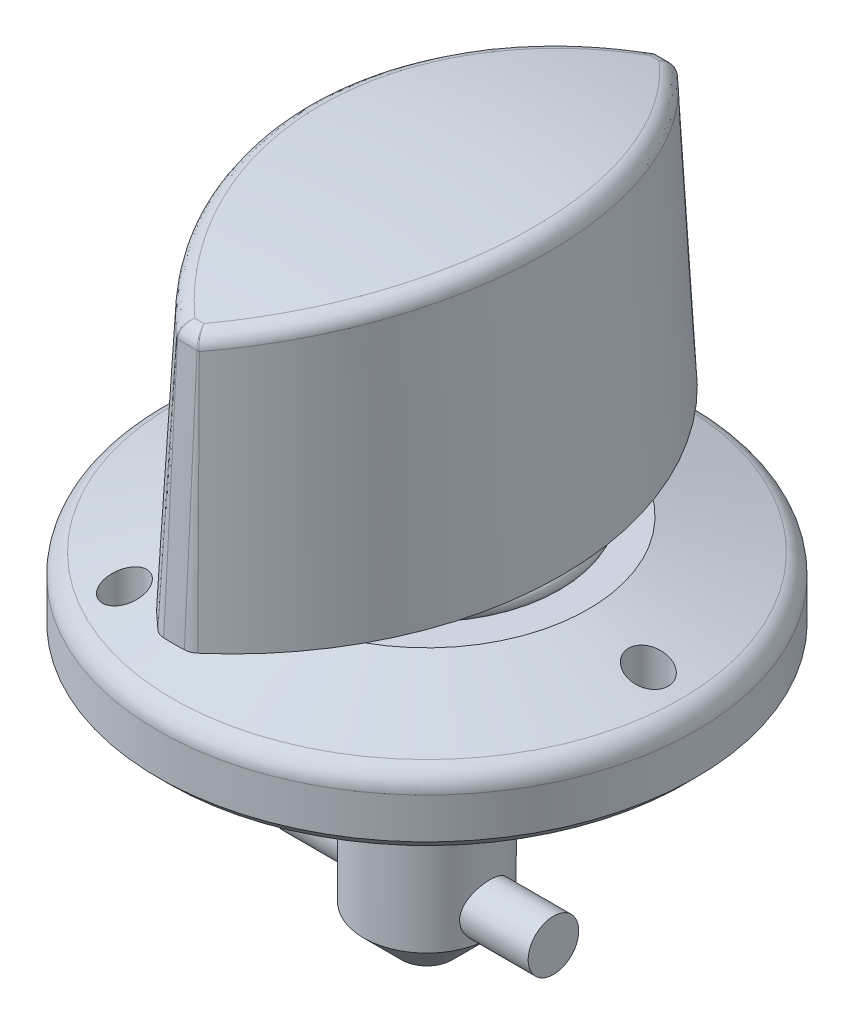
ISO-10303-21;
HEADER;
FILE_DESCRIPTION(('STEP AP214'),'2;1');
FILE_NAME('part.step','',(''),(''),'','','');
FILE_SCHEMA(('AUTOMOTIVE_DESIGN { 1 0 10303 214 1 1 1 1 }'));
ENDSEC;
DATA;
#1=APPLICATION_CONTEXT('core data for automotive mechanical design processes');
#2=APPLICATION_PROTOCOL_DEFINITION('international standard','automotive_design',2000,#1);
#3=PRODUCT_CONTEXT('',#1,'mechanical');
#4=PRODUCT('Part','Part','',(#3));
#5=PRODUCT_RELATED_PRODUCT_CATEGORY('part','',(#4));
#6=PRODUCT_DEFINITION_FORMATION('','',#4);
#7=PRODUCT_DEFINITION_CONTEXT('part definition',#1,'design');
#8=PRODUCT_DEFINITION('design','',#6,#7);
#9=PRODUCT_DEFINITION_SHAPE('','',#8);
#10=(LENGTH_UNIT() NAMED_UNIT(*) SI_UNIT(.MILLI.,.METRE.));
#11=(NAMED_UNIT(*) PLANE_ANGLE_UNIT() SI_UNIT($,.RADIAN.));
#12=(NAMED_UNIT(*) SI_UNIT($,.STERADIAN.) SOLID_ANGLE_UNIT());
#13=UNCERTAINTY_MEASURE_WITH_UNIT(LENGTH_MEASURE(1.E-05),#10,'distance_accuracy_value','');
#14=(GEOMETRIC_REPRESENTATION_CONTEXT(3) GLOBAL_UNCERTAINTY_ASSIGNED_CONTEXT((#13)) GLOBAL_UNIT_ASSIGNED_CONTEXT((#10,
#11,#12)) REPRESENTATION_CONTEXT('',''));
#15=CARTESIAN_POINT('',(0.,0.,0.));
#16=DIRECTION('',(0.,0.,1.));
#17=DIRECTION('',(1.,0.,0.));
#18=AXIS2_PLACEMENT_3D('',#15,#16,#17);
#19=CARTESIAN_POINT('',(0.,-11.5,0.));
#20=DIRECTION('',(0.,-1.,0.));
#21=DIRECTION('',(0.,0.,-1.));
#22=AXIS2_PLACEMENT_3D('',#19,#20,#21);
#23=PLANE('',#22);
#24=CARTESIAN_POINT('',(0.,-11.5,0.));
#25=DIRECTION('',(0.,-1.,0.));
#26=DIRECTION('',(0.,0.,-1.));
#27=AXIS2_PLACEMENT_3D('',#24,#25,#26);
#28=CIRCLE('',#27,1.6);
#29=CARTESIAN_POINT('',(0.,-11.5,-1.6));
#30=VERTEX_POINT('',#29);
#31=EDGE_CURVE('P0_E41',#30,#30,#28,.T.);
#32=ORIENTED_EDGE('',*,*,#31,.T.);
#33=EDGE_LOOP('',(#32));
#34=FACE_BOUND('',#33,.T.);
#35=ADVANCED_FACE('P0_F16',(#34),#23,.T.);
#36=CARTESIAN_POINT('',(0.,-11.5,0.));
#37=DIRECTION('',(0.,1.,0.));
#38=DIRECTION('',(0.,0.,1.));
#39=AXIS2_PLACEMENT_3D('',#36,#37,#38);
#40=CONICAL_SURFACE('',#39,1.6,0.78539816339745);
#41=CARTESIAN_POINT('',(0.,-9.10000000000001,0.));
#42=DIRECTION('',(0.,-1.,0.));
#43=DIRECTION('',(0.,0.,-1.));
#44=AXIS2_PLACEMENT_3D('',#41,#42,#43);
#45=CIRCLE('',#44,4.);
#46=CARTESIAN_POINT('',(4.00000000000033,-9.10000000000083,0.));
#47=VERTEX_POINT('',#46);
#48=CARTESIAN_POINT('',(-4.,-9.10000000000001,0.));
#49=VERTEX_POINT('',#48);
#50=EDGE_CURVE('P0_E34',#47,#49,#45,.T.);
#51=ORIENTED_EDGE('',*,*,#50,.T.);
#52=EDGE_CURVE('P0_E40',#49,#47,#45,.T.);
#53=ORIENTED_EDGE('',*,*,#52,.T.);
#54=EDGE_LOOP('',(#51,#53));
#55=FACE_BOUND('',#54,.T.);
#56=ORIENTED_EDGE('',*,*,#31,.F.);
#57=EDGE_LOOP('',(#56));
#58=FACE_BOUND('',#57,.T.);
#59=ADVANCED_FACE('P0_F38',(#55,#58),#40,.T.);
#60=CARTESIAN_POINT('',(0.,-11.5,0.));
#61=DIRECTION('',(0.,-1.,0.));
#62=DIRECTION('',(0.,0.,-1.));
#63=AXIS2_PLACEMENT_3D('',#60,#61,#62);
#64=CYLINDRICAL_SURFACE('',#63,4.);
#65=CARTESIAN_POINT('',(0.,0.,0.));
#66=DIRECTION('',(0.,-1.,0.));
#67=DIRECTION('',(0.,0.,-1.));
#68=AXIS2_PLACEMENT_3D('',#65,#66,#67);
#69=CIRCLE('',#68,4.);
#70=CARTESIAN_POINT('',(0.,0.,-4.));
#71=VERTEX_POINT('',#70);
#72=EDGE_CURVE('P0_E45',#71,#71,#69,.T.);
#73=ORIENTED_EDGE('',*,*,#72,.T.);
#74=EDGE_LOOP('',(#73));
#75=FACE_BOUND('',#74,.T.);
#76=ORIENTED_EDGE('',*,*,#50,.F.);
#77=CARTESIAN_POINT('',(3.66606055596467,-7.50000000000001,1.6));
#78=CARTESIAN_POINT('',(3.66606921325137,-7.58571159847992,1.59999060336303));
#79=CARTESIAN_POINT('',(3.66910881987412,-7.67154442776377,1.59307185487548));
#80=CARTESIAN_POINT('',(3.68088731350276,-7.84074786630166,1.56565522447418));
#81=CARTESIAN_POINT('',(3.68964076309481,-7.9241116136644,1.5451226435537));
#82=CARTESIAN_POINT('',(3.71168364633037,-8.08564235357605,1.49138802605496));
#83=CARTESIAN_POINT('',(3.72495597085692,-8.16382763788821,1.45823372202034));
#84=CARTESIAN_POINT('',(3.75451732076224,-8.3135080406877,1.38033621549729));
#85=CARTESIAN_POINT('',(3.77080568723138,-8.3850046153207,1.335595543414));
#86=CARTESIAN_POINT('',(3.80560692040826,-8.52340832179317,1.23305757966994));
#87=CARTESIAN_POINT('',(3.82419134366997,-8.58988513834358,1.17470348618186));
#88=CARTESIAN_POINT('',(3.86089965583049,-8.71242319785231,1.04776728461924));
#89=CARTESIAN_POINT('',(3.87902338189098,-8.7684808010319,0.979181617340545));
#90=CARTESIAN_POINT('',(3.91362726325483,-8.87072511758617,0.830405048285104));
#91=CARTESIAN_POINT('',(3.93001442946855,-8.91643544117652,0.749863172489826));
#92=CARTESIAN_POINT('',(3.95843142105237,-8.99347485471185,0.581460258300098));
#93=CARTESIAN_POINT('',(3.97046301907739,-9.02480979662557,0.493602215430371));
#94=CARTESIAN_POINT('',(3.98830660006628,-9.07067318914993,0.317573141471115));
#95=CARTESIAN_POINT('',(3.99439149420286,-9.08594185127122,0.229623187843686));
#96=CARTESIAN_POINT('',(4.00064248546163,-9.10162278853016,0.0522130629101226));
#97=CARTESIAN_POINT('',(4.0008107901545,-9.10204060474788,-0.0372465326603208));
#98=CARTESIAN_POINT('',(3.99537570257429,-9.08841378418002,-0.209785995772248));
#99=CARTESIAN_POINT('',(3.99009597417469,-9.07518018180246,-0.292941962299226));
#100=CARTESIAN_POINT('',(3.97479433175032,-9.0360056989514,-0.455738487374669));
#101=CARTESIAN_POINT('',(3.9647720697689,-9.0100638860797,-0.535378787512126));
#102=CARTESIAN_POINT('',(3.9407745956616,-8.94589081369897,-0.690318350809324));
#103=CARTESIAN_POINT('',(3.9267420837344,-8.90748022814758,-0.765534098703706));
#104=CARTESIAN_POINT('',(3.89611668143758,-8.8196279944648,-0.908646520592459));
#105=CARTESIAN_POINT('',(3.87952291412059,-8.77018256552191,-0.976540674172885));
#106=CARTESIAN_POINT('',(3.84417309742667,-8.65788069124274,-1.10781506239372));
#107=CARTESIAN_POINT('',(3.82534661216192,-8.59435688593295,-1.17060627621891));
#108=CARTESIAN_POINT('',(3.78849328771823,-8.45760754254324,-1.28488593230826));
#109=CARTESIAN_POINT('',(3.77046671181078,-8.38437884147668,-1.33637067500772));
#110=CARTESIAN_POINT('',(3.7367751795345,-8.22766478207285,-1.42792335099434));
#111=CARTESIAN_POINT('',(3.72119131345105,-8.14394813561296,-1.46762772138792));
#112=CARTESIAN_POINT('',(3.69510072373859,-7.9702276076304,-1.53214100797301));
#113=CARTESIAN_POINT('',(3.68459070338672,-7.88022785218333,-1.55695959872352));
#114=CARTESIAN_POINT('',(3.67063807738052,-7.70237137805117,-1.58956395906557));
#115=CARTESIAN_POINT('',(3.6668029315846,-7.61471964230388,-1.59829767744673));
#116=CARTESIAN_POINT('',(3.66551598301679,-7.43913823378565,-1.60124906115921));
#117=CARTESIAN_POINT('',(3.6680622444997,-7.35120865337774,-1.59547112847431));
#118=CARTESIAN_POINT('',(3.67884835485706,-7.18283285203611,-1.57042631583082));
#119=CARTESIAN_POINT('',(3.68675566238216,-7.10224565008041,-1.55194644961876));
#120=CARTESIAN_POINT('',(3.70696040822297,-6.9453692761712,-1.50304334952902));
#121=CARTESIAN_POINT('',(3.71925881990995,-6.86908106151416,-1.47261746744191));
#122=CARTESIAN_POINT('',(3.7474702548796,-6.71951811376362,-1.39930851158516));
#123=CARTESIAN_POINT('',(3.76350963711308,-6.64649104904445,-1.35597029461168));
#124=CARTESIAN_POINT('',(3.7972030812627,-6.50841361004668,-1.2585321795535));
#125=CARTESIAN_POINT('',(3.8148577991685,-6.44336650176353,-1.20442789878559));
#126=CARTESIAN_POINT('',(3.85136732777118,-6.31810127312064,-1.08227536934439));
#127=CARTESIAN_POINT('',(3.87021445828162,-6.25859474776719,-1.01349234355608));
#128=CARTESIAN_POINT('',(3.9057583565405,-6.15185833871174,-0.866466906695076));
#129=CARTESIAN_POINT('',(3.92245503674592,-6.10462895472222,-0.788224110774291));
#130=CARTESIAN_POINT('',(3.95186972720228,-6.02396189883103,-0.624223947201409));
#131=CARTESIAN_POINT('',(3.96458868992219,-5.99052092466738,-0.538468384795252));
#132=CARTESIAN_POINT('',(3.98458170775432,-5.93876091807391,-0.36191487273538));
#133=CARTESIAN_POINT('',(3.99185871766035,-5.92043367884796,-0.271119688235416));
#134=CARTESIAN_POINT('',(3.9998320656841,-5.9003962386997,-0.0934532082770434));
#135=CARTESIAN_POINT('',(4.00092677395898,-5.89767989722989,-0.00671239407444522));
#136=CARTESIAN_POINT('',(3.99748833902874,-5.90628438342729,0.165947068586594));
#137=CARTESIAN_POINT('',(3.9929560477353,-5.91760308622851,0.251865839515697));
#138=CARTESIAN_POINT('',(3.97897210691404,-5.95323743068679,0.417736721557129));
#139=CARTESIAN_POINT('',(3.96967584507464,-5.97714315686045,0.497791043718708));
#140=CARTESIAN_POINT('',(3.9471595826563,-6.03684224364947,0.652737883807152));
#141=CARTESIAN_POINT('',(3.93393885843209,-6.07263779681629,0.72762944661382));
#142=CARTESIAN_POINT('',(3.90414475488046,-6.15688255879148,0.873762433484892));
#143=CARTESIAN_POINT('',(3.88744903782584,-6.20582103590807,0.94469630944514));
#144=CARTESIAN_POINT('',(3.85271522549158,-6.31423081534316,1.07764322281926));
#145=CARTESIAN_POINT('',(3.834676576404,-6.3737064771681,1.1396525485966));
#146=CARTESIAN_POINT('',(3.79790210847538,-6.50585217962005,1.25696101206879));
#147=CARTESIAN_POINT('',(3.77919226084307,-6.57911109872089,1.31160710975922));
#148=CARTESIAN_POINT('',(3.74439737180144,-6.73435370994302,1.40787796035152));
#149=CARTESIAN_POINT('',(3.72831263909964,-6.81633842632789,1.44950118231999));
#150=CARTESIAN_POINT('',(3.70207091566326,-6.97922976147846,1.51519287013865));
#151=CARTESIAN_POINT('',(3.69151134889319,-7.05957218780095,1.54050201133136));
#152=CARTESIAN_POINT('',(3.67556802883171,-7.22358833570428,1.57817420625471));
#153=CARTESIAN_POINT('',(3.6701698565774,-7.30725209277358,1.59057333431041));
#154=CARTESIAN_POINT('',(3.66659567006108,-7.42750204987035,1.59877140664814));
#155=CARTESIAN_POINT('',(3.66605689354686,-7.46374017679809,1.6000039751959));
#156=CARTESIAN_POINT('',(3.66606055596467,-7.50000000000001,1.6));
#157=B_SPLINE_CURVE_WITH_KNOTS('',3,(#77,#78,#79,#80,#81,#82,#83,#84,#85,#86,#87,#88,#89,#90,
#91,#92,#93,#94,#95,#96,#97,#98,#99,#100,#101,#102,#103,#104,#105,#106,#107,#108,#109,#110,#111,
#112,#113,#114,#115,#116,#117,#118,#119,#120,#121,#122,#123,#124,#125,#126,#127,#128,#129,#130,
#131,#132,#133,#134,#135,#136,#137,#138,#139,#140,#141,#142,#143,#144,#145,#146,#147,#148,#149,
#150,#151,#152,#153,#154,#155,#156),.UNSPECIFIED.,.T.,.F.,(4,2,2,2,2,2,2,2,2,2,2,2,2,2,2,2,2,2,
2,2,2,2,2,2,2,2,2,2,2,2,2,2,2,2,2,2,2,2,2,4),(0.,0.257022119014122,0.514701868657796,
0.771416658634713,1.02807543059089,1.2980449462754,1.56810859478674,1.84882135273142,
2.12941973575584,2.39643346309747,2.66334756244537,2.91526915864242,3.16720924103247,
3.42294640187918,3.67877131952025,3.95139235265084,4.22410245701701,4.50451566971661,
4.78474643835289,5.04785718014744,5.3108881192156,5.55893798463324,5.80704286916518,
6.06520923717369,6.32348091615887,6.60082987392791,6.87819011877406,7.15548389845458,
7.43262700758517,7.6916883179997,7.95071041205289,8.2017759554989,8.45288782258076,
8.71509640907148,8.97741373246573,9.25597002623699,9.53455905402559,9.78813328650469,
10.040997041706,10.1497288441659),.UNSPECIFIED.);
#158=EDGE_CURVE('P0_E11',#47,#47,#157,.T.);
#159=ORIENTED_EDGE('',*,*,#158,.F.);
#160=ORIENTED_EDGE('',*,*,#52,.F.);
#161=CARTESIAN_POINT('',(-3.66606055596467,-7.50000000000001,1.6));
#162=CARTESIAN_POINT('',(-3.66606921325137,-7.4142884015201,1.59999060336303));
#163=CARTESIAN_POINT('',(-3.66910881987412,-7.32845557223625,1.59307185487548));
#164=CARTESIAN_POINT('',(-3.68088731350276,-7.15925213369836,1.56565522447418));
#165=CARTESIAN_POINT('',(-3.68964076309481,-7.07588838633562,1.5451226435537));
#166=CARTESIAN_POINT('',(-3.71168364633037,-6.91435764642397,1.49138802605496));
#167=CARTESIAN_POINT('',(-3.72495597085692,-6.8361723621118,1.45823372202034));
#168=CARTESIAN_POINT('',(-3.75451732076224,-6.68649195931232,1.38033621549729));
#169=CARTESIAN_POINT('',(-3.77080568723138,-6.61499538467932,1.335595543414));
#170=CARTESIAN_POINT('',(-3.80560692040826,-6.47659167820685,1.23305757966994));
#171=CARTESIAN_POINT('',(-3.82419134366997,-6.41011486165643,1.17470348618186));
#172=CARTESIAN_POINT('',(-3.86089965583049,-6.28757680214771,1.04776728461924));
#173=CARTESIAN_POINT('',(-3.87902338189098,-6.23151919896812,0.979181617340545));
#174=CARTESIAN_POINT('',(-3.91362726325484,-6.12927488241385,0.830405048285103));
#175=CARTESIAN_POINT('',(-3.93001442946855,-6.08356455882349,0.749863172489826));
#176=CARTESIAN_POINT('',(-3.95843142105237,-6.00652514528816,0.581460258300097));
#177=CARTESIAN_POINT('',(-3.97046301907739,-5.97519020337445,0.49360221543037));
#178=CARTESIAN_POINT('',(-3.98830660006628,-5.92932681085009,0.317573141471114));
#179=CARTESIAN_POINT('',(-3.99439149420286,-5.91405814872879,0.229623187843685));
#180=CARTESIAN_POINT('',(-4.00064248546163,-5.89837721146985,0.052213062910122));
#181=CARTESIAN_POINT('',(-4.0008107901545,-5.89795939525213,-0.0372465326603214));
#182=CARTESIAN_POINT('',(-3.99537570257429,-5.91158621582,-0.209785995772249));
#183=CARTESIAN_POINT('',(-3.99009597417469,-5.92481981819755,-0.292941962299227));
#184=CARTESIAN_POINT('',(-3.97479433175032,-5.96399430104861,-0.45573848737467));
#185=CARTESIAN_POINT('',(-3.9647720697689,-5.98993611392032,-0.535378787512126));
#186=CARTESIAN_POINT('',(-3.9407745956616,-6.05410918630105,-0.690318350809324));
#187=CARTESIAN_POINT('',(-3.9267420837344,-6.09251977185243,-0.765534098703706));
#188=CARTESIAN_POINT('',(-3.89611668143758,-6.18037200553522,-0.908646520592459));
#189=CARTESIAN_POINT('',(-3.87952291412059,-6.22981743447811,-0.976540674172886));
#190=CARTESIAN_POINT('',(-3.84417309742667,-6.34211930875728,-1.10781506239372));
#191=CARTESIAN_POINT('',(-3.82534661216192,-6.40564311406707,-1.17060627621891));
#192=CARTESIAN_POINT('',(-3.78849328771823,-6.54239245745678,-1.28488593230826));
#193=CARTESIAN_POINT('',(-3.77046671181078,-6.61562115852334,-1.33637067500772));
#194=CARTESIAN_POINT('',(-3.7367751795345,-6.77233521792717,-1.42792335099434));
#195=CARTESIAN_POINT('',(-3.72119131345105,-6.85605186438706,-1.46762772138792));
#196=CARTESIAN_POINT('',(-3.69510072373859,-7.02977239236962,-1.53214100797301));
#197=CARTESIAN_POINT('',(-3.68459070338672,-7.11977214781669,-1.55695959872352));
#198=CARTESIAN_POINT('',(-3.67063807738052,-7.29762862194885,-1.58956395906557));
#199=CARTESIAN_POINT('',(-3.66680293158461,-7.38528035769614,-1.59829767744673));
#200=CARTESIAN_POINT('',(-3.66551598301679,-7.56086176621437,-1.60124906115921));
#201=CARTESIAN_POINT('',(-3.6680622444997,-7.64879134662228,-1.59547112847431));
#202=CARTESIAN_POINT('',(-3.67884835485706,-7.81716714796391,-1.57042631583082));
#203=CARTESIAN_POINT('',(-3.68675566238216,-7.89775434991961,-1.55194644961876));
#204=CARTESIAN_POINT('',(-3.70696040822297,-8.05463072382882,-1.50304334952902));
#205=CARTESIAN_POINT('',(-3.71925881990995,-8.13091893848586,-1.47261746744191));
#206=CARTESIAN_POINT('',(-3.7474702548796,-8.2804818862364,-1.39930851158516));
#207=CARTESIAN_POINT('',(-3.76350963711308,-8.35350895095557,-1.35597029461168));
#208=CARTESIAN_POINT('',(-3.7972030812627,-8.49158638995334,-1.2585321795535));
#209=CARTESIAN_POINT('',(-3.8148577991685,-8.55663349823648,-1.20442789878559));
#210=CARTESIAN_POINT('',(-3.85136732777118,-8.68189872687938,-1.08227536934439));
#211=CARTESIAN_POINT('',(-3.87021445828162,-8.74140525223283,-1.01349234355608));
#212=CARTESIAN_POINT('',(-3.9057583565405,-8.84814166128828,-0.866466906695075));
#213=CARTESIAN_POINT('',(-3.92245503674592,-8.8953710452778,-0.788224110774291));
#214=CARTESIAN_POINT('',(-3.95186972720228,-8.97603810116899,-0.624223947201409));
#215=CARTESIAN_POINT('',(-3.96458868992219,-9.00947907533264,-0.538468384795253));
#216=CARTESIAN_POINT('',(-3.98458170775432,-9.06123908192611,-0.36191487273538));
#217=CARTESIAN_POINT('',(-3.99185871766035,-9.07956632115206,-0.271119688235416));
#218=CARTESIAN_POINT('',(-3.9998320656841,-9.09960376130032,-0.0934532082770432));
#219=CARTESIAN_POINT('',(-4.00092677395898,-9.10232010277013,-0.00671239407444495));
#220=CARTESIAN_POINT('',(-3.99748833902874,-9.09371561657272,0.165947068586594));
#221=CARTESIAN_POINT('',(-3.9929560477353,-9.08239691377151,0.251865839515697));
#222=CARTESIAN_POINT('',(-3.97897210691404,-9.04676256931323,0.417736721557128));
#223=CARTESIAN_POINT('',(-3.96967584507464,-9.02285684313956,0.497791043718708));
#224=CARTESIAN_POINT('',(-3.9471595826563,-8.96315775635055,0.652737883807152));
#225=CARTESIAN_POINT('',(-3.93393885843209,-8.92736220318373,0.72762944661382));
#226=CARTESIAN_POINT('',(-3.90414475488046,-8.84311744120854,0.873762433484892));
#227=CARTESIAN_POINT('',(-3.88744903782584,-8.79417896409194,0.94469630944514));
#228=CARTESIAN_POINT('',(-3.85271522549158,-8.68576918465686,1.07764322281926));
#229=CARTESIAN_POINT('',(-3.834676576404,-8.62629352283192,1.1396525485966));
#230=CARTESIAN_POINT('',(-3.79790210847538,-8.49414782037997,1.25696101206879));
#231=CARTESIAN_POINT('',(-3.77919226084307,-8.42088890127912,1.31160710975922));
#232=CARTESIAN_POINT('',(-3.74439737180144,-8.26564629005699,1.40787796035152));
#233=CARTESIAN_POINT('',(-3.72831263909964,-8.18366157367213,1.44950118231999));
#234=CARTESIAN_POINT('',(-3.70207091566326,-8.02077023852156,1.51519287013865));
#235=CARTESIAN_POINT('',(-3.69151134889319,-7.94042781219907,1.54050201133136));
#236=CARTESIAN_POINT('',(-3.67556802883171,-7.77641166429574,1.57817420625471));
#237=CARTESIAN_POINT('',(-3.6701698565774,-7.69274790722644,1.59057333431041));
#238=CARTESIAN_POINT('',(-3.66659567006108,-7.57249795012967,1.59877140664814));
#239=CARTESIAN_POINT('',(-3.66605689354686,-7.53625982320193,1.6000039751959));
#240=CARTESIAN_POINT('',(-3.66606055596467,-7.50000000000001,1.6));
#241=B_SPLINE_CURVE_WITH_KNOTS('',3,(#161,#162,#163,#164,#165,#166,#167,#168,#169,#170,#171,
#172,#173,#174,#175,#176,#177,#178,#179,#180,#181,#182,#183,#184,#185,#186,#187,#188,#189,#190,
#191,#192,#193,#194,#195,#196,#197,#198,#199,#200,#201,#202,#203,#204,#205,#206,#207,#208,#209,
#210,#211,#212,#213,#214,#215,#216,#217,#218,#219,#220,#221,#222,#223,#224,#225,#226,#227,#228,
#229,#230,#231,#232,#233,#234,#235,#236,#237,#238,#239,#240),.UNSPECIFIED.,.T.,.F.,(4,2,2,2,2,2,
2,2,2,2,2,2,2,2,2,2,2,2,2,2,2,2,2,2,2,2,2,2,2,2,2,2,2,2,2,2,2,2,2,4),(0.,0.257022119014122,
0.514701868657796,0.771416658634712,1.02807543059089,1.2980449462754,1.56810859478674,
1.84882135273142,2.12941973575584,2.39643346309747,2.66334756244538,2.91526915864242,
3.16720924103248,3.42294640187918,3.67877131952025,3.95139235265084,4.22410245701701,
4.50451566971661,4.78474643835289,5.04785718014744,5.31088811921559,5.55893798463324,
5.80704286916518,6.06520923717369,6.32348091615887,6.60082987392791,6.87819011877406,
7.15548389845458,7.43262700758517,7.6916883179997,7.95071041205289,8.2017759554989,
8.45288782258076,8.71509640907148,8.97741373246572,9.25597002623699,9.53455905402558,
9.78813328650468,10.040997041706,10.1497288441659),.UNSPECIFIED.);
#242=EDGE_CURVE('P0_E27',#49,#49,#241,.T.);
#243=ORIENTED_EDGE('',*,*,#242,.F.);
#244=EDGE_LOOP('',(#76,#159,#160,#243));
#245=FACE_BOUND('',#244,.T.);
#246=ADVANCED_FACE('P0_F43',(#75,#245),#64,.T.);
#247=CARTESIAN_POINT('',(4.,0.,0.));
#248=DIRECTION('',(0.,1.,0.));
#249=DIRECTION('',(0.,0.,1.));
#250=AXIS2_PLACEMENT_3D('',#247,#248,#249);
#251=PLANE('',#250);
#252=CARTESIAN_POINT('',(0.,0.,0.));
#253=DIRECTION('',(0.,-1.,0.));
#254=DIRECTION('',(0.,0.,-1.));
#255=AXIS2_PLACEMENT_3D('',#252,#253,#254);
#256=CIRCLE('',#255,3.2);
#257=CARTESIAN_POINT('',(0.,0.,-3.2));
#258=VERTEX_POINT('',#257);
#259=EDGE_CURVE('P0_E47',#258,#258,#256,.T.);
#260=ORIENTED_EDGE('',*,*,#259,.T.);
#261=EDGE_LOOP('',(#260));
#262=FACE_BOUND('',#261,.T.);
#263=ORIENTED_EDGE('',*,*,#72,.F.);
#264=EDGE_LOOP('',(#263));
#265=FACE_BOUND('',#264,.T.);
#266=ADVANCED_FACE('P0_F79',(#262,#265),#251,.T.);
#267=CARTESIAN_POINT('',(0.,-11.5,0.));
#268=DIRECTION('',(0.,-1.,0.));
#269=DIRECTION('',(0.,0.,-1.));
#270=AXIS2_PLACEMENT_3D('',#267,#268,#269);
#271=CYLINDRICAL_SURFACE('',#270,3.2);
#272=CARTESIAN_POINT('',(0.,20.2,0.));
#273=DIRECTION('',(0.,-1.,0.));
#274=DIRECTION('',(0.,0.,-1.));
#275=AXIS2_PLACEMENT_3D('',#272,#273,#274);
#276=CIRCLE('',#275,3.2);
#277=CARTESIAN_POINT('',(0.,20.2,-3.2));
#278=VERTEX_POINT('',#277);
#279=EDGE_CURVE('P0_E155',#278,#278,#276,.T.);
#280=ORIENTED_EDGE('',*,*,#279,.T.);
#281=EDGE_LOOP('',(#280));
#282=FACE_BOUND('',#281,.T.);
#283=ORIENTED_EDGE('',*,*,#259,.F.);
#284=EDGE_LOOP('',(#283));
#285=FACE_BOUND('',#284,.T.);
#286=ADVANCED_FACE('P0_F76',(#282,#285),#271,.T.);
#287=CARTESIAN_POINT('',(0.,20.2,0.));
#288=DIRECTION('',(0.,-1.,0.));
#289=DIRECTION('',(0.,0.,-1.));
#290=AXIS2_PLACEMENT_3D('',#287,#288,#289);
#291=CONICAL_SURFACE('',#290,3.2,0.785398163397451);
#292=CARTESIAN_POINT('',(0.,21.,0.));
#293=DIRECTION('',(0.,-1.,0.));
#294=DIRECTION('',(0.,0.,-1.));
#295=AXIS2_PLACEMENT_3D('',#292,#293,#294);
#296=CIRCLE('',#295,2.4);
#297=CARTESIAN_POINT('',(0.,21.,-2.4));
#298=VERTEX_POINT('',#297);
#299=EDGE_CURVE('P0_E150',#298,#298,#296,.T.);
#300=ORIENTED_EDGE('',*,*,#299,.T.);
#301=EDGE_LOOP('',(#300));
#302=FACE_BOUND('',#301,.T.);
#303=ORIENTED_EDGE('',*,*,#279,.F.);
#304=EDGE_LOOP('',(#303));
#305=FACE_BOUND('',#304,.T.);
#306=ADVANCED_FACE('P0_F72',(#302,#305),#291,.T.);
#307=CARTESIAN_POINT('',(2.4,21.,0.));
#308=DIRECTION('',(0.,1.,0.));
#309=DIRECTION('',(0.,0.,1.));
#310=AXIS2_PLACEMENT_3D('',#307,#308,#309);
#311=PLANE('',#310);
#312=ORIENTED_EDGE('',*,*,#299,.F.);
#313=EDGE_LOOP('',(#312));
#314=FACE_BOUND('',#313,.T.);
#315=ADVANCED_FACE('P0_F68',(#314),#311,.T.);
#316=CARTESIAN_POINT('',(-8.,-7.50000000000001,0.));
#317=DIRECTION('',(-1.,0.,0.));
#318=DIRECTION('',(0.,0.,1.));
#319=AXIS2_PLACEMENT_3D('',#316,#317,#318);
#320=PLANE('',#319);
#321=CARTESIAN_POINT('',(-8.,-7.50000000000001,0.));
#322=DIRECTION('',(-1.,0.,0.));
#323=DIRECTION('',(0.,0.,1.));
#324=AXIS2_PLACEMENT_3D('',#321,#322,#323);
#325=CIRCLE('',#324,1.6);
#326=CARTESIAN_POINT('',(-8.,-7.50000000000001,1.6));
#327=VERTEX_POINT('',#326);
#328=EDGE_CURVE('P0_E147',#327,#327,#325,.T.);
#329=ORIENTED_EDGE('',*,*,#328,.T.);
#330=EDGE_LOOP('',(#329));
#331=FACE_BOUND('',#330,.T.);
#332=ADVANCED_FACE('P0_F62',(#331),#320,.T.);
#333=CARTESIAN_POINT('',(-5.26029262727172,-7.50000000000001,0.));
#334=DIRECTION('',(-1.,0.,0.));
#335=DIRECTION('',(0.,0.,1.));
#336=AXIS2_PLACEMENT_3D('',#333,#334,#335);
#337=CYLINDRICAL_SURFACE('',#336,1.6);
#338=ORIENTED_EDGE('',*,*,#242,.T.);
#339=EDGE_LOOP('',(#338));
#340=FACE_BOUND('',#339,.T.);
#341=ORIENTED_EDGE('',*,*,#328,.F.);
#342=EDGE_LOOP('',(#341));
#343=FACE_BOUND('',#342,.T.);
#344=ADVANCED_FACE('P0_F56',(#340,#343),#337,.T.);
#345=ORIENTED_EDGE('',*,*,#158,.T.);
#346=EDGE_LOOP('',(#345));
#347=FACE_BOUND('',#346,.T.);
#348=CARTESIAN_POINT('',(8.,-7.50000000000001,0.));
#349=DIRECTION('',(-1.,0.,0.));
#350=DIRECTION('',(0.,0.,1.));
#351=AXIS2_PLACEMENT_3D('',#348,#349,#350);
#352=CIRCLE('',#351,1.6);
#353=CARTESIAN_POINT('',(8.,-7.50000000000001,1.6));
#354=VERTEX_POINT('',#353);
#355=EDGE_CURVE('P0_E145',#354,#354,#352,.T.);
#356=ORIENTED_EDGE('',*,*,#355,.T.);
#357=EDGE_LOOP('',(#356));
#358=FACE_BOUND('',#357,.T.);
#359=ADVANCED_FACE('P0_F61',(#347,#358),#337,.T.);
#360=CARTESIAN_POINT('',(8.,-9.10000000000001,0.));
#361=DIRECTION('',(1.,0.,0.));
#362=DIRECTION('',(0.,0.,-1.));
#363=AXIS2_PLACEMENT_3D('',#360,#361,#362);
#364=PLANE('',#363);
#365=ORIENTED_EDGE('',*,*,#355,.F.);
#366=EDGE_LOOP('',(#365));
#367=FACE_BOUND('',#366,.T.);
#368=ADVANCED_FACE('P0_F64',(#367),#364,.T.);
#369=CLOSED_SHELL('',(#35,#59,#246,#266,#286,#306,#315,#332,#344,#359,#368));
#370=MANIFOLD_SOLID_BREP('P0_B1',#369);
#371=CARTESIAN_POINT('',(16.,13.,0.));
#372=DIRECTION('',(0.,-1.,0.));
#373=DIRECTION('',(0.,0.,-1.));
#374=AXIS2_PLACEMENT_3D('',#371,#372,#373);
#375=PLANE('',#374);
#376=CARTESIAN_POINT('',(0.,13.,0.));
#377=DIRECTION('',(0.,-1.,0.));
#378=DIRECTION('',(0.,0.,-1.));
#379=AXIS2_PLACEMENT_3D('',#376,#377,#378);
#380=CIRCLE('',#379,3.2);
#381=CARTESIAN_POINT('',(0.,13.,-3.2));
#382=VERTEX_POINT('',#381);
#383=EDGE_CURVE('P1_E678',#382,#382,#380,.T.);
#384=ORIENTED_EDGE('',*,*,#383,.F.);
#385=EDGE_LOOP('',(#384));
#386=FACE_BOUND('',#385,.T.);
#387=CARTESIAN_POINT('',(-12.25,13.,0.));
#388=DIRECTION('',(0.,-1.,0.));
#389=DIRECTION('',(0.,0.,1.));
#390=AXIS2_PLACEMENT_3D('',#387,#388,#389);
#391=CIRCLE('',#390,20.75);
#392=CARTESIAN_POINT('',(1.26349780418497,13.,-15.7463607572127));
#393=VERTEX_POINT('',#392);
#394=CARTESIAN_POINT('',(1.26349780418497,13.,15.7463607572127));
#395=VERTEX_POINT('',#394);
#396=EDGE_CURVE('P1_E758',#393,#395,#391,.T.);
#397=ORIENTED_EDGE('',*,*,#396,.T.);
#398=CARTESIAN_POINT('',(0.612244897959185,13.,14.987499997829));
#399=DIRECTION('',(0.,-1.,0.));
#400=DIRECTION('',(0.,0.,-1.));
#401=AXIS2_PLACEMENT_3D('',#398,#399,#400);
#402=CIRCLE('',#401,1.);
#403=CARTESIAN_POINT('',(0.653061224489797,13.,15.9866666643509));
#404=VERTEX_POINT('',#403);
#405=EDGE_CURVE('P1_E76',#395,#404,#402,.T.);
#406=ORIENTED_EDGE('',*,*,#405,.T.);
#407=CARTESIAN_POINT('',(0.,13.,0.));
#408=DIRECTION('',(0.,-1.,0.));
#409=DIRECTION('',(0.,0.,-1.));
#410=AXIS2_PLACEMENT_3D('',#407,#408,#409);
#411=CIRCLE('',#410,16.);
#412=CARTESIAN_POINT('',(-0.653061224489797,13.,15.9866666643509));
#413=VERTEX_POINT('',#412);
#414=EDGE_CURVE('P1_E691',#404,#413,#411,.T.);
#415=ORIENTED_EDGE('',*,*,#414,.T.);
#416=CARTESIAN_POINT('',(-0.612244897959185,13.,14.987499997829));
#417=DIRECTION('',(0.,-1.,0.));
#418=DIRECTION('',(0.,0.,-1.));
#419=AXIS2_PLACEMENT_3D('',#416,#417,#418);
#420=CIRCLE('',#419,1.);
#421=CARTESIAN_POINT('',(-1.26349780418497,13.,15.7463607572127));
#422=VERTEX_POINT('',#421);
#423=EDGE_CURVE('P1_E686',#413,#422,#420,.T.);
#424=ORIENTED_EDGE('',*,*,#423,.T.);
#425=CARTESIAN_POINT('',(12.25,13.,0.));
#426=DIRECTION('',(0.,-1.,0.));
#427=DIRECTION('',(0.,0.,-1.));
#428=AXIS2_PLACEMENT_3D('',#425,#426,#427);
#429=CIRCLE('',#428,20.75);
#430=CARTESIAN_POINT('',(-1.26349780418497,13.,-15.7463607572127));
#431=VERTEX_POINT('',#430);
#432=EDGE_CURVE('P1_E697',#422,#431,#429,.T.);
#433=ORIENTED_EDGE('',*,*,#432,.T.);
#434=CARTESIAN_POINT('',(-0.612244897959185,13.,-14.987499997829));
#435=DIRECTION('',(0.,-1.,0.));
#436=DIRECTION('',(0.,0.,-1.));
#437=AXIS2_PLACEMENT_3D('',#434,#435,#436);
#438=CIRCLE('',#437,1.);
#439=CARTESIAN_POINT('',(-0.653061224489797,13.,-15.9866666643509));
#440=VERTEX_POINT('',#439);
#441=EDGE_CURVE('P1_E705',#431,#440,#438,.T.);
#442=ORIENTED_EDGE('',*,*,#441,.T.);
#443=CARTESIAN_POINT('',(0.653061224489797,13.,-15.9866666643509));
#444=VERTEX_POINT('',#443);
#445=EDGE_CURVE('P1_E603',#440,#444,#411,.T.);
#446=ORIENTED_EDGE('',*,*,#445,.T.);
#447=CARTESIAN_POINT('',(0.612244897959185,13.,-14.987499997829));
#448=DIRECTION('',(0.,-1.,0.));
#449=DIRECTION('',(0.,0.,-1.));
#450=AXIS2_PLACEMENT_3D('',#447,#448,#449);
#451=CIRCLE('',#450,1.);
#452=EDGE_CURVE('P1_E689',#444,#393,#451,.T.);
#453=ORIENTED_EDGE('',*,*,#452,.T.);
#454=EDGE_LOOP('',(#397,#406,#415,#424,#433,#442,#446,#453));
#455=FACE_BOUND('',#454,.T.);
#456=ADVANCED_FACE('P1_F16',(#386,#455),#375,.T.);
#457=CARTESIAN_POINT('',(0.,-33.5,0.));
#458=DIRECTION('',(0.,-1.,0.));
#459=DIRECTION('',(1.,0.,0.));
#460=AXIS2_PLACEMENT_3D('',#457,#458,#459);
#461=SPHERICAL_SURFACE('',#460,65.);
#462=CARTESIAN_POINT('',(-5.10421366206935,27.8074796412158,18.6520060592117));
#463=CARTESIAN_POINT('',(-5.24866664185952,28.5451372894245,18.6659485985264));
#464=CARTESIAN_POINT('',(-5.54681385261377,28.7122553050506,17.9963370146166));
#465=CARTESIAN_POINT('',(-4.57486236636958,27.9096902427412,18.4435329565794));
#466=CARTESIAN_POINT('',(-4.71701201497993,28.6519582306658,18.4605970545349));
#467=CARTESIAN_POINT('',(-5.03616784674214,28.8160629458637,17.7949381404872));
#468=CARTESIAN_POINT('',(-4.05404665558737,28.0099841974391,18.2122852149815));
#469=CARTESIAN_POINT('',(-4.1947495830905,28.7566088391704,18.2326905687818));
#470=CARTESIAN_POINT('',(-4.53377758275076,28.9179239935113,17.5715786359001));
#471=CARTESIAN_POINT('',(-3.03315632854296,28.2061029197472,17.7059112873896));
#472=CARTESIAN_POINT('',(-3.17024869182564,28.9613978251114,17.7327210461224));
#473=CARTESIAN_POINT('',(-3.54904319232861,29.1171070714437,17.082555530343));
#474=CARTESIAN_POINT('',(-2.53308321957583,28.3019273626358,17.4307819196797));
#475=CARTESIAN_POINT('',(-2.66815687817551,29.0615048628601,17.4605151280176));
#476=CARTESIAN_POINT('',(-3.06670052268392,29.2144287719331,16.8168888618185));
#477=CARTESIAN_POINT('',(-1.55750599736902,28.4884408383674,16.8383949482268));
#478=CARTESIAN_POINT('',(-1.68790463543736,29.2564971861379,16.8736006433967));
#479=CARTESIAN_POINT('',(-2.12574835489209,29.4038565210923,16.2449452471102));
#480=CARTESIAN_POINT('',(-1.08199786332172,28.5791307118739,16.5211442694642));
#481=CARTESIAN_POINT('',(-1.2099098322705,29.3513478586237,16.5587859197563));
#482=CARTESIAN_POINT('',(-1.66713497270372,29.4959634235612,15.9386749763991));
#483=CARTESIAN_POINT('',(-0.159053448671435,28.7547816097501,15.8465904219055));
#484=CARTESIAN_POINT('',(-0.281417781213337,29.5351969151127,15.8886098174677));
#485=CARTESIAN_POINT('',(-0.777013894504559,29.6743588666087,15.2875305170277));
#486=CARTESIAN_POINT('',(0.288384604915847,28.8397429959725,15.4892897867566));
#487=CARTESIAN_POINT('',(0.168891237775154,29.6241565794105,15.533169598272));
#488=CARTESIAN_POINT('',(-0.3455044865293,29.7606477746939,14.9426587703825));
#489=CARTESIAN_POINT('',(1.14046059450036,29.001220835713,14.7468895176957));
#490=CARTESIAN_POINT('',(1.02706898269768,29.7933555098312,14.7938898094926));
#491=CARTESIAN_POINT('',(0.476211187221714,29.9246487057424,14.2261393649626));
#492=CARTESIAN_POINT('',(1.54591327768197,29.0779003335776,14.3627647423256));
#493=CARTESIAN_POINT('',(1.43558637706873,29.873730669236,14.410964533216));
#494=CARTESIAN_POINT('',(0.867203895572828,30.0025263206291,13.8554311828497));
#495=CARTESIAN_POINT('',(2.32398737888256,29.2247932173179,13.5612922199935));
#496=CARTESIAN_POINT('',(2.22013748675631,30.0278174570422,13.611252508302));
#497=CARTESIAN_POINT('',(1.61750718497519,30.1517144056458,13.0820014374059));
#498=CARTESIAN_POINT('',(2.69660889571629,29.2950066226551,13.1439445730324));
#499=CARTESIAN_POINT('',(2.59597383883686,30.1014894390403,13.1944582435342));
#500=CARTESIAN_POINT('',(1.97681786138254,30.2230248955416,12.6792799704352));
#501=CARTESIAN_POINT('',(3.40605894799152,29.428479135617,12.2789921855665));
#502=CARTESIAN_POINT('',(3.31208196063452,30.2416392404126,12.3299201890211));
#503=CARTESIAN_POINT('',(2.66090696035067,30.3585829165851,11.8446849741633));
#504=CARTESIAN_POINT('',(3.74290289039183,29.4917412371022,11.8314006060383));
#505=CARTESIAN_POINT('',(3.65217012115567,30.3080805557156,11.8822179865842));
#506=CARTESIAN_POINT('',(2.98570024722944,30.4228334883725,11.4128241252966));
#507=CARTESIAN_POINT('',(4.37840410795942,29.6109286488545,10.9088387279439));
#508=CARTESIAN_POINT('',(4.29426283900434,30.4333474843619,10.9587110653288));
#509=CARTESIAN_POINT('',(3.59845214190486,30.5438832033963,10.5227259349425));
#510=CARTESIAN_POINT('',(4.67706147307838,29.6668539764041,10.4338684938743));
#511=CARTESIAN_POINT('',(4.59607249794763,30.492134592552,10.4829717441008));
#512=CARTESIAN_POINT('',(3.88641083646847,30.6006823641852,10.0644886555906));
#513=CARTESIAN_POINT('',(5.23408641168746,29.771036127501,9.45945111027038));
#514=CARTESIAN_POINT('',(5.15937553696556,30.6017238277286,9.50628457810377));
#515=CARTESIAN_POINT('',(4.42347102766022,30.706492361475,9.12443464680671));
#516=CARTESIAN_POINT('',(5.49242198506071,29.8192868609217,8.95998492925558));
#517=CARTESIAN_POINT('',(5.4206519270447,30.652483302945,9.00541939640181));
#518=CARTESIAN_POINT('',(4.67254166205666,30.755497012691,8.64259958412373));
#519=CARTESIAN_POINT('',(5.96647366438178,29.9077404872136,7.94045065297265));
#520=CARTESIAN_POINT('',(5.90042264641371,30.7455973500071,7.98237670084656));
#521=CARTESIAN_POINT('',(5.12958438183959,30.8453327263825,7.65908485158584));
#522=CARTESIAN_POINT('',(6.18219018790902,29.9479434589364,7.42038275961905));
#523=CARTESIAN_POINT('',(6.11875030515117,30.7879193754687,7.46033457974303));
#524=CARTESIAN_POINT('',(5.33755686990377,30.8861638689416,7.15740537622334));
#525=CARTESIAN_POINT('',(6.56931685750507,30.0200355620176,6.36326042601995));
#526=CARTESIAN_POINT('',(6.51080920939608,30.8638582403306,6.39860014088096));
#527=CARTESIAN_POINT('',(5.7107811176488,30.9593824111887,6.13768512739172));
#528=CARTESIAN_POINT('',(6.74071821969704,30.0519230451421,5.82620264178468));
#529=CARTESIAN_POINT('',(6.6843879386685,30.8974454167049,5.8590699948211));
#530=CARTESIAN_POINT('',(5.87602440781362,30.9917681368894,5.61964113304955));
#531=CARTESIAN_POINT('',(7.03776833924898,30.1071545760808,4.73909771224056));
#532=CARTESIAN_POINT('',(6.98538482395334,30.9556539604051,4.76643009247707));
#533=CARTESIAN_POINT('',(6.16239941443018,31.0478626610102,4.57104262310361));
#534=CARTESIAN_POINT('',(7.16341757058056,30.1304987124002,4.18905070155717));
#535=CARTESIAN_POINT('',(7.11268882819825,30.9802532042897,4.21351132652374));
#536=CARTESIAN_POINT('',(6.28353158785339,31.0715715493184,4.04048823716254));
#537=CARTESIAN_POINT('',(7.36669231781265,30.1682511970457,3.08675735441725));
#538=CARTESIAN_POINT('',(7.31874558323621,31.0200555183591,3.1050239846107));
#539=CARTESIAN_POINT('',(6.47949747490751,31.1099139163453,2.97727107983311));
#540=CARTESIAN_POINT('',(7.4448843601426,30.1827649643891,2.53461948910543));
#541=CARTESIAN_POINT('',(7.3979932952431,31.0353543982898,2.54976796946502));
#542=CARTESIAN_POINT('',(6.55487736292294,31.1246544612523,2.44471277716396));
#543=CARTESIAN_POINT('',(7.55499874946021,30.2032010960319,1.42557298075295));
#544=CARTESIAN_POINT('',(7.50964335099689,31.0569054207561,1.43411637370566));
#545=CARTESIAN_POINT('',(6.66103126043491,31.1454099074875,1.37500152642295));
#546=CARTESIAN_POINT('',(7.58692146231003,30.209123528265,0.868664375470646));
#547=CARTESIAN_POINT('',(7.54200264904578,31.0631492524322,0.87393543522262));
#548=CARTESIAN_POINT('',(6.69180562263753,31.1514248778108,0.837848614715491));
#549=CARTESIAN_POINT('',(7.6042389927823,30.2123365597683,-0.245779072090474));
#550=CARTESIAN_POINT('',(7.55956348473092,31.0665379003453,-0.24729590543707));
#551=CARTESIAN_POINT('',(6.7085002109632,31.1546881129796,-0.237060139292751));
#552=CARTESIAN_POINT('',(7.58964416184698,30.209629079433,-0.803313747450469));
#553=CARTESIAN_POINT('',(7.54476863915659,31.0636834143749,-0.808126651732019));
#554=CARTESIAN_POINT('',(6.69443041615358,31.1519383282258,-0.77481582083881));
#555=CARTESIAN_POINT('',(7.51406673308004,30.1956048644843,-1.91510520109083));
#556=CARTESIAN_POINT('',(7.46813295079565,31.0488933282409,-1.92662115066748));
#557=CARTESIAN_POINT('',(6.62157147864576,31.1376949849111,-1.8471703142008));
#558=CARTESIAN_POINT('',(7.45308437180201,30.1842881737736,-2.46936199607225));
#559=CARTESIAN_POINT('',(7.40632224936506,31.0369635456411,-2.48406777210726));
#560=CARTESIAN_POINT('',(6.56278256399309,31.1262014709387,-2.38176914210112));
#561=CARTESIAN_POINT('',(7.28581302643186,30.1532320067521,-3.56673144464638));
#562=CARTESIAN_POINT('',(7.23674147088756,31.0042174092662,-3.5877725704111));
#563=CARTESIAN_POINT('',(6.4015264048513,31.0946600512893,-3.44022833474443));
#564=CARTESIAN_POINT('',(7.17984554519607,30.1335522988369,-4.10989504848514));
#565=CARTESIAN_POINT('',(7.12936227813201,30.9834766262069,-4.13387501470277));
#566=CARTESIAN_POINT('',(6.29936910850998,31.0746728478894,-3.96413776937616));
#567=CARTESIAN_POINT('',(6.92349119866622,30.085910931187,-5.1852203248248));
#568=CARTESIAN_POINT('',(6.86955723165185,30.9332591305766,-5.21492265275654));
#569=CARTESIAN_POINT('',(6.05222943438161,31.0262870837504,-5.00136044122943));
#570=CARTESIAN_POINT('',(6.77310418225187,30.057949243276,-5.71738195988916));
#571=CARTESIAN_POINT('',(6.71722753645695,30.9038010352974,-5.74968002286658));
#572=CARTESIAN_POINT('',(5.90724691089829,30.9978884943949,-5.51467364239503));
#573=CARTESIAN_POINT('',(6.42898973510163,29.9939109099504,-6.76726908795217));
#574=CARTESIAN_POINT('',(6.368646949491,30.8363305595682,-6.80448315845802));
#575=CARTESIAN_POINT('',(5.57549405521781,30.9328495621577,-6.52739612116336));
#576=CARTESIAN_POINT('',(6.23523786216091,29.9578296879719,-7.28498625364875));
#577=CARTESIAN_POINT('',(6.17249620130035,30.7983376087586,-7.3243542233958));
#578=CARTESIAN_POINT('',(5.38870015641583,30.8962045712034,-7.02679737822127));
#579=CARTESIAN_POINT('',(5.80595159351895,29.8777999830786,-8.30206356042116));
#580=CARTESIAN_POINT('',(5.73790080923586,30.7140672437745,-8.34535441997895));
#581=CARTESIAN_POINT('',(4.97482282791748,30.8149244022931,-8.00791810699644));
#582=CARTESIAN_POINT('',(5.57041857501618,29.8338517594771,-8.80142430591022));
#583=CARTESIAN_POINT('',(5.49960668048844,30.6678191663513,-8.84634373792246));
#584=CARTESIAN_POINT('',(4.74774072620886,30.7702894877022,-8.48963816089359));
#585=CARTESIAN_POINT('',(5.05789892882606,29.7380990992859,-9.78120502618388));
#586=CARTESIAN_POINT('',(4.98112625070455,30.5670627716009,-9.8289075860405));
#587=CARTESIAN_POINT('',(4.2535997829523,30.6730406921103,-9.43483703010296));
#588=CARTESIAN_POINT('',(4.78068145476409,29.6862508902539,-10.2614994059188));
#589=CARTESIAN_POINT('',(4.70087375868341,30.5125411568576,-10.3102477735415));
#590=CARTESIAN_POINT('',(3.98631831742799,30.6203823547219,-9.8981948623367));
#591=CARTESIAN_POINT('',(4.18792128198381,29.5752244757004,-11.1968079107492));
#592=CARTESIAN_POINT('',(4.10171500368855,30.395804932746,-11.2470945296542));
#593=CARTESIAN_POINT('',(3.41478988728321,30.5076211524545,-10.8005566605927));
#594=CARTESIAN_POINT('',(3.87237930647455,29.5160464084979,-11.651822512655));
#595=CARTESIAN_POINT('',(3.78299340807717,30.3336266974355,-11.7025226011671));
#596=CARTESIAN_POINT('',(3.11054362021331,30.4475184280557,-11.2395610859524));
#597=CARTESIAN_POINT('',(3.20601083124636,29.3908682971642,-12.532665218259));
#598=CARTESIAN_POINT('',(3.1100539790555,30.2021270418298,-12.5835895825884));
#599=CARTESIAN_POINT('',(2.46801218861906,30.3203844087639,-12.0894491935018));
#600=CARTESIAN_POINT('',(2.85525359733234,29.3248816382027,-12.9585479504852));
#601=CARTESIAN_POINT('',(2.75609744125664,30.1328576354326,-13.0092381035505));
#602=CARTESIAN_POINT('',(2.12979384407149,30.2533667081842,-12.5003855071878));
#603=CARTESIAN_POINT('',(2.12066176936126,29.1864367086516,-13.7791461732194));
#604=CARTESIAN_POINT('',(2.0150062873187,29.9875605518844,-13.828740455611));
#605=CARTESIAN_POINT('',(1.42144111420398,30.1127585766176,-13.292227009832));
#606=CARTESIAN_POINT('',(1.73684741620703,29.113982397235,-14.173880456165));
#607=CARTESIAN_POINT('',(1.62808348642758,29.9115753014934,-14.2226028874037));
#608=CARTESIAN_POINT('',(1.05132625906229,30.0391721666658,-13.673150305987));
#609=CARTESIAN_POINT('',(1.2368713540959,29.019415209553,-14.6475273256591));
#610=CARTESIAN_POINT('',(1.12362683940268,29.8123116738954,-14.6953171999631));
#611=CARTESIAN_POINT('',(0.569180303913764,29.9431273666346,-14.1302537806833));
#612=CARTESIAN_POINT('',(1.13480325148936,29.0001005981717,-14.7422203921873));
#613=CARTESIAN_POINT('',(1.02078148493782,29.7920647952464,-14.789689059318));
#614=CARTESIAN_POINT('',(0.470751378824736,29.9235109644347,-14.2216409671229));
#615=CARTESIAN_POINT('',(0.928829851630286,28.9611046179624,-14.9293613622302));
#616=CARTESIAN_POINT('',(0.813266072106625,29.7511915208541,-14.9761476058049));
#617=CARTESIAN_POINT('',(0.272120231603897,29.8839056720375,-14.4022516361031));
#618=CARTESIAN_POINT('',(0.82492578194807,28.9414234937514,-15.0218106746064));
#619=CARTESIAN_POINT('',(0.708600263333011,29.7305659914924,-15.0682362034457));
#620=CARTESIAN_POINT('',(0.171919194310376,29.8639170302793,-14.4914764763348));
#621=CARTESIAN_POINT('',(0.290633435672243,28.8401691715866,-15.4873275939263));
#622=CARTESIAN_POINT('',(0.171148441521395,29.6246016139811,-15.5312228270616));
#623=CARTESIAN_POINT('',(-0.343335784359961,29.7610806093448,-14.940764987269));
#624=CARTESIAN_POINT('',(-0.154555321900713,28.7556357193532,-15.842995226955));
#625=CARTESIAN_POINT('',(-0.27689884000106,29.5360896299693,-15.8850397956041));
#626=CARTESIAN_POINT('',(-0.772675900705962,29.675226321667,-15.2840603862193));
#627=CARTESIAN_POINT('',(-1.07300173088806,28.5808447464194,-16.5148726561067));
#628=CARTESIAN_POINT('',(-1.20086956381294,29.3531399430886,-16.552563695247));
#629=CARTESIAN_POINT('',(-1.658458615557,29.4977042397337,-15.9326207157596));
#630=CARTESIAN_POINT('',(-1.54628210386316,28.4905825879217,-16.8310498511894));
#631=CARTESIAN_POINT('',(-1.67662982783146,29.2587356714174,-16.8663190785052));
#632=CARTESIAN_POINT('',(-2.11492315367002,29.4060317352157,-16.2378542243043));
#633=CARTESIAN_POINT('',(-2.52175302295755,28.304097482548,-17.4244218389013));
#634=CARTESIAN_POINT('',(-2.65676976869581,29.0637741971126,-17.4542162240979));
#635=CARTESIAN_POINT('',(-3.05577212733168,29.2166328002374,-16.8107476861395));
#636=CARTESIAN_POINT('',(-3.02417412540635,28.2078263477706,-17.7012208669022));
#637=CARTESIAN_POINT('',(-3.16122245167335,28.9631998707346,-17.7280807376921));
#638=CARTESIAN_POINT('',(-3.54037927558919,29.1188574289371,-17.078026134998));
#639=CARTESIAN_POINT('',(-4.0496138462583,28.010837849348,-18.2103189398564));
#640=CARTESIAN_POINT('',(-4.19029529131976,28.7575014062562,-18.2307485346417));
#641=CARTESIAN_POINT('',(-4.5295015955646,28.918790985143,-17.5696794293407));
#642=CARTESIAN_POINT('',(-4.57261580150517,27.9101240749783,-18.4426531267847));
#643=CARTESIAN_POINT('',(-4.71475047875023,28.6524126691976,-18.4597280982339));
#644=CARTESIAN_POINT('',(-5.0340006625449,28.816503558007,-17.7940881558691));
#645=CARTESIAN_POINT('',(-5.10421366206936,27.8074796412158,-18.6520060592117));
#646=CARTESIAN_POINT('',(-5.24866664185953,28.5451372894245,-18.6659485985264));
#647=CARTESIAN_POINT('',(-5.54681385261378,28.7122553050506,-17.9963370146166));
#648=(BOUNDED_SURFACE() B_SPLINE_SURFACE(3,2,((#462,#463,#464),(#465,#466,#467),(#468,#469,
#470),(#471,#472,#473),(#474,#475,#476),(#477,#478,#479),(#480,#481,#482),(#483,#484,#485),
(#486,#487,#488),(#489,#490,#491),(#492,#493,#494),(#495,#496,#497),(#498,#499,#500),(#501,#502,
#503),(#504,#505,#506),(#507,#508,#509),(#510,#511,#512),(#513,#514,#515),(#516,#517,#518),
(#519,#520,#521),(#522,#523,#524),(#525,#526,#527),(#528,#529,#530),(#531,#532,#533),(#534,#535,
#536),(#537,#538,#539),(#540,#541,#542),(#543,#544,#545),(#546,#547,#548),(#549,#550,#551),
(#552,#553,#554),(#555,#556,#557),(#558,#559,#560),(#561,#562,#563),(#564,#565,#566),(#567,#568,
#569),(#570,#571,#572),(#573,#574,#575),(#576,#577,#578),(#579,#580,#581),(#582,#583,#584),
(#585,#586,#587),(#588,#589,#590),(#591,#592,#593),(#594,#595,#596),(#597,#598,#599),(#600,#601,
#602),(#603,#604,#605),(#606,#607,#608),(#609,#610,#611),(#612,#613,#614),(#615,#616,#617),
(#618,#619,#620),(#621,#622,#623),(#624,#625,#626),(#627,#628,#629),(#630,#631,#632),(#633,#634,
#635),(#636,#637,#638),(#639,#640,#641),(#642,#643,#644),(#645,#646,#647)),.UNSPECIFIED.,.F.,
.F.,.F.) B_SPLINE_SURFACE_WITH_KNOTS((4,2,2,2,2,2,2,2,2,2,2,2,2,2,2,2,2,2,2,2,2,2,2,2,2,2,2,2,2,
2,4),(3,3),(0.,1.64971648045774,3.29955263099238,4.94911787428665,6.59857882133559,
8.20477925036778,9.81097484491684,11.4164759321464,13.0219732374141,14.6287382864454,
16.2354875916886,17.8425551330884,19.4496060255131,21.0370745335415,22.6245304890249,
24.2116332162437,25.7987278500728,27.3746657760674,28.9506090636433,30.5274428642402,
32.1042246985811,33.6900842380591,35.2759138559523,36.8586832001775,38.4404902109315,
38.8414210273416,39.2420932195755,40.8833118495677,42.5258765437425,44.1839322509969,
45.8406720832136),(0.,1.),
.UNSPECIFIED.) GEOMETRIC_REPRESENTATION_ITEM() RATIONAL_B_SPLINE_SURFACE(((1.,0.799309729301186,
1.),(1.,0.797719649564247,1.),(1.,0.796149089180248,1.),(1.,0.793059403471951,1.),(1.,
0.791540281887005,1.),(1.,0.788566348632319,1.),(1.,0.787111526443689,1.),(1.,0.784278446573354,
1.),(1.,0.782900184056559,1.),(1.,0.780267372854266,1.),(1.,0.77901052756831,1.),(1.,
0.776591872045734,1.),(1.,0.77543006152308,1.),(1.,0.773212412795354,1.),(1.,0.772156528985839,
1.),(1.,0.770159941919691,1.),(1.,0.769219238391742,1.),(1.,0.767461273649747,1.),(1.,
0.766644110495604,1.),(1.,0.765142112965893,1.),(1.,0.764457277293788,1.),(1.,0.763226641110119,
1.),(1.,0.762680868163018,1.),(1.,0.761734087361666,1.),(1.,0.761333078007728,1.),(1.,
0.760683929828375,1.),(1.,0.760433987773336,1.),(1.,0.760081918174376,1.),(1.,0.759979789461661,
1.),(1.,0.759924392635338,1.),(1.,0.759971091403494,1.),(1.,0.760212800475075,1.),(1.,
0.760407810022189,1.),(1.,0.760942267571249,1.),(1.,0.761280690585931,1.),(1.,0.762098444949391,
1.),(1.,0.762577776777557,1.),(1.,0.763672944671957,1.),(1.,0.764288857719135,1.),(1.,
0.765651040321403,1.),(1.,0.766397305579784,1.),(1.,0.768017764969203,1.),(1.,0.768892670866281,
1.),(1.,0.770758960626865,1.),(1.,0.771750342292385,1.),(1.,0.773838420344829,1.),(1.,
0.774934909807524,1.),(1.,0.777224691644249,1.),(1.,0.778417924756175,1.),(1.,0.77996751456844,
1.),(1.,0.780283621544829,1.),(1.,0.780921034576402,1.),(1.,0.781242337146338,1.),(1.,
0.782893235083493,1.),(1.,0.784264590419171,1.),(1.,0.787083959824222,1.),(1.,0.788532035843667,
1.),(1.,0.79150583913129,1.),(1.,0.793032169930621,1.),(1.,0.796135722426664,1.),(1.,
0.797712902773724,1.),(1.,0.799309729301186,1.))) REPRESENTATION_ITEM('') SURFACE());
#649=CARTESIAN_POINT('',(-5.54681385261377,28.7122553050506,17.9963370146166));
#650=CARTESIAN_POINT('',(-5.03616784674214,28.8160629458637,17.7949381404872));
#651=CARTESIAN_POINT('',(-4.53377758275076,28.9179239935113,17.5715786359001));
#652=CARTESIAN_POINT('',(-3.54904319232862,29.1171070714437,17.082555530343));
#653=CARTESIAN_POINT('',(-3.06670052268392,29.2144287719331,16.8168888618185));
#654=CARTESIAN_POINT('',(-2.12574835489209,29.4038565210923,16.2449452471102));
#655=CARTESIAN_POINT('',(-1.66713497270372,29.4959634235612,15.9386749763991));
#656=CARTESIAN_POINT('',(-0.777013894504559,29.6743588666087,15.2875305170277));
#657=CARTESIAN_POINT('',(-0.3455044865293,29.7606477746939,14.9426587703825));
#658=CARTESIAN_POINT('',(0.476211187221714,29.9246487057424,14.2261393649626));
#659=CARTESIAN_POINT('',(0.867203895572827,30.0025263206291,13.8554311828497));
#660=CARTESIAN_POINT('',(1.61750718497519,30.1517144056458,13.0820014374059));
#661=CARTESIAN_POINT('',(1.97681786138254,30.2230248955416,12.6792799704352));
#662=CARTESIAN_POINT('',(2.66090696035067,30.3585829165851,11.8446849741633));
#663=CARTESIAN_POINT('',(2.98570024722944,30.4228334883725,11.4128241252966));
#664=CARTESIAN_POINT('',(3.59845214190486,30.5438832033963,10.5227259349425));
#665=CARTESIAN_POINT('',(3.88641083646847,30.6006823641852,10.0644886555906));
#666=CARTESIAN_POINT('',(4.42347102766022,30.706492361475,9.12443464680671));
#667=CARTESIAN_POINT('',(4.67254166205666,30.755497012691,8.64259958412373));
#668=CARTESIAN_POINT('',(5.12958438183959,30.8453327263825,7.65908485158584));
#669=CARTESIAN_POINT('',(5.33755686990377,30.8861638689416,7.15740537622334));
#670=CARTESIAN_POINT('',(5.7107811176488,30.9593824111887,6.13768512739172));
#671=CARTESIAN_POINT('',(5.87602440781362,30.9917681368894,5.61964113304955));
#672=CARTESIAN_POINT('',(6.16239941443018,31.0478626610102,4.57104262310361));
#673=CARTESIAN_POINT('',(6.28353158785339,31.0715715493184,4.04048823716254));
#674=CARTESIAN_POINT('',(6.47949747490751,31.1099139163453,2.97727107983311));
#675=CARTESIAN_POINT('',(6.55487736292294,31.1246544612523,2.44471277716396));
#676=CARTESIAN_POINT('',(6.66103126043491,31.1454099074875,1.37500152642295));
#677=CARTESIAN_POINT('',(6.69180562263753,31.1514248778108,0.837848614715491));
#678=CARTESIAN_POINT('',(6.7085002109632,31.1546881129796,-0.23706013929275));
#679=CARTESIAN_POINT('',(6.69443041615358,31.1519383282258,-0.77481582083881));
#680=CARTESIAN_POINT('',(6.62157147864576,31.1376949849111,-1.8471703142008));
#681=CARTESIAN_POINT('',(6.56278256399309,31.1262014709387,-2.38176914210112));
#682=CARTESIAN_POINT('',(6.4015264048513,31.0946600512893,-3.44022833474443));
#683=CARTESIAN_POINT('',(6.29936910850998,31.0746728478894,-3.96413776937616));
#684=CARTESIAN_POINT('',(6.05222943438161,31.0262870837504,-5.00136044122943));
#685=CARTESIAN_POINT('',(5.90724691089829,30.9978884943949,-5.51467364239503));
#686=CARTESIAN_POINT('',(5.57549405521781,30.9328495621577,-6.52739612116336));
#687=CARTESIAN_POINT('',(5.38870015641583,30.8962045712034,-7.02679737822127));
#688=CARTESIAN_POINT('',(4.97482282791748,30.8149244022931,-8.00791810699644));
#689=CARTESIAN_POINT('',(4.74774072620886,30.7702894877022,-8.48963816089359));
#690=CARTESIAN_POINT('',(4.2535997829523,30.6730406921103,-9.43483703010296));
#691=CARTESIAN_POINT('',(3.98631831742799,30.6203823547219,-9.8981948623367));
#692=CARTESIAN_POINT('',(3.41478988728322,30.5076211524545,-10.8005566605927));
#693=CARTESIAN_POINT('',(3.1105436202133,30.4475184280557,-11.2395610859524));
#694=CARTESIAN_POINT('',(2.46801218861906,30.3203844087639,-12.0894491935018));
#695=CARTESIAN_POINT('',(2.12979384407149,30.2533667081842,-12.5003855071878));
#696=CARTESIAN_POINT('',(1.42144111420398,30.1127585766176,-13.292227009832));
#697=CARTESIAN_POINT('',(1.05132625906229,30.0391721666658,-13.673150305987));
#698=CARTESIAN_POINT('',(0.569180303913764,29.9431273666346,-14.1302537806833));
#699=CARTESIAN_POINT('',(0.470751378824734,29.9235109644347,-14.2216409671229));
#700=CARTESIAN_POINT('',(0.272120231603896,29.8839056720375,-14.4022516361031));
#701=CARTESIAN_POINT('',(0.171919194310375,29.8639170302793,-14.4914764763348));
#702=CARTESIAN_POINT('',(-0.343335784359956,29.7610806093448,-14.940764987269));
#703=CARTESIAN_POINT('',(-0.77267590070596,29.675226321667,-15.2840603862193));
#704=CARTESIAN_POINT('',(-1.65845861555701,29.4977042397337,-15.9326207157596));
#705=CARTESIAN_POINT('',(-2.11492315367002,29.4060317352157,-16.2378542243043));
#706=CARTESIAN_POINT('',(-3.05577212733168,29.2166328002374,-16.8107476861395));
#707=CARTESIAN_POINT('',(-3.54037927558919,29.1188574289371,-17.078026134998));
#708=CARTESIAN_POINT('',(-4.5295015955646,28.918790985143,-17.5696794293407));
#709=CARTESIAN_POINT('',(-5.0340006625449,28.816503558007,-17.7940881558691));
#710=CARTESIAN_POINT('',(-5.54681385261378,28.7122553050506,-17.9963370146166));
#711=B_SPLINE_CURVE_WITH_KNOTS('',3,(#649,#650,#651,#652,#653,#654,#655,#656,#657,#658,#659,
#660,#661,#662,#663,#664,#665,#666,#667,#668,#669,#670,#671,#672,#673,#674,#675,#676,#677,#678,
#679,#680,#681,#682,#683,#684,#685,#686,#687,#688,#689,#690,#691,#692,#693,#694,#695,#696,#697,
#698,#699,#700,#701,#702,#703,#704,#705,#706,#707,#708,#709,#710),.UNSPECIFIED.,.F.,.F.,(4,2,2,
2,2,2,2,2,2,2,2,2,2,2,2,2,2,2,2,2,2,2,2,2,2,2,2,2,2,2,4),(0.,1.64971648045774,3.29955263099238,
4.94911787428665,6.59857882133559,8.20477925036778,9.81097484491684,11.4164759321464,
13.0219732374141,14.6287382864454,16.2354875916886,17.8425551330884,19.4496060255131,
21.0370745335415,22.6245304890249,24.2116332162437,25.7987278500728,27.3746657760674,
28.9506090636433,30.5274428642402,32.1042246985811,33.6900842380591,35.2759138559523,
36.8586832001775,38.4404902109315,38.8414210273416,39.2420932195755,40.8833118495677,
42.5258765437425,44.1839322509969,45.8406720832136),.UNSPECIFIED.);
#712=CARTESIAN_POINT('',(0.292847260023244,29.8880364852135,14.3830132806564));
#713=VERTEX_POINT('',#712);
#714=CARTESIAN_POINT('',(0.292847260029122,29.8880364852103,-14.3830132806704));
#715=VERTEX_POINT('',#714);
#716=EDGE_CURVE('P1_E283',#713,#715,#711,.T.);
#717=ORIENTED_EDGE('',*,*,#716,.T.);
#718=CARTESIAN_POINT('',(0.,29.8880364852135,0.));
#719=DIRECTION('',(0.,-1.,0.));
#720=DIRECTION('',(0.,0.,-1.));
#721=AXIS2_PLACEMENT_3D('',#718,#719,#720);
#722=CIRCLE('',#721,14.3859942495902);
#723=CARTESIAN_POINT('',(-0.29284726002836,29.8880364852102,-14.3830132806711));
#724=VERTEX_POINT('',#723);
#725=EDGE_CURVE('P1_E274',#715,#724,#722,.F.);
#726=ORIENTED_EDGE('',*,*,#725,.T.);
#727=CARTESIAN_POINT('',(5.10421366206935,27.8074796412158,-18.6520060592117));
#728=CARTESIAN_POINT('',(5.24866664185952,28.5451372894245,-18.6659485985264));
#729=CARTESIAN_POINT('',(5.54681385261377,28.7122553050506,-17.9963370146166));
#730=CARTESIAN_POINT('',(4.57486236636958,27.9096902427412,-18.4435329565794));
#731=CARTESIAN_POINT('',(4.71701201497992,28.6519582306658,-18.4605970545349));
#732=CARTESIAN_POINT('',(5.03616784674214,28.8160629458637,-17.7949381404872));
#733=CARTESIAN_POINT('',(4.05404665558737,28.0099841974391,-18.2122852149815));
#734=CARTESIAN_POINT('',(4.1947495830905,28.7566088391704,-18.2326905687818));
#735=CARTESIAN_POINT('',(4.53377758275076,28.9179239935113,-17.5715786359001));
#736=CARTESIAN_POINT('',(3.03315632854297,28.2061029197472,-17.7059112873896));
#737=CARTESIAN_POINT('',(3.17024869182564,28.9613978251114,-17.7327210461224));
#738=CARTESIAN_POINT('',(3.54904319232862,29.1171070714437,-17.082555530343));
#739=CARTESIAN_POINT('',(2.53308321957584,28.3019273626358,-17.4307819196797));
#740=CARTESIAN_POINT('',(2.66815687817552,29.0615048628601,-17.4605151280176));
#741=CARTESIAN_POINT('',(3.06670052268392,29.2144287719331,-16.8168888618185));
#742=CARTESIAN_POINT('',(1.55750599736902,28.4884408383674,-16.8383949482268));
#743=CARTESIAN_POINT('',(1.68790463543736,29.2564971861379,-16.8736006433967));
#744=CARTESIAN_POINT('',(2.12574835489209,29.4038565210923,-16.2449452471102));
#745=CARTESIAN_POINT('',(1.08199786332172,28.5791307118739,-16.5211442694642));
#746=CARTESIAN_POINT('',(1.2099098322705,29.3513478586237,-16.5587859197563));
#747=CARTESIAN_POINT('',(1.66713497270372,29.4959634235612,-15.9386749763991));
#748=CARTESIAN_POINT('',(0.159053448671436,28.7547816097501,-15.8465904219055));
#749=CARTESIAN_POINT('',(0.281417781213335,29.5351969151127,-15.8886098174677));
#750=CARTESIAN_POINT('',(0.777013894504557,29.6743588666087,-15.2875305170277));
#751=CARTESIAN_POINT('',(-0.288384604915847,28.8397429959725,-15.4892897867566));
#752=CARTESIAN_POINT('',(-0.168891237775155,29.6241565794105,-15.533169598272));
#753=CARTESIAN_POINT('',(0.345504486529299,29.7606477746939,-14.9426587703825));
#754=CARTESIAN_POINT('',(-1.14046059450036,29.001220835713,-14.7468895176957));
#755=CARTESIAN_POINT('',(-1.02706898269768,29.7933555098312,-14.7938898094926));
#756=CARTESIAN_POINT('',(-0.476211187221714,29.9246487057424,-14.2261393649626));
#757=CARTESIAN_POINT('',(-1.54591327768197,29.0779003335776,-14.3627647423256));
#758=CARTESIAN_POINT('',(-1.43558637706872,29.8737306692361,-14.410964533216));
#759=CARTESIAN_POINT('',(-0.867203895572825,30.0025263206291,-13.8554311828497));
#760=CARTESIAN_POINT('',(-2.32398737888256,29.2247932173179,-13.5612922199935));
#761=CARTESIAN_POINT('',(-2.22013748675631,30.0278174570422,-13.611252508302));
#762=CARTESIAN_POINT('',(-1.61750718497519,30.1517144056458,-13.0820014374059));
#763=CARTESIAN_POINT('',(-2.69660889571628,29.2950066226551,-13.1439445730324));
#764=CARTESIAN_POINT('',(-2.59597383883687,30.1014894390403,-13.1944582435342));
#765=CARTESIAN_POINT('',(-1.97681786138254,30.2230248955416,-12.6792799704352));
#766=CARTESIAN_POINT('',(-3.40605894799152,29.428479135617,-12.2789921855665));
#767=CARTESIAN_POINT('',(-3.31208196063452,30.2416392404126,-12.3299201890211));
#768=CARTESIAN_POINT('',(-2.66090696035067,30.3585829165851,-11.8446849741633));
#769=CARTESIAN_POINT('',(-3.74290289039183,29.4917412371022,-11.8314006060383));
#770=CARTESIAN_POINT('',(-3.65217012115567,30.3080805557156,-11.8822179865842));
#771=CARTESIAN_POINT('',(-2.98570024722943,30.4228334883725,-11.4128241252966));
#772=CARTESIAN_POINT('',(-4.37840410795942,29.6109286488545,-10.9088387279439));
#773=CARTESIAN_POINT('',(-4.29426283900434,30.4333474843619,-10.9587110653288));
#774=CARTESIAN_POINT('',(-3.59845214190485,30.5438832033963,-10.5227259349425));
#775=CARTESIAN_POINT('',(-4.67706147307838,29.6668539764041,-10.4338684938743));
#776=CARTESIAN_POINT('',(-4.59607249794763,30.492134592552,-10.4829717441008));
#777=CARTESIAN_POINT('',(-3.88641083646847,30.6006823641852,-10.0644886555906));
#778=CARTESIAN_POINT('',(-5.23408641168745,29.771036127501,-9.45945111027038));
#779=CARTESIAN_POINT('',(-5.15937553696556,30.6017238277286,-9.50628457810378));
#780=CARTESIAN_POINT('',(-4.42347102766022,30.7064923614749,-9.12443464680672));
#781=CARTESIAN_POINT('',(-5.4924219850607,29.8192868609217,-8.95998492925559));
#782=CARTESIAN_POINT('',(-5.4206519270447,30.652483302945,-9.00541939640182));
#783=CARTESIAN_POINT('',(-4.67254166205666,30.755497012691,-8.64259958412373));
#784=CARTESIAN_POINT('',(-5.96647366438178,29.9077404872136,-7.94045065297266));
#785=CARTESIAN_POINT('',(-5.90042264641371,30.7455973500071,-7.98237670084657));
#786=CARTESIAN_POINT('',(-5.12958438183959,30.8453327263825,-7.65908485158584));
#787=CARTESIAN_POINT('',(-6.18219018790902,29.9479434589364,-7.42038275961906));
#788=CARTESIAN_POINT('',(-6.11875030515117,30.7879193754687,-7.46033457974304));
#789=CARTESIAN_POINT('',(-5.33755686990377,30.8861638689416,-7.15740537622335));
#790=CARTESIAN_POINT('',(-6.56931685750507,30.0200355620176,-6.36326042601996));
#791=CARTESIAN_POINT('',(-6.51080920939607,30.8638582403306,-6.39860014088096));
#792=CARTESIAN_POINT('',(-5.7107811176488,30.9593824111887,-6.13768512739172));
#793=CARTESIAN_POINT('',(-6.74071821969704,30.0519230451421,-5.82620264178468));
#794=CARTESIAN_POINT('',(-6.68438793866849,30.8974454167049,-5.85906999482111));
#795=CARTESIAN_POINT('',(-5.87602440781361,30.9917681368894,-5.61964113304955));
#796=CARTESIAN_POINT('',(-7.03776833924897,30.1071545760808,-4.73909771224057));
#797=CARTESIAN_POINT('',(-6.98538482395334,30.9556539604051,-4.76643009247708));
#798=CARTESIAN_POINT('',(-6.16239941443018,31.0478626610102,-4.57104262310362));
#799=CARTESIAN_POINT('',(-7.16341757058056,30.1304987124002,-4.18905070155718));
#800=CARTESIAN_POINT('',(-7.11268882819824,30.9802532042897,-4.21351132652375));
#801=CARTESIAN_POINT('',(-6.28353158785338,31.0715715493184,-4.04048823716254));
#802=CARTESIAN_POINT('',(-7.36669231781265,30.1682511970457,-3.08675735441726));
#803=CARTESIAN_POINT('',(-7.31874558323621,31.020055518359,-3.10502398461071));
#804=CARTESIAN_POINT('',(-6.47949747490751,31.1099139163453,-2.97727107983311));
#805=CARTESIAN_POINT('',(-7.44488436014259,30.182764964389,-2.53461948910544));
#806=CARTESIAN_POINT('',(-7.39799329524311,31.0353543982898,-2.54976796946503));
#807=CARTESIAN_POINT('',(-6.55487736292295,31.1246544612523,-2.44471277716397));
#808=CARTESIAN_POINT('',(-7.5549987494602,30.2032010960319,-1.42557298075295));
#809=CARTESIAN_POINT('',(-7.5096433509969,31.056905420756,-1.43411637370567));
#810=CARTESIAN_POINT('',(-6.66103126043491,31.1454099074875,-1.37500152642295));
#811=CARTESIAN_POINT('',(-7.58692146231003,30.209123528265,-0.868664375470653));
#812=CARTESIAN_POINT('',(-7.54200264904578,31.0631492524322,-0.873935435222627));
#813=CARTESIAN_POINT('',(-6.69180562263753,31.1514248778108,-0.837848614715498));
#814=CARTESIAN_POINT('',(-7.6042389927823,30.2123365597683,0.245779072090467));
#815=CARTESIAN_POINT('',(-7.55956348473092,31.0665379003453,0.247295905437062));
#816=CARTESIAN_POINT('',(-6.7085002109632,31.1546881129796,0.237060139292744));
#817=CARTESIAN_POINT('',(-7.58964416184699,30.209629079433,0.803313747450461));
#818=CARTESIAN_POINT('',(-7.54476863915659,31.0636834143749,0.808126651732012));
#819=CARTESIAN_POINT('',(-6.69443041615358,31.1519383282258,0.774815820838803));
#820=CARTESIAN_POINT('',(-7.51406673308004,30.1956048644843,1.91510520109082));
#821=CARTESIAN_POINT('',(-7.46813295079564,31.0488933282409,1.92662115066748));
#822=CARTESIAN_POINT('',(-6.62157147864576,31.1376949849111,1.84717031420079));
#823=CARTESIAN_POINT('',(-7.45308437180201,30.1842881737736,2.46936199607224));
#824=CARTESIAN_POINT('',(-7.40632224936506,31.0369635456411,2.48406777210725));
#825=CARTESIAN_POINT('',(-6.56278256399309,31.1262014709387,2.38176914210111));
#826=CARTESIAN_POINT('',(-7.28581302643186,30.1532320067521,3.56673144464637));
#827=CARTESIAN_POINT('',(-7.23674147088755,31.0042174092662,3.5877725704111));
#828=CARTESIAN_POINT('',(-6.4015264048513,31.0946600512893,3.44022833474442));
#829=CARTESIAN_POINT('',(-7.17984554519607,30.1335522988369,4.10989504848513));
#830=CARTESIAN_POINT('',(-7.12936227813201,30.9834766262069,4.13387501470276));
#831=CARTESIAN_POINT('',(-6.29936910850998,31.0746728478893,3.96413776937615));
#832=CARTESIAN_POINT('',(-6.92349119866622,30.085910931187,5.18522032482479));
#833=CARTESIAN_POINT('',(-6.86955723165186,30.9332591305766,5.21492265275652));
#834=CARTESIAN_POINT('',(-6.05222943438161,31.0262870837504,5.00136044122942));
#835=CARTESIAN_POINT('',(-6.77310418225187,30.057949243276,5.71738195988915));
#836=CARTESIAN_POINT('',(-6.71722753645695,30.9038010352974,5.74968002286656));
#837=CARTESIAN_POINT('',(-5.90724691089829,30.9978884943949,5.51467364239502));
#838=CARTESIAN_POINT('',(-6.42898973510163,29.9939109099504,6.76726908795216));
#839=CARTESIAN_POINT('',(-6.36864694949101,30.8363305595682,6.80448315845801));
#840=CARTESIAN_POINT('',(-5.57549405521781,30.9328495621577,6.52739612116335));
#841=CARTESIAN_POINT('',(-6.23523786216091,29.9578296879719,7.28498625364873));
#842=CARTESIAN_POINT('',(-6.17249620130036,30.7983376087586,7.32435422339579));
#843=CARTESIAN_POINT('',(-5.38870015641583,30.8962045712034,7.02679737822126));
#844=CARTESIAN_POINT('',(-5.80595159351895,29.8777999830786,8.30206356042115));
#845=CARTESIAN_POINT('',(-5.73790080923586,30.7140672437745,8.34535441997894));
#846=CARTESIAN_POINT('',(-4.97482282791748,30.8149244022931,8.00791810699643));
#847=CARTESIAN_POINT('',(-5.57041857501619,29.8338517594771,8.80142430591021));
#848=CARTESIAN_POINT('',(-5.49960668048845,30.6678191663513,8.84634373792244));
#849=CARTESIAN_POINT('',(-4.74774072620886,30.7702894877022,8.48963816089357));
#850=CARTESIAN_POINT('',(-5.05789892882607,29.7380990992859,9.78120502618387));
#851=CARTESIAN_POINT('',(-4.98112625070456,30.5670627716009,9.8289075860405));
#852=CARTESIAN_POINT('',(-4.2535997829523,30.6730406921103,9.43483703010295));
#853=CARTESIAN_POINT('',(-4.78068145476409,29.6862508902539,10.2614994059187));
#854=CARTESIAN_POINT('',(-4.70087375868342,30.5125411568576,10.3102477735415));
#855=CARTESIAN_POINT('',(-3.986318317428,30.6203823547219,9.89819486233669));
#856=CARTESIAN_POINT('',(-4.18792128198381,29.5752244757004,11.1968079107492));
#857=CARTESIAN_POINT('',(-4.10171500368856,30.395804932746,11.2470945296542));
#858=CARTESIAN_POINT('',(-3.41478988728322,30.5076211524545,10.8005566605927));
#859=CARTESIAN_POINT('',(-3.87237930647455,29.5160464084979,11.651822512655));
#860=CARTESIAN_POINT('',(-3.78299340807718,30.3336266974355,11.7025226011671));
#861=CARTESIAN_POINT('',(-3.11054362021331,30.4475184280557,11.2395610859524));
#862=CARTESIAN_POINT('',(-3.20601083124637,29.3908682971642,12.532665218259));
#863=CARTESIAN_POINT('',(-3.1100539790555,30.2021270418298,12.5835895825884));
#864=CARTESIAN_POINT('',(-2.46801218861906,30.3203844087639,12.0894491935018));
#865=CARTESIAN_POINT('',(-2.85525359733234,29.3248816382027,12.9585479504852));
#866=CARTESIAN_POINT('',(-2.75609744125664,30.1328576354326,13.0092381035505));
#867=CARTESIAN_POINT('',(-2.12979384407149,30.2533667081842,12.5003855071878));
#868=CARTESIAN_POINT('',(-2.12066176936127,29.1864367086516,13.7791461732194));
#869=CARTESIAN_POINT('',(-2.01500628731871,29.9875605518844,13.828740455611));
#870=CARTESIAN_POINT('',(-1.42144111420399,30.1127585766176,13.292227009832));
#871=CARTESIAN_POINT('',(-1.73684741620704,29.113982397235,14.173880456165));
#872=CARTESIAN_POINT('',(-1.6280834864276,29.9115753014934,14.2226028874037));
#873=CARTESIAN_POINT('',(-1.0513262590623,30.0391721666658,13.673150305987));
#874=CARTESIAN_POINT('',(-1.23687135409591,29.019415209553,14.6475273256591));
#875=CARTESIAN_POINT('',(-1.12362683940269,29.8123116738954,14.6953171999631));
#876=CARTESIAN_POINT('',(-0.569180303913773,29.9431273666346,14.1302537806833));
#877=CARTESIAN_POINT('',(-1.13480325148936,29.0001005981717,14.7422203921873));
#878=CARTESIAN_POINT('',(-1.02078148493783,29.7920647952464,14.789689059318));
#879=CARTESIAN_POINT('',(-0.470751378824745,29.9235109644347,14.2216409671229));
#880=CARTESIAN_POINT('',(-0.928829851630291,28.9611046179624,14.9293613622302));
#881=CARTESIAN_POINT('',(-0.813266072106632,29.751191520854,14.9761476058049));
#882=CARTESIAN_POINT('',(-0.272120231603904,29.8839056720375,14.4022516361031));
#883=CARTESIAN_POINT('',(-0.824925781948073,28.9414234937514,15.0218106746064));
#884=CARTESIAN_POINT('',(-0.708600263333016,29.7305659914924,15.0682362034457));
#885=CARTESIAN_POINT('',(-0.171919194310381,29.8639170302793,14.4914764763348));
#886=CARTESIAN_POINT('',(-0.290633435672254,28.8401691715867,15.4873275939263));
#887=CARTESIAN_POINT('',(-0.171148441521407,29.6246016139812,15.5312228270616));
#888=CARTESIAN_POINT('',(0.343335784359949,29.7610806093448,14.940764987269));
#889=CARTESIAN_POINT('',(0.1545553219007,28.7556357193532,15.842995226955));
#890=CARTESIAN_POINT('',(0.276898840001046,29.5360896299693,15.8850397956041));
#891=CARTESIAN_POINT('',(0.772675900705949,29.675226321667,15.2840603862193));
#892=CARTESIAN_POINT('',(1.07300173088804,28.5808447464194,16.5148726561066));
#893=CARTESIAN_POINT('',(1.20086956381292,29.3531399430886,16.552563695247));
#894=CARTESIAN_POINT('',(1.65845861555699,29.4977042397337,15.9326207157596));
#895=CARTESIAN_POINT('',(1.54628210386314,28.4905825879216,16.8310498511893));
#896=CARTESIAN_POINT('',(1.67662982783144,29.2587356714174,16.8663190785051));
#897=CARTESIAN_POINT('',(2.11492315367,29.4060317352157,16.2378542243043));
#898=CARTESIAN_POINT('',(2.52175302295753,28.304097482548,17.4244218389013));
#899=CARTESIAN_POINT('',(2.65676976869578,29.0637741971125,17.4542162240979));
#900=CARTESIAN_POINT('',(3.05577212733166,29.2166328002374,16.8107476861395));
#901=CARTESIAN_POINT('',(3.02417412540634,28.2078263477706,17.7012208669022));
#902=CARTESIAN_POINT('',(3.16122245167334,28.9631998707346,17.7280807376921));
#903=CARTESIAN_POINT('',(3.54037927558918,29.1188574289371,17.078026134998));
#904=CARTESIAN_POINT('',(4.04961384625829,28.010837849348,18.2103189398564));
#905=CARTESIAN_POINT('',(4.19029529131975,28.7575014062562,18.2307485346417));
#906=CARTESIAN_POINT('',(4.52950159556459,28.918790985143,17.5696794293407));
#907=CARTESIAN_POINT('',(4.57261580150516,27.9101240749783,18.4426531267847));
#908=CARTESIAN_POINT('',(4.71475047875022,28.6524126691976,18.4597280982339));
#909=CARTESIAN_POINT('',(5.03400066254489,28.816503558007,17.7940881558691));
#910=CARTESIAN_POINT('',(5.10421366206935,27.8074796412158,18.6520060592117));
#911=CARTESIAN_POINT('',(5.24866664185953,28.5451372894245,18.6659485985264));
#912=CARTESIAN_POINT('',(5.54681385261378,28.7122553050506,17.9963370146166));
#913=(BOUNDED_SURFACE() B_SPLINE_SURFACE(3,2,((#727,#728,#729),(#730,#731,#732),(#733,#734,
#735),(#736,#737,#738),(#739,#740,#741),(#742,#743,#744),(#745,#746,#747),(#748,#749,#750),
(#751,#752,#753),(#754,#755,#756),(#757,#758,#759),(#760,#761,#762),(#763,#764,#765),(#766,#767,
#768),(#769,#770,#771),(#772,#773,#774),(#775,#776,#777),(#778,#779,#780),(#781,#782,#783),
(#784,#785,#786),(#787,#788,#789),(#790,#791,#792),(#793,#794,#795),(#796,#797,#798),(#799,#800,
#801),(#802,#803,#804),(#805,#806,#807),(#808,#809,#810),(#811,#812,#813),(#814,#815,#816),
(#817,#818,#819),(#820,#821,#822),(#823,#824,#825),(#826,#827,#828),(#829,#830,#831),(#832,#833,
#834),(#835,#836,#837),(#838,#839,#840),(#841,#842,#843),(#844,#845,#846),(#847,#848,#849),
(#850,#851,#852),(#853,#854,#855),(#856,#857,#858),(#859,#860,#861),(#862,#863,#864),(#865,#866,
#867),(#868,#869,#870),(#871,#872,#873),(#874,#875,#876),(#877,#878,#879),(#880,#881,#882),
(#883,#884,#885),(#886,#887,#888),(#889,#890,#891),(#892,#893,#894),(#895,#896,#897),(#898,#899,
#900),(#901,#902,#903),(#904,#905,#906),(#907,#908,#909),(#910,#911,#912)),.UNSPECIFIED.,.F.,
.F.,.F.) B_SPLINE_SURFACE_WITH_KNOTS((4,2,2,2,2,2,2,2,2,2,2,2,2,2,2,2,2,2,2,2,2,2,2,2,2,2,2,2,2,
2,4),(3,3),(0.,1.64971648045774,3.29955263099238,4.94911787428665,6.59857882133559,
8.20477925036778,9.81097484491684,11.4164759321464,13.0219732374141,14.6287382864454,
16.2354875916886,17.8425551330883,19.4496060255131,21.0370745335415,22.6245304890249,
24.2116332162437,25.7987278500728,27.3746657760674,28.9506090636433,30.5274428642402,
32.1042246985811,33.6900842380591,35.2759138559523,36.8586832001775,38.4404902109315,
38.8414210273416,39.2420932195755,40.8833118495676,42.5258765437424,44.1839322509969,
45.8406720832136),(0.,1.),
.UNSPECIFIED.) GEOMETRIC_REPRESENTATION_ITEM() RATIONAL_B_SPLINE_SURFACE(((1.,0.799309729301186,
1.),(1.,0.797719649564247,1.),(1.,0.796149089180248,1.),(1.,0.79305940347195,1.),(1.,
0.791540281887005,1.),(1.,0.788566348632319,1.),(1.,0.787111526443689,1.),(1.,0.784278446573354,
1.),(1.,0.782900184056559,1.),(1.,0.780267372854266,1.),(1.,0.77901052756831,1.),(1.,
0.776591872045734,1.),(1.,0.77543006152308,1.),(1.,0.773212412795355,1.),(1.,0.772156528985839,
1.),(1.,0.770159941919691,1.),(1.,0.769219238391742,1.),(1.,0.767461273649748,1.),(1.,
0.766644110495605,1.),(1.,0.765142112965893,1.),(1.,0.764457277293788,1.),(1.,0.763226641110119,
1.),(1.,0.762680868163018,1.),(1.,0.761734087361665,1.),(1.,0.761333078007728,1.),(1.,
0.760683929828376,1.),(1.,0.760433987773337,1.),(1.,0.760081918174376,1.),(1.,0.759979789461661,
1.),(1.,0.759924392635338,1.),(1.,0.759971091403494,1.),(1.,0.760212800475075,1.),(1.,
0.76040781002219,1.),(1.,0.760942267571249,1.),(1.,0.761280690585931,1.),(1.,0.762098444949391,
1.),(1.,0.762577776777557,1.),(1.,0.763672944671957,1.),(1.,0.764288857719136,1.),(1.,
0.765651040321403,1.),(1.,0.766397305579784,1.),(1.,0.768017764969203,1.),(1.,0.768892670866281,
1.),(1.,0.770758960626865,1.),(1.,0.771750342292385,1.),(1.,0.773838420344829,1.),(1.,
0.774934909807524,1.),(1.,0.777224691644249,1.),(1.,0.778417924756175,1.),(1.,0.77996751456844,
1.),(1.,0.780283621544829,1.),(1.,0.780921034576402,1.),(1.,0.781242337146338,1.),(1.,
0.782893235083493,1.),(1.,0.78426459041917,1.),(1.,0.787083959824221,1.),(1.,0.788532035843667,
1.),(1.,0.79150583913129,1.),(1.,0.793032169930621,1.),(1.,0.796135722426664,1.),(1.,
0.797712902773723,1.),(1.,0.799309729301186,1.))) REPRESENTATION_ITEM('') SURFACE());
#914=CARTESIAN_POINT('',(5.54681385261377,28.7122553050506,-17.9963370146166));
#915=CARTESIAN_POINT('',(5.03616784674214,28.8160629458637,-17.7949381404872));
#916=CARTESIAN_POINT('',(4.53377758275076,28.9179239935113,-17.5715786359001));
#917=CARTESIAN_POINT('',(3.54904319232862,29.1171070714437,-17.0825555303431));
#918=CARTESIAN_POINT('',(3.06670052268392,29.2144287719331,-16.8168888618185));
#919=CARTESIAN_POINT('',(2.12574835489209,29.4038565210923,-16.2449452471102));
#920=CARTESIAN_POINT('',(1.66713497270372,29.4959634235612,-15.9386749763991));
#921=CARTESIAN_POINT('',(0.777013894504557,29.6743588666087,-15.2875305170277));
#922=CARTESIAN_POINT('',(0.345504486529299,29.7606477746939,-14.9426587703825));
#923=CARTESIAN_POINT('',(-0.476211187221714,29.9246487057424,-14.2261393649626));
#924=CARTESIAN_POINT('',(-0.867203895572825,30.0025263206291,-13.8554311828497));
#925=CARTESIAN_POINT('',(-1.61750718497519,30.1517144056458,-13.0820014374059));
#926=CARTESIAN_POINT('',(-1.97681786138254,30.2230248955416,-12.6792799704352));
#927=CARTESIAN_POINT('',(-2.66090696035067,30.3585829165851,-11.8446849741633));
#928=CARTESIAN_POINT('',(-2.98570024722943,30.4228334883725,-11.4128241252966));
#929=CARTESIAN_POINT('',(-3.59845214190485,30.5438832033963,-10.5227259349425));
#930=CARTESIAN_POINT('',(-3.88641083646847,30.6006823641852,-10.0644886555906));
#931=CARTESIAN_POINT('',(-4.42347102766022,30.7064923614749,-9.12443464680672));
#932=CARTESIAN_POINT('',(-4.67254166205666,30.755497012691,-8.64259958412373));
#933=CARTESIAN_POINT('',(-5.12958438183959,30.8453327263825,-7.65908485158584));
#934=CARTESIAN_POINT('',(-5.33755686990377,30.8861638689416,-7.15740537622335));
#935=CARTESIAN_POINT('',(-5.7107811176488,30.9593824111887,-6.13768512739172));
#936=CARTESIAN_POINT('',(-5.87602440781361,30.9917681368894,-5.61964113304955));
#937=CARTESIAN_POINT('',(-6.16239941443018,31.0478626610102,-4.57104262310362));
#938=CARTESIAN_POINT('',(-6.28353158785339,31.0715715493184,-4.04048823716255));
#939=CARTESIAN_POINT('',(-6.47949747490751,31.1099139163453,-2.97727107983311));
#940=CARTESIAN_POINT('',(-6.55487736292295,31.1246544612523,-2.44471277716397));
#941=CARTESIAN_POINT('',(-6.66103126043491,31.1454099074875,-1.37500152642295));
#942=CARTESIAN_POINT('',(-6.69180562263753,31.1514248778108,-0.837848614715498));
#943=CARTESIAN_POINT('',(-6.7085002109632,31.1546881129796,0.237060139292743));
#944=CARTESIAN_POINT('',(-6.69443041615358,31.1519383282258,0.774815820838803));
#945=CARTESIAN_POINT('',(-6.62157147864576,31.1376949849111,1.84717031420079));
#946=CARTESIAN_POINT('',(-6.56278256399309,31.1262014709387,2.38176914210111));
#947=CARTESIAN_POINT('',(-6.4015264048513,31.0946600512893,3.44022833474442));
#948=CARTESIAN_POINT('',(-6.29936910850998,31.0746728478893,3.96413776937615));
#949=CARTESIAN_POINT('',(-6.05222943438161,31.0262870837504,5.00136044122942));
#950=CARTESIAN_POINT('',(-5.90724691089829,30.9978884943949,5.51467364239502));
#951=CARTESIAN_POINT('',(-5.57549405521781,30.9328495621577,6.52739612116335));
#952=CARTESIAN_POINT('',(-5.38870015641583,30.8962045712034,7.02679737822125));
#953=CARTESIAN_POINT('',(-4.97482282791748,30.8149244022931,8.00791810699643));
#954=CARTESIAN_POINT('',(-4.74774072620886,30.7702894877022,8.48963816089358));
#955=CARTESIAN_POINT('',(-4.2535997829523,30.6730406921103,9.43483703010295));
#956=CARTESIAN_POINT('',(-3.986318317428,30.6203823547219,9.89819486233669));
#957=CARTESIAN_POINT('',(-3.41478988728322,30.5076211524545,10.8005566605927));
#958=CARTESIAN_POINT('',(-3.11054362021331,30.4475184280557,11.2395610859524));
#959=CARTESIAN_POINT('',(-2.46801218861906,30.3203844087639,12.0894491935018));
#960=CARTESIAN_POINT('',(-2.12979384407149,30.2533667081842,12.5003855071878));
#961=CARTESIAN_POINT('',(-1.42144111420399,30.1127585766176,13.292227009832));
#962=CARTESIAN_POINT('',(-1.05132625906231,30.0391721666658,13.673150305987));
#963=CARTESIAN_POINT('',(-0.569180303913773,29.9431273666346,14.1302537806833));
#964=CARTESIAN_POINT('',(-0.470751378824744,29.9235109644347,14.2216409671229));
#965=CARTESIAN_POINT('',(-0.272120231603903,29.8839056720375,14.4022516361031));
#966=CARTESIAN_POINT('',(-0.171919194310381,29.8639170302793,14.4914764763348));
#967=CARTESIAN_POINT('',(0.343335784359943,29.7610806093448,14.940764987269));
#968=CARTESIAN_POINT('',(0.772675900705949,29.675226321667,15.2840603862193));
#969=CARTESIAN_POINT('',(1.65845861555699,29.4977042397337,15.9326207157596));
#970=CARTESIAN_POINT('',(2.11492315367,29.4060317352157,16.2378542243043));
#971=CARTESIAN_POINT('',(3.05577212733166,29.2166328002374,16.8107476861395));
#972=CARTESIAN_POINT('',(3.54037927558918,29.1188574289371,17.078026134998));
#973=CARTESIAN_POINT('',(4.52950159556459,28.918790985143,17.5696794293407));
#974=CARTESIAN_POINT('',(5.03400066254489,28.816503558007,17.7940881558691));
#975=CARTESIAN_POINT('',(5.54681385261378,28.7122553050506,17.9963370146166));
#976=B_SPLINE_CURVE_WITH_KNOTS('',3,(#914,#915,#916,#917,#918,#919,#920,#921,#922,#923,#924,
#925,#926,#927,#928,#929,#930,#931,#932,#933,#934,#935,#936,#937,#938,#939,#940,#941,#942,#943,
#944,#945,#946,#947,#948,#949,#950,#951,#952,#953,#954,#955,#956,#957,#958,#959,#960,#961,#962,
#963,#964,#965,#966,#967,#968,#969,#970,#971,#972,#973,#974,#975),.UNSPECIFIED.,.F.,.F.,(4,2,2,
2,2,2,2,2,2,2,2,2,2,2,2,2,2,2,2,2,2,2,2,2,2,2,2,2,2,2,4),(0.,1.64971648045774,3.29955263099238,
4.94911787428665,6.59857882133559,8.20477925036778,9.81097484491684,11.4164759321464,
13.0219732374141,14.6287382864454,16.2354875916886,17.8425551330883,19.4496060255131,
21.0370745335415,22.6245304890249,24.2116332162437,25.7987278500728,27.3746657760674,
28.9506090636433,30.5274428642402,32.1042246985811,33.6900842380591,35.2759138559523,
36.8586832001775,38.4404902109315,38.8414210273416,39.2420932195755,40.8833118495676,
42.5258765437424,44.1839322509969,45.8406720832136),.UNSPECIFIED.);
#977=CARTESIAN_POINT('',(-0.292847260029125,29.8880364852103,14.3830132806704));
#978=VERTEX_POINT('',#977);
#979=EDGE_CURVE('P1_E286',#724,#978,#976,.T.);
#980=ORIENTED_EDGE('',*,*,#979,.T.);
#981=CARTESIAN_POINT('',(0.,29.8880364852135,0.));
#982=DIRECTION('',(0.,-1.,0.));
#983=DIRECTION('',(0.,0.,-1.));
#984=AXIS2_PLACEMENT_3D('',#981,#982,#983);
#985=CIRCLE('',#984,14.3859942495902);
#986=EDGE_CURVE('P1_E288',#978,#713,#985,.F.);
#987=ORIENTED_EDGE('',*,*,#986,.T.);
#988=EDGE_LOOP('',(#717,#726,#980,#987));
#989=FACE_BOUND('',#988,.T.);
#990=ADVANCED_FACE('P1_F297',(#989),#461,.T.);
#991=CARTESIAN_POINT('',(0.,13.,0.));
#992=DIRECTION('',(0.,-1.,0.));
#993=DIRECTION('',(0.,0.,-1.));
#994=AXIS2_PLACEMENT_3D('',#991,#992,#993);
#995=CONICAL_SURFACE('',#994,16.,0.0523598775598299);
#996=DIRECTION('',(0.00213616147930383,-0.998629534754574,0.0522923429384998));
#997=VECTOR('',#996,1.);
#998=CARTESIAN_POINT('',(0.653061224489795,13.,15.9866666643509));
#999=LINE('',#998,#997);
#1000=CARTESIAN_POINT('',(0.619003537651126,28.9215547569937,15.1529486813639));
#1001=VERTEX_POINT('',#1000);
#1002=EDGE_CURVE('P1_E146',#404,#1001,#999,.F.);
#1003=ORIENTED_EDGE('',*,*,#1002,.T.);
#1004=CARTESIAN_POINT('',(0.617052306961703,28.9651718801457,15.1507404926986));
#1005=CARTESIAN_POINT('',(0.618323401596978,28.9506944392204,15.1514480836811));
#1006=CARTESIAN_POINT('',(0.61897230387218,28.936156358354,15.1521840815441));
#1007=CARTESIAN_POINT('',(0.619003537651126,28.9215547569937,15.1529486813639));
#1008=B_SPLINE_CURVE_WITH_KNOTS('',3,(#1004,#1005,#1006,#1007),.UNSPECIFIED.,.F.,.F.,(4,4),(0.,
1.),.UNSPECIFIED.);
#1009=CARTESIAN_POINT('',(0.617052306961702,28.9651718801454,15.1507404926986));
#1010=VERTEX_POINT('',#1009);
#1011=EDGE_CURVE('P1_E139',#1001,#1010,#1008,.F.);
#1012=ORIENTED_EDGE('',*,*,#1011,.T.);
#1013=CARTESIAN_POINT('',(0.,28.9651718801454,0.));
#1014=DIRECTION('',(0.,1.,0.));
#1015=DIRECTION('',(0.,0.,1.));
#1016=AXIS2_PLACEMENT_3D('',#1013,#1014,#1015);
#1017=CIRCLE('',#1016,15.1633007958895);
#1018=CARTESIAN_POINT('',(-0.617052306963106,28.9651718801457,15.1507404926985));
#1019=VERTEX_POINT('',#1018);
#1020=EDGE_CURVE('P1_E143',#1010,#1019,#1017,.F.);
#1021=ORIENTED_EDGE('',*,*,#1020,.T.);
#1022=CARTESIAN_POINT('',(-0.619003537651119,28.9215547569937,15.1529486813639));
#1023=CARTESIAN_POINT('',(-0.618972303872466,28.9361563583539,15.1521840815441));
#1024=CARTESIAN_POINT('',(-0.618323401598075,28.9506944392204,15.1514480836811));
#1025=CARTESIAN_POINT('',(-0.617052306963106,28.9651718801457,15.1507404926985));
#1026=B_SPLINE_CURVE_WITH_KNOTS('',3,(#1022,#1023,#1024,#1025),.UNSPECIFIED.,.F.,.F.,(4,4),(0.,
1.),.UNSPECIFIED.);
#1027=CARTESIAN_POINT('',(-0.619003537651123,28.9215547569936,15.1529486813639));
#1028=VERTEX_POINT('',#1027);
#1029=EDGE_CURVE('P1_E161',#1019,#1028,#1026,.F.);
#1030=ORIENTED_EDGE('',*,*,#1029,.T.);
#1031=DIRECTION('',(-0.00213616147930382,-0.998629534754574,0.0522923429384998));
#1032=VECTOR('',#1031,1.);
#1033=CARTESIAN_POINT('',(-0.653061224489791,13.,15.9866666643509));
#1034=LINE('',#1033,#1032);
#1035=EDGE_CURVE('P1_E676',#1028,#413,#1034,.T.);
#1036=ORIENTED_EDGE('',*,*,#1035,.T.);
#1037=ORIENTED_EDGE('',*,*,#414,.F.);
#1038=EDGE_LOOP('',(#1003,#1012,#1021,#1030,#1036,#1037));
#1039=FACE_BOUND('',#1038,.T.);
#1040=ADVANCED_FACE('P1_F142',(#1039),#995,.T.);
#1041=CARTESIAN_POINT('',(0.,13.,0.));
#1042=DIRECTION('',(0.,-1.,0.));
#1043=DIRECTION('',(0.,0.,-1.));
#1044=AXIS2_PLACEMENT_3D('',#1041,#1042,#1043);
#1045=CONICAL_SURFACE('',#1044,16.,0.0523598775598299);
#1046=CARTESIAN_POINT('',(0.,28.9651718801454,0.));
#1047=DIRECTION('',(0.,1.,0.));
#1048=DIRECTION('',(0.,0.,1.));
#1049=AXIS2_PLACEMENT_3D('',#1046,#1047,#1048);
#1050=CIRCLE('',#1049,15.1633007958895);
#1051=CARTESIAN_POINT('',(-0.617052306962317,28.9651718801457,-15.1507404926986));
#1052=VERTEX_POINT('',#1051);
#1053=CARTESIAN_POINT('',(0.617052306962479,28.9651718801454,-15.1507404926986));
#1054=VERTEX_POINT('',#1053);
#1055=EDGE_CURVE('P1_E410',#1052,#1054,#1050,.F.);
#1056=ORIENTED_EDGE('',*,*,#1055,.T.);
#1057=CARTESIAN_POINT('',(0.619003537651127,28.9215547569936,-15.1529486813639));
#1058=CARTESIAN_POINT('',(0.618972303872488,28.9361563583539,-15.1521840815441));
#1059=CARTESIAN_POINT('',(0.618323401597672,28.9506944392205,-15.1514480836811));
#1060=CARTESIAN_POINT('',(0.617052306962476,28.9651718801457,-15.1507404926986));
#1061=B_SPLINE_CURVE_WITH_KNOTS('',3,(#1057,#1058,#1059,#1060),.UNSPECIFIED.,.F.,.F.,(4,4),(0.,
1.),.UNSPECIFIED.);
#1062=CARTESIAN_POINT('',(0.619003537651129,28.9215547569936,-15.1529486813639));
#1063=VERTEX_POINT('',#1062);
#1064=EDGE_CURVE('P1_E564',#1054,#1063,#1061,.F.);
#1065=ORIENTED_EDGE('',*,*,#1064,.T.);
#1066=DIRECTION('',(0.00213616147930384,-0.998629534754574,-0.0522923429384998));
#1067=VECTOR('',#1066,1.);
#1068=CARTESIAN_POINT('',(0.653061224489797,13.,-15.9866666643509));
#1069=LINE('',#1068,#1067);
#1070=EDGE_CURVE('P1_E604',#1063,#444,#1069,.T.);
#1071=ORIENTED_EDGE('',*,*,#1070,.T.);
#1072=ORIENTED_EDGE('',*,*,#445,.F.);
#1073=DIRECTION('',(-0.00213616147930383,-0.998629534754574,-0.0522923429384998));
#1074=VECTOR('',#1073,1.);
#1075=CARTESIAN_POINT('',(-0.653061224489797,13.,-15.9866666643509));
#1076=LINE('',#1075,#1074);
#1077=CARTESIAN_POINT('',(-0.619003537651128,28.9215547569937,-15.1529486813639));
#1078=VERTEX_POINT('',#1077);
#1079=EDGE_CURVE('P1_E596',#440,#1078,#1076,.F.);
#1080=ORIENTED_EDGE('',*,*,#1079,.T.);
#1081=CARTESIAN_POINT('',(-0.617052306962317,28.9651718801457,-15.1507404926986));
#1082=CARTESIAN_POINT('',(-0.618323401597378,28.9506944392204,-15.1514480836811));
#1083=CARTESIAN_POINT('',(-0.618972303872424,28.9361563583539,-15.1521840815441));
#1084=CARTESIAN_POINT('',(-0.619003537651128,28.9215547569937,-15.1529486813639));
#1085=B_SPLINE_CURVE_WITH_KNOTS('',3,(#1081,#1082,#1083,#1084),.UNSPECIFIED.,.F.,.F.,(4,4),(0.,
1.),.UNSPECIFIED.);
#1086=EDGE_CURVE('P1_E575',#1078,#1052,#1085,.F.);
#1087=ORIENTED_EDGE('',*,*,#1086,.T.);
#1088=EDGE_LOOP('',(#1056,#1065,#1071,#1072,#1080,#1087));
#1089=FACE_BOUND('',#1088,.T.);
#1090=ADVANCED_FACE('P1_F303',(#1089),#1045,.T.);
#1091=CARTESIAN_POINT('',(0.,13.,0.));
#1092=DIRECTION('',(0.,-1.,0.));
#1093=DIRECTION('',(0.,0.,-1.));
#1094=AXIS2_PLACEMENT_3D('',#1091,#1092,#1093);
#1095=CYLINDRICAL_SURFACE('',#1094,3.2);
#1096=ORIENTED_EDGE('',*,*,#383,.T.);
#1097=EDGE_LOOP('',(#1096));
#1098=FACE_BOUND('',#1097,.T.);
#1099=CARTESIAN_POINT('',(0.,20.2,0.));
#1100=DIRECTION('',(0.,-1.,0.));
#1101=DIRECTION('',(0.,0.,-1.));
#1102=AXIS2_PLACEMENT_3D('',#1099,#1100,#1101);
#1103=CIRCLE('',#1102,3.2);
#1104=CARTESIAN_POINT('',(0.,20.2,-3.2));
#1105=VERTEX_POINT('',#1104);
#1106=EDGE_CURVE('P1_E695',#1105,#1105,#1103,.T.);
#1107=ORIENTED_EDGE('',*,*,#1106,.F.);
#1108=EDGE_LOOP('',(#1107));
#1109=FACE_BOUND('',#1108,.T.);
#1110=ADVANCED_FACE('P1_F739',(#1098,#1109),#1095,.F.);
#1111=CARTESIAN_POINT('',(0.,21.,0.));
#1112=DIRECTION('',(0.,-1.,0.));
#1113=DIRECTION('',(0.,0.,-1.));
#1114=AXIS2_PLACEMENT_3D('',#1111,#1112,#1113);
#1115=CONICAL_SURFACE('',#1114,2.4,0.785398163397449);
#1116=ORIENTED_EDGE('',*,*,#1106,.T.);
#1117=EDGE_LOOP('',(#1116));
#1118=FACE_BOUND('',#1117,.T.);
#1119=CARTESIAN_POINT('',(0.,21.,0.));
#1120=DIRECTION('',(0.,-1.,0.));
#1121=DIRECTION('',(0.,0.,-1.));
#1122=AXIS2_PLACEMENT_3D('',#1119,#1120,#1121);
#1123=CIRCLE('',#1122,2.4);
#1124=CARTESIAN_POINT('',(0.,21.,-2.4));
#1125=VERTEX_POINT('',#1124);
#1126=EDGE_CURVE('P1_E692',#1125,#1125,#1123,.T.);
#1127=ORIENTED_EDGE('',*,*,#1126,.F.);
#1128=EDGE_LOOP('',(#1127));
#1129=FACE_BOUND('',#1128,.T.);
#1130=ADVANCED_FACE('P1_F742',(#1118,#1129),#1115,.F.);
#1131=CARTESIAN_POINT('',(2.4,21.,0.));
#1132=DIRECTION('',(0.,-1.,0.));
#1133=DIRECTION('',(0.,0.,-1.));
#1134=AXIS2_PLACEMENT_3D('',#1131,#1132,#1133);
#1135=PLANE('',#1134);
#1136=ORIENTED_EDGE('',*,*,#1126,.T.);
#1137=EDGE_LOOP('',(#1136));
#1138=FACE_BOUND('',#1137,.T.);
#1139=ADVANCED_FACE('P1_F745',(#1138),#1135,.T.);
#1140=CARTESIAN_POINT('',(-12.25,13.,0.));
#1141=DIRECTION('',(0.,-1.,0.));
#1142=DIRECTION('',(0.,0.,1.));
#1143=AXIS2_PLACEMENT_3D('',#1140,#1141,#1142);
#1144=CONICAL_SURFACE('',#1143,20.75,0.0523598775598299);
#1145=DIRECTION('',(0.0340839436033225,-0.998629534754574,-0.0397157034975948));
#1146=VECTOR('',#1145,1.);
#1147=CARTESIAN_POINT('',(1.26349780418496,13.,-15.7463607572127));
#1148=LINE('',#1147,#1146);
#1149=CARTESIAN_POINT('',(0.720083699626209,28.9215547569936,-15.1131572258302));
#1150=VERTEX_POINT('',#1149);
#1151=EDGE_CURVE('P1_E619',#393,#1150,#1148,.F.);
#1152=ORIENTED_EDGE('',*,*,#1151,.T.);
#1153=CARTESIAN_POINT('',(-5.10421366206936,27.8074796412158,-18.6520060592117));
#1154=CARTESIAN_POINT('',(-4.57261580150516,27.9101240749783,-18.4426531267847));
#1155=CARTESIAN_POINT('',(-4.0496138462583,28.010837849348,-18.2103189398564));
#1156=CARTESIAN_POINT('',(-3.02417412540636,28.2078263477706,-17.7012208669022));
#1157=CARTESIAN_POINT('',(-2.52175302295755,28.304097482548,-17.4244218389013));
#1158=CARTESIAN_POINT('',(-1.54628210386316,28.4905825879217,-16.8310498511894));
#1159=CARTESIAN_POINT('',(-1.07300173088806,28.5808447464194,-16.5148726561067));
#1160=CARTESIAN_POINT('',(-0.154555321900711,28.7556357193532,-15.842995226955));
#1161=CARTESIAN_POINT('',(0.290633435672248,28.8401691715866,-15.4873275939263));
#1162=CARTESIAN_POINT('',(0.82492578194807,28.9414234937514,-15.0218106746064));
#1163=CARTESIAN_POINT('',(0.928829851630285,28.9611046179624,-14.9293613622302));
#1164=CARTESIAN_POINT('',(1.13480325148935,29.0001005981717,-14.7422203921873));
#1165=CARTESIAN_POINT('',(1.2368713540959,29.019415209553,-14.6475273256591));
#1166=CARTESIAN_POINT('',(1.73684741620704,29.113982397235,-14.173880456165));
#1167=CARTESIAN_POINT('',(2.12066176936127,29.1864367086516,-13.7791461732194));
#1168=CARTESIAN_POINT('',(2.85525359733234,29.3248816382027,-12.9585479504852));
#1169=CARTESIAN_POINT('',(3.20601083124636,29.3908682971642,-12.532665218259));
#1170=CARTESIAN_POINT('',(3.87237930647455,29.5160464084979,-11.651822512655));
#1171=CARTESIAN_POINT('',(4.18792128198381,29.5752244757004,-11.1968079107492));
#1172=CARTESIAN_POINT('',(4.78068145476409,29.6862508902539,-10.2614994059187));
#1173=CARTESIAN_POINT('',(5.05789892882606,29.7380990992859,-9.78120502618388));
#1174=CARTESIAN_POINT('',(5.57041857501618,29.8338517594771,-8.80142430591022));
#1175=CARTESIAN_POINT('',(5.80595159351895,29.8777999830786,-8.30206356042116));
#1176=CARTESIAN_POINT('',(6.23523786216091,29.9578296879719,-7.28498625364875));
#1177=CARTESIAN_POINT('',(6.42898973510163,29.9939109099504,-6.76726908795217));
#1178=CARTESIAN_POINT('',(6.77310418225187,30.057949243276,-5.71738195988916));
#1179=CARTESIAN_POINT('',(6.92349119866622,30.085910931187,-5.1852203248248));
#1180=CARTESIAN_POINT('',(7.17984554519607,30.1335522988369,-4.10989504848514));
#1181=CARTESIAN_POINT('',(7.28581302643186,30.1532320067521,-3.56673144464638));
#1182=CARTESIAN_POINT('',(7.45308437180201,30.1842881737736,-2.46936199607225));
#1183=CARTESIAN_POINT('',(7.51406673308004,30.1956048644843,-1.91510520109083));
#1184=CARTESIAN_POINT('',(7.58964416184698,30.209629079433,-0.803313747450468));
#1185=CARTESIAN_POINT('',(7.6042389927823,30.2123365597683,-0.245779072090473));
#1186=CARTESIAN_POINT('',(7.58692146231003,30.209123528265,0.868664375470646));
#1187=CARTESIAN_POINT('',(7.55499874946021,30.2032010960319,1.42557298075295));
#1188=CARTESIAN_POINT('',(7.4448843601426,30.1827649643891,2.53461948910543));
#1189=CARTESIAN_POINT('',(7.36669231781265,30.1682511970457,3.08675735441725));
#1190=CARTESIAN_POINT('',(7.16341757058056,30.1304987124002,4.18905070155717));
#1191=CARTESIAN_POINT('',(7.03776833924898,30.1071545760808,4.73909771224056));
#1192=CARTESIAN_POINT('',(6.74071821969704,30.0519230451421,5.82620264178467));
#1193=CARTESIAN_POINT('',(6.56931685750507,30.0200355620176,6.36326042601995));
#1194=CARTESIAN_POINT('',(6.18219018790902,29.9479434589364,7.42038275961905));
#1195=CARTESIAN_POINT('',(5.96647366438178,29.9077404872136,7.94045065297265));
#1196=CARTESIAN_POINT('',(5.49242198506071,29.8192868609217,8.95998492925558));
#1197=CARTESIAN_POINT('',(5.23408641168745,29.771036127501,9.45945111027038));
#1198=CARTESIAN_POINT('',(4.67706147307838,29.6668539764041,10.4338684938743));
#1199=CARTESIAN_POINT('',(4.37840410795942,29.6109286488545,10.9088387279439));
#1200=CARTESIAN_POINT('',(3.74290289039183,29.4917412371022,11.8314006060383));
#1201=CARTESIAN_POINT('',(3.40605894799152,29.428479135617,12.2789921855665));
#1202=CARTESIAN_POINT('',(2.69660889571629,29.2950066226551,13.1439445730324));
#1203=CARTESIAN_POINT('',(2.32398737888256,29.2247932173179,13.5612922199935));
#1204=CARTESIAN_POINT('',(1.54591327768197,29.0779003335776,14.3627647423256));
#1205=CARTESIAN_POINT('',(1.14046059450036,29.001220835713,14.7468895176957));
#1206=CARTESIAN_POINT('',(0.288384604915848,28.8397429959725,15.4892897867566));
#1207=CARTESIAN_POINT('',(-0.159053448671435,28.7547816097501,15.8465904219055));
#1208=CARTESIAN_POINT('',(-1.08199786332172,28.5791307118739,16.5211442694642));
#1209=CARTESIAN_POINT('',(-1.55750599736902,28.4884408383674,16.8383949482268));
#1210=CARTESIAN_POINT('',(-2.53308321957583,28.3019273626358,17.4307819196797));
#1211=CARTESIAN_POINT('',(-3.03315632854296,28.2061029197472,17.7059112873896));
#1212=CARTESIAN_POINT('',(-4.05404665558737,28.0099841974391,18.2122852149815));
#1213=CARTESIAN_POINT('',(-4.57486236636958,27.9096902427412,18.4435329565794));
#1214=CARTESIAN_POINT('',(-5.10421366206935,27.8074796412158,18.6520060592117));
#1215=B_SPLINE_CURVE_WITH_KNOTS('',3,(#1153,#1154,#1155,#1156,#1157,#1158,#1159,#1160,#1161,
#1162,#1163,#1164,#1165,#1166,#1167,#1168,#1169,#1170,#1171,#1172,#1173,#1174,#1175,#1176,#1177,
#1178,#1179,#1180,#1181,#1182,#1183,#1184,#1185,#1186,#1187,#1188,#1189,#1190,#1191,#1192,#1193,
#1194,#1195,#1196,#1197,#1198,#1199,#1200,#1201,#1202,#1203,#1204,#1205,#1206,#1207,#1208,#1209,
#1210,#1211,#1212,#1213,#1214),.UNSPECIFIED.,.F.,.F.,(4,2,2,2,2,2,2,2,2,2,2,2,2,2,2,2,2,2,2,2,2,
2,2,2,2,2,2,2,2,2,4),(0.,1.65673983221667,3.31479553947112,4.95736023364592,6.59857886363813,
6.99925105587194,7.40018187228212,8.9819888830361,10.5647582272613,12.1505878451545,
13.7364473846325,15.3132292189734,16.8900630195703,18.4660063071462,20.0419442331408,
21.6290388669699,23.2161415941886,24.8035975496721,26.3910660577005,27.9981169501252,
29.605184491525,31.2119337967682,32.8186988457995,34.4241961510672,36.0296972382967,
37.6358928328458,39.242093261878,40.8915542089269,42.5411194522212,44.1909556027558,
45.8406720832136),.UNSPECIFIED.);
#1216=CARTESIAN_POINT('',(0.720083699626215,28.9215547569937,15.1131572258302));
#1217=VERTEX_POINT('',#1216);
#1218=EDGE_CURVE('P1_E282',#1150,#1217,#1215,.T.);
#1219=ORIENTED_EDGE('',*,*,#1218,.T.);
#1220=DIRECTION('',(0.0340839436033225,-0.998629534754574,0.0397157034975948));
#1221=VECTOR('',#1220,1.);
#1222=CARTESIAN_POINT('',(1.26349780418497,13.,15.7463607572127));
#1223=LINE('',#1222,#1221);
#1224=EDGE_CURVE('P1_E623',#1217,#395,#1223,.T.);
#1225=ORIENTED_EDGE('',*,*,#1224,.T.);
#1226=ORIENTED_EDGE('',*,*,#396,.F.);
#1227=EDGE_LOOP('',(#1152,#1219,#1225,#1226));
#1228=FACE_BOUND('',#1227,.T.);
#1229=ADVANCED_FACE('P1_F646',(#1228),#1144,.T.);
#1230=CARTESIAN_POINT('',(12.25,13.,0.));
#1231=DIRECTION('',(0.,-1.,0.));
#1232=DIRECTION('',(0.,0.,-1.));
#1233=AXIS2_PLACEMENT_3D('',#1230,#1231,#1232);
#1234=CONICAL_SURFACE('',#1233,20.75,0.0523598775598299);
#1235=DIRECTION('',(-0.0340839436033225,-0.998629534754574,0.0397157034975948));
#1236=VECTOR('',#1235,1.);
#1237=CARTESIAN_POINT('',(-1.26349780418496,13.,15.7463607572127));
#1238=LINE('',#1237,#1236);
#1239=CARTESIAN_POINT('',(-0.720083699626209,28.9215547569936,15.1131572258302));
#1240=VERTEX_POINT('',#1239);
#1241=EDGE_CURVE('P1_E605',#422,#1240,#1238,.F.);
#1242=ORIENTED_EDGE('',*,*,#1241,.T.);
#1243=CARTESIAN_POINT('',(5.10421366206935,27.8074796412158,18.6520060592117));
#1244=CARTESIAN_POINT('',(4.57261580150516,27.9101240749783,18.4426531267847));
#1245=CARTESIAN_POINT('',(4.04961384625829,28.010837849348,18.2103189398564));
#1246=CARTESIAN_POINT('',(3.02417412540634,28.2078263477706,17.7012208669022));
#1247=CARTESIAN_POINT('',(2.52175302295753,28.304097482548,17.4244218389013));
#1248=CARTESIAN_POINT('',(1.54628210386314,28.4905825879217,16.8310498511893));
#1249=CARTESIAN_POINT('',(1.07300173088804,28.5808447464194,16.5148726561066));
#1250=CARTESIAN_POINT('',(0.1545553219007,28.7556357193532,15.842995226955));
#1251=CARTESIAN_POINT('',(-0.29063343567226,28.8401691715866,15.4873275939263));
#1252=CARTESIAN_POINT('',(-0.824925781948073,28.9414234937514,15.0218106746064));
#1253=CARTESIAN_POINT('',(-0.92882985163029,28.9611046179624,14.9293613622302));
#1254=CARTESIAN_POINT('',(-1.13480325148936,29.0001005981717,14.7422203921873));
#1255=CARTESIAN_POINT('',(-1.23687135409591,29.019415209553,14.6475273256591));
#1256=CARTESIAN_POINT('',(-1.73684741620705,29.113982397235,14.1738804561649));
#1257=CARTESIAN_POINT('',(-2.12066176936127,29.1864367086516,13.7791461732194));
#1258=CARTESIAN_POINT('',(-2.85525359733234,29.3248816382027,12.9585479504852));
#1259=CARTESIAN_POINT('',(-3.20601083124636,29.3908682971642,12.532665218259));
#1260=CARTESIAN_POINT('',(-3.87237930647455,29.5160464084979,11.651822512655));
#1261=CARTESIAN_POINT('',(-4.18792128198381,29.5752244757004,11.1968079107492));
#1262=CARTESIAN_POINT('',(-4.78068145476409,29.6862508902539,10.2614994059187));
#1263=CARTESIAN_POINT('',(-5.05789892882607,29.7380990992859,9.78120502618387));
#1264=CARTESIAN_POINT('',(-5.57041857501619,29.8338517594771,8.80142430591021));
#1265=CARTESIAN_POINT('',(-5.80595159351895,29.8777999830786,8.30206356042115));
#1266=CARTESIAN_POINT('',(-6.23523786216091,29.9578296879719,7.28498625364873));
#1267=CARTESIAN_POINT('',(-6.42898973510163,29.9939109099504,6.76726908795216));
#1268=CARTESIAN_POINT('',(-6.77310418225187,30.057949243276,5.71738195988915));
#1269=CARTESIAN_POINT('',(-6.92349119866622,30.085910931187,5.18522032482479));
#1270=CARTESIAN_POINT('',(-7.17984554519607,30.1335522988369,4.10989504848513));
#1271=CARTESIAN_POINT('',(-7.28581302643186,30.1532320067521,3.56673144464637));
#1272=CARTESIAN_POINT('',(-7.45308437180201,30.1842881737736,2.46936199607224));
#1273=CARTESIAN_POINT('',(-7.51406673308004,30.1956048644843,1.91510520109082));
#1274=CARTESIAN_POINT('',(-7.58964416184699,30.209629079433,0.803313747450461));
#1275=CARTESIAN_POINT('',(-7.6042389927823,30.2123365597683,0.245779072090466));
#1276=CARTESIAN_POINT('',(-7.58692146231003,30.209123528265,-0.868664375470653));
#1277=CARTESIAN_POINT('',(-7.5549987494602,30.2032010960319,-1.42557298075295));
#1278=CARTESIAN_POINT('',(-7.44488436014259,30.182764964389,-2.53461948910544));
#1279=CARTESIAN_POINT('',(-7.36669231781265,30.1682511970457,-3.08675735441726));
#1280=CARTESIAN_POINT('',(-7.16341757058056,30.1304987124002,-4.18905070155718));
#1281=CARTESIAN_POINT('',(-7.03776833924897,30.1071545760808,-4.73909771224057));
#1282=CARTESIAN_POINT('',(-6.74071821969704,30.0519230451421,-5.82620264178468));
#1283=CARTESIAN_POINT('',(-6.56931685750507,30.0200355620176,-6.36326042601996));
#1284=CARTESIAN_POINT('',(-6.18219018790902,29.9479434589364,-7.42038275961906));
#1285=CARTESIAN_POINT('',(-5.96647366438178,29.9077404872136,-7.94045065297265));
#1286=CARTESIAN_POINT('',(-5.4924219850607,29.8192868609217,-8.95998492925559));
#1287=CARTESIAN_POINT('',(-5.23408641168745,29.771036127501,-9.45945111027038));
#1288=CARTESIAN_POINT('',(-4.67706147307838,29.6668539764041,-10.4338684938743));
#1289=CARTESIAN_POINT('',(-4.37840410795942,29.6109286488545,-10.9088387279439));
#1290=CARTESIAN_POINT('',(-3.74290289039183,29.4917412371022,-11.8314006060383));
#1291=CARTESIAN_POINT('',(-3.40605894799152,29.428479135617,-12.2789921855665));
#1292=CARTESIAN_POINT('',(-2.69660889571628,29.2950066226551,-13.1439445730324));
#1293=CARTESIAN_POINT('',(-2.32398737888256,29.2247932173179,-13.5612922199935));
#1294=CARTESIAN_POINT('',(-1.54591327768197,29.0779003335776,-14.3627647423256));
#1295=CARTESIAN_POINT('',(-1.14046059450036,29.001220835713,-14.7468895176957));
#1296=CARTESIAN_POINT('',(-0.288384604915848,28.8397429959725,-15.4892897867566));
#1297=CARTESIAN_POINT('',(0.159053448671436,28.7547816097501,-15.8465904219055));
#1298=CARTESIAN_POINT('',(1.08199786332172,28.5791307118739,-16.5211442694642));
#1299=CARTESIAN_POINT('',(1.55750599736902,28.4884408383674,-16.8383949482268));
#1300=CARTESIAN_POINT('',(2.53308321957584,28.3019273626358,-17.4307819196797));
#1301=CARTESIAN_POINT('',(3.03315632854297,28.2061029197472,-17.7059112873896));
#1302=CARTESIAN_POINT('',(4.05404665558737,28.0099841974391,-18.2122852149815));
#1303=CARTESIAN_POINT('',(4.57486236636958,27.9096902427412,-18.4435329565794));
#1304=CARTESIAN_POINT('',(5.10421366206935,27.8074796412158,-18.6520060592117));
#1305=B_SPLINE_CURVE_WITH_KNOTS('',3,(#1243,#1244,#1245,#1246,#1247,#1248,#1249,#1250,#1251,
#1252,#1253,#1254,#1255,#1256,#1257,#1258,#1259,#1260,#1261,#1262,#1263,#1264,#1265,#1266,#1267,
#1268,#1269,#1270,#1271,#1272,#1273,#1274,#1275,#1276,#1277,#1278,#1279,#1280,#1281,#1282,#1283,
#1284,#1285,#1286,#1287,#1288,#1289,#1290,#1291,#1292,#1293,#1294,#1295,#1296,#1297,#1298,#1299,
#1300,#1301,#1302,#1303,#1304),.UNSPECIFIED.,.F.,.F.,(4,2,2,2,2,2,2,2,2,2,2,2,2,2,2,2,2,2,2,2,2,
2,2,2,2,2,2,2,2,2,4),(0.,1.65673983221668,3.31479553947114,4.95736023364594,6.59857886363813,
6.99925105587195,7.40018187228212,8.9819888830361,10.5647582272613,12.1505878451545,
13.7364473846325,15.3132292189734,16.8900630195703,18.4660063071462,20.0419442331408,
21.6290388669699,23.2161415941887,24.8035975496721,26.3910660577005,27.9981169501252,
29.605184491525,31.2119337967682,32.8186988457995,34.4241961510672,36.0296972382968,
37.6358928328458,39.242093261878,40.8915542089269,42.5411194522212,44.1909556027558,
45.8406720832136),.UNSPECIFIED.);
#1306=CARTESIAN_POINT('',(-0.720083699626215,28.9215547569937,-15.1131572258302));
#1307=VERTEX_POINT('',#1306);
#1308=EDGE_CURVE('P1_E32',#1240,#1307,#1305,.T.);
#1309=ORIENTED_EDGE('',*,*,#1308,.T.);
#1310=DIRECTION('',(-0.0340839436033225,-0.998629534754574,-0.0397157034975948));
#1311=VECTOR('',#1310,1.);
#1312=CARTESIAN_POINT('',(-1.26349780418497,13.,-15.7463607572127));
#1313=LINE('',#1312,#1311);
#1314=EDGE_CURVE('P1_E597',#1307,#431,#1313,.T.);
#1315=ORIENTED_EDGE('',*,*,#1314,.T.);
#1316=ORIENTED_EDGE('',*,*,#432,.F.);
#1317=EDGE_LOOP('',(#1242,#1309,#1315,#1316));
#1318=FACE_BOUND('',#1317,.T.);
#1319=ADVANCED_FACE('P1_F324',(#1318),#1234,.T.);
#1320=CARTESIAN_POINT('',(0.612244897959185,13.,14.987499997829));
#1321=DIRECTION('',(0.,-1.,0.));
#1322=DIRECTION('',(0.,0.,-1.));
#1323=AXIS2_PLACEMENT_3D('',#1320,#1321,#1322);
#1324=CONICAL_SURFACE('',#1323,1.,0.0523598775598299);
#1325=ORIENTED_EDGE('',*,*,#1224,.F.);
#1326=CARTESIAN_POINT('',(0.619003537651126,28.9215547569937,15.1529486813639));
#1327=CARTESIAN_POINT('',(0.655990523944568,28.9222265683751,15.1514025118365));
#1328=CARTESIAN_POINT('',(0.691968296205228,28.9222265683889,15.1372394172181));
#1329=CARTESIAN_POINT('',(0.720083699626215,28.9215547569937,15.1131572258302));
#1330=B_SPLINE_CURVE_WITH_KNOTS('',3,(#1326,#1327,#1328,#1329),.UNSPECIFIED.,.F.,.F.,(4,4),(0.,
1.),.UNSPECIFIED.);
#1331=EDGE_CURVE('P1_E251',#1217,#1001,#1330,.F.);
#1332=ORIENTED_EDGE('',*,*,#1331,.T.);
#1333=ORIENTED_EDGE('',*,*,#1002,.F.);
#1334=ORIENTED_EDGE('',*,*,#405,.F.);
#1335=EDGE_LOOP('',(#1325,#1332,#1333,#1334));
#1336=FACE_BOUND('',#1335,.T.);
#1337=ADVANCED_FACE('P1_F722',(#1336),#1324,.T.);
#1338=CARTESIAN_POINT('',(-0.612244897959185,13.,14.987499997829));
#1339=DIRECTION('',(0.,-1.,0.));
#1340=DIRECTION('',(0.,0.,-1.));
#1341=AXIS2_PLACEMENT_3D('',#1338,#1339,#1340);
#1342=CONICAL_SURFACE('',#1341,1.,0.0523598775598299);
#1343=ORIENTED_EDGE('',*,*,#1035,.F.);
#1344=CARTESIAN_POINT('',(-0.720083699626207,28.9215547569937,15.1131572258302));
#1345=CARTESIAN_POINT('',(-0.691968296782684,28.9222265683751,15.1372394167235));
#1346=CARTESIAN_POINT('',(-0.655990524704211,28.9222265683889,15.1514025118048));
#1347=CARTESIAN_POINT('',(-0.619003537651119,28.9215547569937,15.1529486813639));
#1348=B_SPLINE_CURVE_WITH_KNOTS('',3,(#1344,#1345,#1346,#1347),.UNSPECIFIED.,.F.,.F.,(4,4),(0.,
1.),.UNSPECIFIED.);
#1349=EDGE_CURVE('P1_E150',#1028,#1240,#1348,.F.);
#1350=ORIENTED_EDGE('',*,*,#1349,.T.);
#1351=ORIENTED_EDGE('',*,*,#1241,.F.);
#1352=ORIENTED_EDGE('',*,*,#423,.F.);
#1353=EDGE_LOOP('',(#1343,#1350,#1351,#1352));
#1354=FACE_BOUND('',#1353,.T.);
#1355=ADVANCED_FACE('P1_F645',(#1354),#1342,.T.);
#1356=CARTESIAN_POINT('',(0.612244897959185,13.,-14.987499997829));
#1357=DIRECTION('',(0.,-1.,0.));
#1358=DIRECTION('',(0.,0.,-1.));
#1359=AXIS2_PLACEMENT_3D('',#1356,#1357,#1358);
#1360=CONICAL_SURFACE('',#1359,1.,0.0523598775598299);
#1361=ORIENTED_EDGE('',*,*,#1070,.F.);
#1362=CARTESIAN_POINT('',(0.720083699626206,28.9215547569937,-15.1131572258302));
#1363=CARTESIAN_POINT('',(0.691968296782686,28.9222265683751,-15.1372394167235));
#1364=CARTESIAN_POINT('',(0.655990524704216,28.9222265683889,-15.1514025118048));
#1365=CARTESIAN_POINT('',(0.619003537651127,28.9215547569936,-15.1529486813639));
#1366=B_SPLINE_CURVE_WITH_KNOTS('',3,(#1362,#1363,#1364,#1365),.UNSPECIFIED.,.F.,.F.,(4,4),(0.,
1.),.UNSPECIFIED.);
#1367=EDGE_CURVE('P1_E289',#1063,#1150,#1366,.F.);
#1368=ORIENTED_EDGE('',*,*,#1367,.T.);
#1369=ORIENTED_EDGE('',*,*,#1151,.F.);
#1370=ORIENTED_EDGE('',*,*,#452,.F.);
#1371=EDGE_LOOP('',(#1361,#1368,#1369,#1370));
#1372=FACE_BOUND('',#1371,.T.);
#1373=ADVANCED_FACE('P1_F637',(#1372),#1360,.T.);
#1374=CARTESIAN_POINT('',(-0.612244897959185,13.,-14.987499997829));
#1375=DIRECTION('',(0.,-1.,0.));
#1376=DIRECTION('',(0.,0.,-1.));
#1377=AXIS2_PLACEMENT_3D('',#1374,#1375,#1376);
#1378=CONICAL_SURFACE('',#1377,1.,0.0523598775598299);
#1379=ORIENTED_EDGE('',*,*,#1314,.F.);
#1380=CARTESIAN_POINT('',(-0.619003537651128,28.9215547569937,-15.1529486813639));
#1381=CARTESIAN_POINT('',(-0.655990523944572,28.9222265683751,-15.1514025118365));
#1382=CARTESIAN_POINT('',(-0.691968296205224,28.9222265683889,-15.1372394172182));
#1383=CARTESIAN_POINT('',(-0.720083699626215,28.9215547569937,-15.1131572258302));
#1384=B_SPLINE_CURVE_WITH_KNOTS('',3,(#1380,#1381,#1382,#1383),.UNSPECIFIED.,.F.,.F.,(4,4),(0.,
1.),.UNSPECIFIED.);
#1385=EDGE_CURVE('P1_E11',#1307,#1078,#1384,.F.);
#1386=ORIENTED_EDGE('',*,*,#1385,.T.);
#1387=ORIENTED_EDGE('',*,*,#1079,.F.);
#1388=ORIENTED_EDGE('',*,*,#441,.F.);
#1389=EDGE_LOOP('',(#1379,#1386,#1387,#1388));
#1390=FACE_BOUND('',#1389,.T.);
#1391=ADVANCED_FACE('P1_F594',(#1390),#1378,.T.);
#1392=CARTESIAN_POINT('',(0.,28.9128359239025,0.));
#1393=DIRECTION('',(0.,-1.,0.));
#1394=DIRECTION('',(0.,0.,-1.));
#1395=AXIS2_PLACEMENT_3D('',#1392,#1393,#1394);
#1396=TOROIDAL_SURFACE('',#1395,14.1646712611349,1.);
#1397=CARTESIAN_POINT('',(-0.617052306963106,28.9651718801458,15.1507404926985));
#1398=CARTESIAN_POINT('',(-0.608696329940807,29.0783656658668,15.1451436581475));
#1399=CARTESIAN_POINT('',(-0.593629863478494,29.1878549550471,15.1204376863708));
#1400=CARTESIAN_POINT('',(-0.55273237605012,29.3918931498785,15.0386560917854));
#1401=CARTESIAN_POINT('',(-0.527003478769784,29.4861747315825,14.9818235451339));
#1402=CARTESIAN_POINT('',(-0.468080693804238,29.648706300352,14.8428664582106));
#1403=CARTESIAN_POINT('',(-0.435027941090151,29.7176763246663,14.7611429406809));
#1404=CARTESIAN_POINT('',(-0.365514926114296,29.8257089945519,14.5817131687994));
#1405=CARTESIAN_POINT('',(-0.329004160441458,29.8649914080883,14.4838401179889));
#1406=CARTESIAN_POINT('',(-0.292847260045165,29.8880364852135,14.383013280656));
#1407=B_SPLINE_CURVE_WITH_KNOTS('',3,(#1397,#1398,#1399,#1400,#1401,#1402,#1403,#1404,#1405,
#1406),.UNSPECIFIED.,.F.,.F.,(4,2,2,2,4),(0.,0.253179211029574,0.503713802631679,
0.752513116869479,1.),.UNSPECIFIED.);
#1408=EDGE_CURVE('P1_E159',#1019,#978,#1407,.T.);
#1409=ORIENTED_EDGE('',*,*,#1408,.F.);
#1410=ORIENTED_EDGE('',*,*,#1020,.F.);
#1411=CARTESIAN_POINT('',(0.292847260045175,29.8880364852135,14.383013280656));
#1412=CARTESIAN_POINT('',(0.329004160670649,29.864991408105,14.4838401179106));
#1413=CARTESIAN_POINT('',(0.365514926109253,29.8257089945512,14.5817131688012));
#1414=CARTESIAN_POINT('',(0.435027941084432,29.717676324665,14.7611429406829));
#1415=CARTESIAN_POINT('',(0.468080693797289,29.6487063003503,14.8428664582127));
#1416=CARTESIAN_POINT('',(0.527003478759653,29.4861747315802,14.9818235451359));
#1417=CARTESIAN_POINT('',(0.55273237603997,29.3918931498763,15.038656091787));
#1418=CARTESIAN_POINT('',(0.593629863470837,29.1878549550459,15.1204376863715));
#1419=CARTESIAN_POINT('',(0.608696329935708,29.0783656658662,15.1451436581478));
#1420=CARTESIAN_POINT('',(0.617052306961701,28.9651718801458,15.1507404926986));
#1421=B_SPLINE_CURVE_WITH_KNOTS('',3,(#1411,#1412,#1413,#1414,#1415,#1416,#1417,#1418,#1419,
#1420),.UNSPECIFIED.,.F.,.F.,(4,2,2,2,4),(0.,0.247486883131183,0.496286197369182,
0.746820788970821,1.),.UNSPECIFIED.);
#1422=EDGE_CURVE('P1_E156',#713,#1010,#1421,.T.);
#1423=ORIENTED_EDGE('',*,*,#1422,.F.);
#1424=ORIENTED_EDGE('',*,*,#986,.F.);
#1425=EDGE_LOOP('',(#1409,#1410,#1423,#1424));
#1426=FACE_BOUND('',#1425,.T.);
#1427=ADVANCED_FACE('P1_F18',(#1426),#1396,.T.);
#1428=CARTESIAN_POINT('',(-0.617052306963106,28.9651718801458,15.1507404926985));
#1429=CARTESIAN_POINT('',(-0.6530006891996,28.9688431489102,15.1490838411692));
#1430=CARTESIAN_POINT('',(-0.687941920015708,28.9718221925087,15.1352463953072));
#1431=CARTESIAN_POINT('',(-0.715420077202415,28.9735585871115,15.1117848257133));
#1432=CARTESIAN_POINT('',(-0.608696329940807,29.0783656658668,15.1451436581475));
#1433=CARTESIAN_POINT('',(-0.642194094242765,29.0832910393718,15.1431322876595));
#1434=CARTESIAN_POINT('',(-0.67486912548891,29.0860748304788,15.1301949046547));
#1435=CARTESIAN_POINT('',(-0.701014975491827,29.0862347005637,15.1085914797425));
#1436=CARTESIAN_POINT('',(-0.593629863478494,29.1878549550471,15.1204376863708));
#1437=CARTESIAN_POINT('',(-0.624210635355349,29.1935857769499,15.1176188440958));
#1438=CARTESIAN_POINT('',(-0.654237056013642,29.1961437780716,15.1057350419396));
#1439=CARTESIAN_POINT('',(-0.678962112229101,29.1951254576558,15.0866643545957));
#1440=CARTESIAN_POINT('',(-0.55273237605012,29.3918931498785,15.0386560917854));
#1441=CARTESIAN_POINT('',(-0.577658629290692,29.3976242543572,15.0346933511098));
#1442=CARTESIAN_POINT('',(-0.601376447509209,29.3996431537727,15.0253150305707));
#1443=CARTESIAN_POINT('',(-0.622825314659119,29.3978589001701,15.0109408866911));
#1444=CARTESIAN_POINT('',(-0.527003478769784,29.4861747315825,14.9818235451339));
#1445=CARTESIAN_POINT('',(-0.548495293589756,29.4911283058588,14.9775449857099));
#1446=CARTESIAN_POINT('',(-0.569785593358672,29.4929391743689,14.9691317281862));
#1447=CARTESIAN_POINT('',(-0.58887212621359,29.4914367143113,14.9573762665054));
#1448=CARTESIAN_POINT('',(-0.468080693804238,29.648706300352,14.8428664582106));
#1449=CARTESIAN_POINT('',(-0.483702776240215,29.6521463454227,14.8386343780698));
#1450=CARTESIAN_POINT('',(-0.498475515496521,29.6534006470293,14.832805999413));
#1451=CARTESIAN_POINT('',(-0.513095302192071,29.6525288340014,14.8251045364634));
#1452=CARTESIAN_POINT('',(-0.435027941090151,29.7176763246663,14.7611429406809));
#1453=CARTESIAN_POINT('',(-0.447301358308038,29.7201432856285,14.7573198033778));
#1454=CARTESIAN_POINT('',(-0.459546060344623,29.7211819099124,14.7524926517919));
#1455=CARTESIAN_POINT('',(-0.471338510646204,29.720756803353,14.746828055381));
#1456=CARTESIAN_POINT('',(-0.365514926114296,29.8257089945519,14.5817131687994));
#1457=CARTESIAN_POINT('',(-0.371768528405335,29.8266362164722,14.5793374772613));
#1458=CARTESIAN_POINT('',(-0.377747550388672,29.8271425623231,14.5769848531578));
#1459=CARTESIAN_POINT('',(-0.384002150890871,29.8272741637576,14.5744388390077));
#1460=CARTESIAN_POINT('',(-0.329004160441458,29.8649914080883,14.4838401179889));
#1461=CARTESIAN_POINT('',(-0.332083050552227,29.8652531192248,14.4826240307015));
#1462=CARTESIAN_POINT('',(-0.335235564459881,29.8655197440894,14.481384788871));
#1463=CARTESIAN_POINT('',(-0.338318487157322,29.8657788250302,14.480180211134));
#1464=CARTESIAN_POINT('',(-0.292847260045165,29.8880364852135,14.383013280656));
#1465=CARTESIAN_POINT('',(-0.292847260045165,29.8880364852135,14.383013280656));
#1466=CARTESIAN_POINT('',(-0.292847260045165,29.8880364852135,14.383013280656));
#1467=CARTESIAN_POINT('',(-0.292847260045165,29.8880364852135,14.383013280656));
#1468=B_SPLINE_SURFACE_WITH_KNOTS('',3,3,((#1428,#1429,#1430,#1431),(#1432,#1433,#1434,#1435),
(#1436,#1437,#1438,#1439),(#1440,#1441,#1442,#1443),(#1444,#1445,#1446,#1447),(#1448,#1449,
#1450,#1451),(#1452,#1453,#1454,#1455),(#1456,#1457,#1458,#1459),(#1460,#1461,#1462,#1463),
(#1464,#1465,#1466,#1467)),.UNSPECIFIED.,.F.,.F.,.F.,(4,2,2,2,4),(4,4),(0.,0.253179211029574,
0.503713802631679,0.752513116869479,1.),(0.,1.),.UNSPECIFIED.);
#1469=CARTESIAN_POINT('',(-0.617052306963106,28.9651718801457,15.1507404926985));
#1470=CARTESIAN_POINT('',(-0.653000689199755,28.9688431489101,15.1490838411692));
#1471=CARTESIAN_POINT('',(-0.687941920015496,28.9718221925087,15.1352463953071));
#1472=CARTESIAN_POINT('',(-0.715420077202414,28.9735585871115,15.1117848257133));
#1473=B_SPLINE_CURVE_WITH_KNOTS('',3,(#1469,#1470,#1471,#1472),.UNSPECIFIED.,.F.,.F.,(4,4),(0.,
1.),.UNSPECIFIED.);
#1474=CARTESIAN_POINT('',(-0.715420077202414,28.9735585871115,15.1117848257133));
#1475=VERTEX_POINT('',#1474);
#1476=EDGE_CURVE('P1_E66',#1019,#1475,#1473,.T.);
#1477=CARTESIAN_POINT('',(-0.292847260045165,29.8880364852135,14.383013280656));
#1478=CARTESIAN_POINT('',(-0.338318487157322,29.8657788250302,14.480180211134));
#1479=CARTESIAN_POINT('',(-0.384002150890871,29.8272741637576,14.5744388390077));
#1480=CARTESIAN_POINT('',(-0.471338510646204,29.720756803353,14.746828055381));
#1481=CARTESIAN_POINT('',(-0.513095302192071,29.6525288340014,14.8251045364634));
#1482=CARTESIAN_POINT('',(-0.58887212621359,29.4914367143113,14.9573762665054));
#1483=CARTESIAN_POINT('',(-0.622825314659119,29.3978589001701,15.0109408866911));
#1484=CARTESIAN_POINT('',(-0.678962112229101,29.1951254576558,15.0866643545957));
#1485=CARTESIAN_POINT('',(-0.701014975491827,29.0862347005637,15.1085914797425));
#1486=CARTESIAN_POINT('',(-0.715420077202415,28.9735585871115,15.1117848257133));
#1487=B_SPLINE_CURVE_WITH_KNOTS('',3,(#1477,#1478,#1479,#1480,#1481,#1482,#1483,#1484,#1485,
#1486),.UNSPECIFIED.,.F.,.F.,(4,2,2,2,4),(0.,0.247486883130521,0.496286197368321,
0.746820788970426,1.),.UNSPECIFIED.);
#1488=EDGE_CURVE('P1_E176',#1475,#978,#1487,.F.);
#1489=ORIENTED_EDGE('',*,*,#1476,.F.);
#1490=ORIENTED_EDGE('',*,*,#1408,.T.);
#1491=ORIENTED_EDGE('',*,*,#1488,.F.);
#1492=EDGE_LOOP('',(#1489,#1490,#1491));
#1493=FACE_BOUND('',#1492,.T.);
#1494=ADVANCED_FACE('P1_F768',(#1493),#1468,.T.);
#1495=CARTESIAN_POINT('',(-0.619003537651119,28.9215547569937,15.1529486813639));
#1496=CARTESIAN_POINT('',(-0.655990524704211,28.9222265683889,15.1514025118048));
#1497=CARTESIAN_POINT('',(-0.691968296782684,28.9222265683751,15.1372394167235));
#1498=CARTESIAN_POINT('',(-0.720083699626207,28.9215547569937,15.1131572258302));
#1499=CARTESIAN_POINT('',(-0.618972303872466,28.9361563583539,15.1521840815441));
#1500=CARTESIAN_POINT('',(-0.655641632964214,28.9378409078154,15.1505977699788));
#1501=CARTESIAN_POINT('',(-0.691241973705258,28.938856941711,15.1365778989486));
#1502=CARTESIAN_POINT('',(-0.719176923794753,28.9389970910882,15.1127308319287));
#1503=CARTESIAN_POINT('',(-0.618323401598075,28.9506944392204,15.1514480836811));
#1504=CARTESIAN_POINT('',(-0.654626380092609,28.9533920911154,15.1498251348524));
#1505=CARTESIAN_POINT('',(-0.689904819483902,28.9553812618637,15.1359103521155));
#1506=CARTESIAN_POINT('',(-0.717623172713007,28.9563293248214,15.1122727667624));
#1507=CARTESIAN_POINT('',(-0.617052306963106,28.9651718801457,15.1507404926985));
#1508=CARTESIAN_POINT('',(-0.653000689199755,28.9688431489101,15.1490838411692));
#1509=CARTESIAN_POINT('',(-0.687941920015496,28.9718221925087,15.1352463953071));
#1510=CARTESIAN_POINT('',(-0.715420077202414,28.9735585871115,15.1117848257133));
#1511=B_SPLINE_SURFACE_WITH_KNOTS('',3,3,((#1495,#1496,#1497,#1498),(#1499,#1500,#1501,#1502),
(#1503,#1504,#1505,#1506),(#1507,#1508,#1509,#1510)),.UNSPECIFIED.,.F.,.F.,.F.,(4,4),(4,4),(0.,
1.),(0.,1.),.UNSPECIFIED.);
#1512=CARTESIAN_POINT('',(-0.715420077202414,28.9735585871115,15.1117848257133));
#1513=CARTESIAN_POINT('',(-0.717623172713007,28.9563293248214,15.1122727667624));
#1514=CARTESIAN_POINT('',(-0.719176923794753,28.9389970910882,15.1127308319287));
#1515=CARTESIAN_POINT('',(-0.720083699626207,28.9215547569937,15.1131572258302));
#1516=B_SPLINE_CURVE_WITH_KNOTS('',3,(#1512,#1513,#1514,#1515),.UNSPECIFIED.,.F.,.F.,(4,4),(0.,
1.),.UNSPECIFIED.);
#1517=EDGE_CURVE('P1_E352',#1240,#1475,#1516,.F.);
#1518=ORIENTED_EDGE('',*,*,#1029,.F.);
#1519=ORIENTED_EDGE('',*,*,#1476,.T.);
#1520=ORIENTED_EDGE('',*,*,#1517,.F.);
#1521=ORIENTED_EDGE('',*,*,#1349,.F.);
#1522=EDGE_LOOP('',(#1518,#1519,#1520,#1521));
#1523=FACE_BOUND('',#1522,.T.);
#1524=ADVANCED_FACE('P1_F225',(#1523),#1511,.T.);
#1525=CARTESIAN_POINT('',(0.720083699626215,28.9215547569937,15.1131572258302));
#1526=CARTESIAN_POINT('',(0.691968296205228,28.9222265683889,15.1372394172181));
#1527=CARTESIAN_POINT('',(0.655990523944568,28.9222265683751,15.1514025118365));
#1528=CARTESIAN_POINT('',(0.619003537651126,28.9215547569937,15.1529486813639));
#1529=CARTESIAN_POINT('',(0.719176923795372,28.9389970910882,15.1127308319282));
#1530=CARTESIAN_POINT('',(0.691241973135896,28.9388569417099,15.1365778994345));
#1531=CARTESIAN_POINT('',(0.655641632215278,28.9378409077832,15.1505977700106));
#1532=CARTESIAN_POINT('',(0.61897230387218,28.936156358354,15.1521840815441));
#1533=CARTESIAN_POINT('',(0.717623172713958,28.9563293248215,15.1122727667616));
#1534=CARTESIAN_POINT('',(0.689904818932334,28.9553812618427,15.1359103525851));
#1535=CARTESIAN_POINT('',(0.654626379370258,28.9533920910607,15.1498251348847));
#1536=CARTESIAN_POINT('',(0.618323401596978,28.9506944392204,15.1514480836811));
#1537=CARTESIAN_POINT('',(0.715420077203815,28.9735585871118,15.1117848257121));
#1538=CARTESIAN_POINT('',(0.687941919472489,28.9718221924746,15.1352463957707));
#1539=CARTESIAN_POINT('',(0.653000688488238,28.9688431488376,15.149083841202));
#1540=CARTESIAN_POINT('',(0.617052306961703,28.9651718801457,15.1507404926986));
#1541=B_SPLINE_SURFACE_WITH_KNOTS('',3,3,((#1525,#1526,#1527,#1528),(#1529,#1530,#1531,#1532),
(#1533,#1534,#1535,#1536),(#1537,#1538,#1539,#1540)),.UNSPECIFIED.,.F.,.F.,.F.,(4,4),(4,4),(0.,
1.),(0.,1.),.UNSPECIFIED.);
#1542=CARTESIAN_POINT('',(0.617052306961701,28.9651718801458,15.1507404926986));
#1543=CARTESIAN_POINT('',(0.653000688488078,28.9688431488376,15.149083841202));
#1544=CARTESIAN_POINT('',(0.687941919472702,28.9718221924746,15.1352463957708));
#1545=CARTESIAN_POINT('',(0.715420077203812,28.9735585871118,15.1117848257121));
#1546=B_SPLINE_CURVE_WITH_KNOTS('',3,(#1542,#1543,#1544,#1545),.UNSPECIFIED.,.F.,.F.,(4,4),(0.,
1.),.UNSPECIFIED.);
#1547=CARTESIAN_POINT('',(0.715420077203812,28.9735585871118,15.1117848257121));
#1548=VERTEX_POINT('',#1547);
#1549=EDGE_CURVE('P1_E57',#1010,#1548,#1546,.T.);
#1550=CARTESIAN_POINT('',(0.720083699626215,28.9215547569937,15.1131572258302));
#1551=CARTESIAN_POINT('',(0.719176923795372,28.9389970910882,15.1127308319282));
#1552=CARTESIAN_POINT('',(0.717623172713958,28.9563293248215,15.1122727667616));
#1553=CARTESIAN_POINT('',(0.715420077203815,28.9735585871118,15.1117848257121));
#1554=B_SPLINE_CURVE_WITH_KNOTS('',3,(#1550,#1551,#1552,#1553),.UNSPECIFIED.,.F.,.F.,(4,4),(0.,
1.),.UNSPECIFIED.);
#1555=EDGE_CURVE('P1_E166',#1548,#1217,#1554,.F.);
#1556=ORIENTED_EDGE('',*,*,#1549,.F.);
#1557=ORIENTED_EDGE('',*,*,#1011,.F.);
#1558=ORIENTED_EDGE('',*,*,#1331,.F.);
#1559=ORIENTED_EDGE('',*,*,#1555,.F.);
#1560=EDGE_LOOP('',(#1556,#1557,#1558,#1559));
#1561=FACE_BOUND('',#1560,.T.);
#1562=ADVANCED_FACE('P1_F164',(#1561),#1541,.T.);
#1563=CARTESIAN_POINT('',(0.715420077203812,28.9735585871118,15.1117848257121));
#1564=CARTESIAN_POINT('',(0.687941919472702,28.9718221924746,15.1352463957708));
#1565=CARTESIAN_POINT('',(0.653000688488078,28.9688431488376,15.149083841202));
#1566=CARTESIAN_POINT('',(0.617052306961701,28.9651718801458,15.1507404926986));
#1567=CARTESIAN_POINT('',(0.701014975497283,29.0862347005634,15.108591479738));
#1568=CARTESIAN_POINT('',(0.674869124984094,29.0860748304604,15.1301949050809));
#1569=CARTESIAN_POINT('',(0.642194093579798,29.0832910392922,15.1431322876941));
#1570=CARTESIAN_POINT('',(0.608696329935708,29.0783656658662,15.1451436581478));
#1571=CARTESIAN_POINT('',(0.678962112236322,29.1951254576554,15.0866643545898));
#1572=CARTESIAN_POINT('',(0.654237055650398,29.196143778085,15.1057350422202));
#1573=CARTESIAN_POINT('',(0.624210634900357,29.1935857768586,15.1176188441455));
#1574=CARTESIAN_POINT('',(0.593629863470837,29.1878549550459,15.1204376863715));
#1575=CARTESIAN_POINT('',(0.622825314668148,29.3978589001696,15.0109408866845));
#1576=CARTESIAN_POINT('',(0.601376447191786,29.3996431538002,15.0253150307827));
#1577=CARTESIAN_POINT('',(0.577658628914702,29.3976242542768,15.0346933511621));
#1578=CARTESIAN_POINT('',(0.55273237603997,29.3918931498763,15.038656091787));
#1579=CARTESIAN_POINT('',(0.5888721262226,29.4914367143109,14.9573762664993));
#1580=CARTESIAN_POINT('',(0.569785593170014,29.4929391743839,14.9691317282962));
#1581=CARTESIAN_POINT('',(0.548495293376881,29.4911283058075,14.9775449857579));
#1582=CARTESIAN_POINT('',(0.527003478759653,29.4861747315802,14.9818235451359));
#1583=CARTESIAN_POINT('',(0.513095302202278,29.6525288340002,14.8251045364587));
#1584=CARTESIAN_POINT('',(0.498475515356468,29.6534006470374,14.8328059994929));
#1585=CARTESIAN_POINT('',(0.483702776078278,29.6521463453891,14.838634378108));
#1586=CARTESIAN_POINT('',(0.468080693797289,29.6487063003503,14.8428664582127));
#1587=CARTESIAN_POINT('',(0.47133851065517,29.7207568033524,14.7468280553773));
#1588=CARTESIAN_POINT('',(0.459546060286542,29.7211819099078,14.7524926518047));
#1589=CARTESIAN_POINT('',(0.447301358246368,29.7201432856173,14.7573198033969));
#1590=CARTESIAN_POINT('',(0.435027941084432,29.717676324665,14.7611429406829));
#1591=CARTESIAN_POINT('',(0.384002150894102,29.8272741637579,14.5744388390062));
#1592=CARTESIAN_POINT('',(0.377747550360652,29.827142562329,14.5769848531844));
#1593=CARTESIAN_POINT('',(0.371768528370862,29.8266362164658,14.5793374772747));
#1594=CARTESIAN_POINT('',(0.365514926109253,29.8257089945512,14.5817131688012));
#1595=CARTESIAN_POINT('',(0.338318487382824,29.8657788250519,14.4801802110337));
#1596=CARTESIAN_POINT('',(0.335235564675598,29.8655197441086,14.4813847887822));
#1597=CARTESIAN_POINT('',(0.332083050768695,29.8652531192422,14.4826240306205));
#1598=CARTESIAN_POINT('',(0.329004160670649,29.864991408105,14.4838401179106));
#1599=CARTESIAN_POINT('',(0.292847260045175,29.8880364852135,14.383013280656));
#1600=CARTESIAN_POINT('',(0.292847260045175,29.8880364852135,14.383013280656));
#1601=CARTESIAN_POINT('',(0.292847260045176,29.8880364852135,14.383013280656));
#1602=CARTESIAN_POINT('',(0.292847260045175,29.8880364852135,14.383013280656));
#1603=B_SPLINE_SURFACE_WITH_KNOTS('',3,3,((#1563,#1564,#1565,#1566),(#1567,#1568,#1569,#1570),
(#1571,#1572,#1573,#1574),(#1575,#1576,#1577,#1578),(#1579,#1580,#1581,#1582),(#1583,#1584,
#1585,#1586),(#1587,#1588,#1589,#1590),(#1591,#1592,#1593,#1594),(#1595,#1596,#1597,#1598),
(#1599,#1600,#1601,#1602)),.UNSPECIFIED.,.F.,.F.,.F.,(4,2,2,2,4),(4,4),(0.,0.253179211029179,
0.503713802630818,0.752513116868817,1.),(0.,1.),.UNSPECIFIED.);
#1604=CARTESIAN_POINT('',(0.715420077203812,28.9735585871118,15.1117848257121));
#1605=CARTESIAN_POINT('',(0.701014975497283,29.0862347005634,15.108591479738));
#1606=CARTESIAN_POINT('',(0.678962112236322,29.1951254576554,15.0866643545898));
#1607=CARTESIAN_POINT('',(0.622825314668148,29.3978589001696,15.0109408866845));
#1608=CARTESIAN_POINT('',(0.5888721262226,29.4914367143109,14.9573762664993));
#1609=CARTESIAN_POINT('',(0.513095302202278,29.6525288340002,14.8251045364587));
#1610=CARTESIAN_POINT('',(0.47133851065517,29.7207568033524,14.7468280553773));
#1611=CARTESIAN_POINT('',(0.384002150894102,29.8272741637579,14.5744388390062));
#1612=CARTESIAN_POINT('',(0.338318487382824,29.8657788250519,14.4801802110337));
#1613=CARTESIAN_POINT('',(0.292847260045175,29.8880364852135,14.383013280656));
#1614=B_SPLINE_CURVE_WITH_KNOTS('',3,(#1604,#1605,#1606,#1607,#1608,#1609,#1610,#1611,#1612,
#1613),.UNSPECIFIED.,.F.,.F.,(4,2,2,2,4),(0.,0.253179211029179,0.503713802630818,
0.752513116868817,1.),.UNSPECIFIED.);
#1615=EDGE_CURVE('P1_E173',#713,#1548,#1614,.F.);
#1616=ORIENTED_EDGE('',*,*,#1422,.T.);
#1617=ORIENTED_EDGE('',*,*,#1549,.T.);
#1618=ORIENTED_EDGE('',*,*,#1615,.F.);
#1619=EDGE_LOOP('',(#1616,#1617,#1618));
#1620=FACE_BOUND('',#1619,.T.);
#1621=ADVANCED_FACE('P1_F172',(#1620),#1603,.T.);
#1622=CARTESIAN_POINT('',(-0.720083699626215,28.9215547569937,-15.1131572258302));
#1623=CARTESIAN_POINT('',(-0.719176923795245,28.9389970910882,-15.1127308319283));
#1624=CARTESIAN_POINT('',(-0.717623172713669,28.9563293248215,-15.1122727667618));
#1625=CARTESIAN_POINT('',(-0.715420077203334,28.9735585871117,-15.1117848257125));
#1626=B_SPLINE_CURVE_WITH_KNOTS('',3,(#1622,#1623,#1624,#1625),.UNSPECIFIED.,.F.,.F.,(4,4),(0.,
1.),.UNSPECIFIED.);
#1627=CARTESIAN_POINT('',(-0.715420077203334,28.9735585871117,-15.1117848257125));
#1628=VERTEX_POINT('',#1627);
#1629=EDGE_CURVE('P1_E339',#1307,#1628,#1626,.T.);
#1630=ORIENTED_EDGE('',*,*,#1629,.F.);
#1631=ORIENTED_EDGE('',*,*,#1308,.F.);
#1632=ORIENTED_EDGE('',*,*,#1517,.T.);
#1633=ORIENTED_EDGE('',*,*,#1488,.T.);
#1634=ORIENTED_EDGE('',*,*,#979,.F.);
#1635=CARTESIAN_POINT('',(-0.715420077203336,28.9735585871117,-15.1117848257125));
#1636=CARTESIAN_POINT('',(-0.701014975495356,29.0862347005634,-15.1085914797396));
#1637=CARTESIAN_POINT('',(-0.678962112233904,29.1951254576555,-15.0866643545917));
#1638=CARTESIAN_POINT('',(-0.622825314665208,29.3978589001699,-15.0109408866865));
#1639=CARTESIAN_POINT('',(-0.588872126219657,29.4914367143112,-14.9573762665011));
#1640=CARTESIAN_POINT('',(-0.513095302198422,29.6525288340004,-14.8251045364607));
#1641=CARTESIAN_POINT('',(-0.471338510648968,29.7207568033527,-14.74682805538));
#1642=CARTESIAN_POINT('',(-0.384002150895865,29.8272741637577,-14.5744388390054));
#1643=CARTESIAN_POINT('',(-0.338318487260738,29.8657788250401,-14.480180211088));
#1644=CARTESIAN_POINT('',(-0.292847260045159,29.8880364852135,-14.383013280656));
#1645=B_SPLINE_CURVE_WITH_KNOTS('',3,(#1635,#1636,#1637,#1638,#1639,#1640,#1641,#1642,#1643,
#1644),.UNSPECIFIED.,.F.,.F.,(4,2,2,2,4),(0.,0.253179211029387,0.503713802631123,
0.752513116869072,1.),.UNSPECIFIED.);
#1646=EDGE_CURVE('P1_E383',#1628,#724,#1645,.T.);
#1647=ORIENTED_EDGE('',*,*,#1646,.F.);
#1648=EDGE_LOOP('',(#1630,#1631,#1632,#1633,#1634,#1647));
#1649=FACE_BOUND('',#1648,.T.);
#1650=ADVANCED_FACE('P1_F196',(#1649),#913,.T.);
#1651=CARTESIAN_POINT('',(-0.720083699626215,28.9215547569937,-15.1131572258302));
#1652=CARTESIAN_POINT('',(-0.691968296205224,28.9222265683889,-15.1372394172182));
#1653=CARTESIAN_POINT('',(-0.655990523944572,28.9222265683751,-15.1514025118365));
#1654=CARTESIAN_POINT('',(-0.619003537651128,28.9215547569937,-15.1529486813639));
#1655=CARTESIAN_POINT('',(-0.719176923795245,28.9389970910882,-15.1127308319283));
#1656=CARTESIAN_POINT('',(-0.69124197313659,28.9388569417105,-15.1365778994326));
#1657=CARTESIAN_POINT('',(-0.65564163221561,28.9378409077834,-15.1505977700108));
#1658=CARTESIAN_POINT('',(-0.618972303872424,28.9361563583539,-15.1521840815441));
#1659=CARTESIAN_POINT('',(-0.717623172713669,28.9563293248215,-15.1122727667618));
#1660=CARTESIAN_POINT('',(-0.68990481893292,28.9553812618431,-15.1359103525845));
#1661=CARTESIAN_POINT('',(-0.654626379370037,28.9533920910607,-15.1498251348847));
#1662=CARTESIAN_POINT('',(-0.618323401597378,28.9506944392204,-15.1514480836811));
#1663=CARTESIAN_POINT('',(-0.715420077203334,28.9735585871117,-15.1117848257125));
#1664=CARTESIAN_POINT('',(-0.687941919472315,28.9718221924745,-15.1352463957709));
#1665=CARTESIAN_POINT('',(-0.653000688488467,28.9688431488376,-15.149083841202));
#1666=CARTESIAN_POINT('',(-0.617052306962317,28.9651718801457,-15.1507404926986));
#1667=B_SPLINE_SURFACE_WITH_KNOTS('',3,3,((#1651,#1652,#1653,#1654),(#1655,#1656,#1657,#1658),
(#1659,#1660,#1661,#1662),(#1663,#1664,#1665,#1666)),.UNSPECIFIED.,.F.,.F.,.F.,(4,4),(4,4),(0.,
1.),(0.,1.),.UNSPECIFIED.);
#1668=CARTESIAN_POINT('',(-0.617052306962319,28.9651718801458,-15.1507404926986));
#1669=CARTESIAN_POINT('',(-0.653000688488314,28.9688431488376,-15.149083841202));
#1670=CARTESIAN_POINT('',(-0.687941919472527,28.9718221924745,-15.135246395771));
#1671=CARTESIAN_POINT('',(-0.715420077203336,28.9735585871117,-15.1117848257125));
#1672=B_SPLINE_CURVE_WITH_KNOTS('',3,(#1668,#1669,#1670,#1671),.UNSPECIFIED.,.F.,.F.,(4,4),(0.,
1.),.UNSPECIFIED.);
#1673=EDGE_CURVE('P1_E386',#1052,#1628,#1672,.T.);
#1674=ORIENTED_EDGE('',*,*,#1385,.F.);
#1675=ORIENTED_EDGE('',*,*,#1629,.T.);
#1676=ORIENTED_EDGE('',*,*,#1673,.F.);
#1677=ORIENTED_EDGE('',*,*,#1086,.F.);
#1678=EDGE_LOOP('',(#1674,#1675,#1676,#1677));
#1679=FACE_BOUND('',#1678,.T.);
#1680=ADVANCED_FACE('P1_F314',(#1679),#1667,.T.);
#1681=CARTESIAN_POINT('',(0.619003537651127,28.9215547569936,-15.1529486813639));
#1682=CARTESIAN_POINT('',(0.655990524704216,28.9222265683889,-15.1514025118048));
#1683=CARTESIAN_POINT('',(0.691968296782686,28.9222265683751,-15.1372394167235));
#1684=CARTESIAN_POINT('',(0.720083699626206,28.9215547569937,-15.1131572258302));
#1685=CARTESIAN_POINT('',(0.618972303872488,28.9361563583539,-15.1521840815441));
#1686=CARTESIAN_POINT('',(0.655641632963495,28.9378409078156,-15.1505977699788));
#1687=CARTESIAN_POINT('',(0.691241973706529,28.9388569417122,-15.1365778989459));
#1688=CARTESIAN_POINT('',(0.719176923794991,28.9389970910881,-15.1127308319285));
#1689=CARTESIAN_POINT('',(0.618323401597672,28.9506944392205,-15.1514480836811));
#1690=CARTESIAN_POINT('',(0.654626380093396,28.9533920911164,-15.1498251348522));
#1691=CARTESIAN_POINT('',(0.689904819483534,28.9553812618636,-15.135910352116));
#1692=CARTESIAN_POINT('',(0.717623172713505,28.9563293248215,-15.112272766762));
#1693=CARTESIAN_POINT('',(0.617052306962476,28.9651718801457,-15.1507404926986));
#1694=CARTESIAN_POINT('',(0.653000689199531,28.9688431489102,-15.1490838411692));
#1695=CARTESIAN_POINT('',(0.687941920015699,28.9718221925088,-15.1352463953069));
#1696=CARTESIAN_POINT('',(0.715420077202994,28.9735585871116,-15.1117848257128));
#1697=B_SPLINE_SURFACE_WITH_KNOTS('',3,3,((#1681,#1682,#1683,#1684),(#1685,#1686,#1687,#1688),
(#1689,#1690,#1691,#1692),(#1693,#1694,#1695,#1696)),.UNSPECIFIED.,.F.,.F.,.F.,(4,4),(4,4),(0.,
1.),(0.,1.),.UNSPECIFIED.);
#1698=CARTESIAN_POINT('',(0.715420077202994,28.9735585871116,-15.1117848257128));
#1699=CARTESIAN_POINT('',(0.717623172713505,28.9563293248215,-15.112272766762));
#1700=CARTESIAN_POINT('',(0.719176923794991,28.9389970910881,-15.1127308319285));
#1701=CARTESIAN_POINT('',(0.720083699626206,28.9215547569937,-15.1131572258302));
#1702=B_SPLINE_CURVE_WITH_KNOTS('',3,(#1698,#1699,#1700,#1701),.UNSPECIFIED.,.F.,.F.,(4,4),(0.,
1.),.UNSPECIFIED.);
#1703=CARTESIAN_POINT('',(0.715420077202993,28.9735585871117,-15.1117848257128));
#1704=VERTEX_POINT('',#1703);
#1705=EDGE_CURVE('P1_E372',#1150,#1704,#1702,.F.);
#1706=CARTESIAN_POINT('',(0.715420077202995,28.9735585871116,-15.1117848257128));
#1707=CARTESIAN_POINT('',(0.687941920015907,28.9718221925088,-15.135246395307));
#1708=CARTESIAN_POINT('',(0.653000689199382,28.9688431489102,-15.1490838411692));
#1709=CARTESIAN_POINT('',(0.617052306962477,28.9651718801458,-15.1507404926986));
#1710=B_SPLINE_CURVE_WITH_KNOTS('',3,(#1706,#1707,#1708,#1709),.UNSPECIFIED.,.F.,.F.,(4,4),(0.,
1.),.UNSPECIFIED.);
#1711=EDGE_CURVE('P1_E391',#1704,#1054,#1710,.T.);
#1712=ORIENTED_EDGE('',*,*,#1705,.F.);
#1713=ORIENTED_EDGE('',*,*,#1367,.F.);
#1714=ORIENTED_EDGE('',*,*,#1064,.F.);
#1715=ORIENTED_EDGE('',*,*,#1711,.F.);
#1716=EDGE_LOOP('',(#1712,#1713,#1714,#1715));
#1717=FACE_BOUND('',#1716,.T.);
#1718=ADVANCED_FACE('P1_F528',(#1717),#1697,.T.);
#1719=ORIENTED_EDGE('',*,*,#1218,.F.);
#1720=ORIENTED_EDGE('',*,*,#1705,.T.);
#1721=CARTESIAN_POINT('',(0.292847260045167,29.8880364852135,-14.383013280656));
#1722=CARTESIAN_POINT('',(0.338318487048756,29.8657788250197,-14.4801802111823));
#1723=CARTESIAN_POINT('',(0.384002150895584,29.8272741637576,-14.5744388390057));
#1724=CARTESIAN_POINT('',(0.471338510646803,29.7207568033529,-14.7468280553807));
#1725=CARTESIAN_POINT('',(0.51309530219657,29.6525288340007,-14.8251045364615));
#1726=CARTESIAN_POINT('',(0.588872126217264,29.4914367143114,-14.9573762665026));
#1727=CARTESIAN_POINT('',(0.622825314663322,29.3978589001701,-15.0109408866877));
#1728=CARTESIAN_POINT('',(0.678962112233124,29.1951254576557,-15.0866643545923));
#1729=CARTESIAN_POINT('',(0.701014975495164,29.0862347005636,-15.1085914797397));
#1730=CARTESIAN_POINT('',(0.715420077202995,28.9735585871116,-15.1117848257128));
#1731=B_SPLINE_CURVE_WITH_KNOTS('',3,(#1721,#1722,#1723,#1724,#1725,#1726,#1727,#1728,#1729,
#1730),.UNSPECIFIED.,.F.,.F.,(4,2,2,2,4),(0.,0.247486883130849,0.496286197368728,
0.746820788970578,1.),.UNSPECIFIED.);
#1732=EDGE_CURVE('P1_E394',#715,#1704,#1731,.T.);
#1733=ORIENTED_EDGE('',*,*,#1732,.F.);
#1734=ORIENTED_EDGE('',*,*,#716,.F.);
#1735=ORIENTED_EDGE('',*,*,#1615,.T.);
#1736=ORIENTED_EDGE('',*,*,#1555,.T.);
#1737=EDGE_LOOP('',(#1719,#1720,#1733,#1734,#1735,#1736));
#1738=FACE_BOUND('',#1737,.T.);
#1739=ADVANCED_FACE('P1_F484',(#1738),#648,.T.);
#1740=CARTESIAN_POINT('',(-0.715420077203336,28.9735585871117,-15.1117848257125));
#1741=CARTESIAN_POINT('',(-0.687941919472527,28.9718221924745,-15.135246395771));
#1742=CARTESIAN_POINT('',(-0.653000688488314,28.9688431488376,-15.149083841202));
#1743=CARTESIAN_POINT('',(-0.617052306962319,28.9651718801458,-15.1507404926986));
#1744=CARTESIAN_POINT('',(-0.701014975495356,29.0862347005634,-15.1085914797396));
#1745=CARTESIAN_POINT('',(-0.674869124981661,29.0860748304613,-15.1301949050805));
#1746=CARTESIAN_POINT('',(-0.642194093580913,29.0832910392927,-15.1431322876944));
#1747=CARTESIAN_POINT('',(-0.608696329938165,29.0783656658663,-15.1451436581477));
#1748=CARTESIAN_POINT('',(-0.678962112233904,29.1951254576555,-15.0866643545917));
#1749=CARTESIAN_POINT('',(-0.654237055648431,29.1961437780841,-15.1057350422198));
#1750=CARTESIAN_POINT('',(-0.624210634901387,29.1935857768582,-15.1176188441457));
#1751=CARTESIAN_POINT('',(-0.593629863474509,29.1878549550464,-15.1204376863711));
#1752=CARTESIAN_POINT('',(-0.622825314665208,29.3978589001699,-15.0109408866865));
#1753=CARTESIAN_POINT('',(-0.601376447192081,29.3996431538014,-15.0253150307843));
#1754=CARTESIAN_POINT('',(-0.577658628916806,29.3976242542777,-15.0346933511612));
#1755=CARTESIAN_POINT('',(-0.552732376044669,29.3918931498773,-15.0386560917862));
#1756=CARTESIAN_POINT('',(-0.588872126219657,29.4914367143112,-14.9573762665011));
#1757=CARTESIAN_POINT('',(-0.569785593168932,29.4929391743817,-14.9691317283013));
#1758=CARTESIAN_POINT('',(-0.548495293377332,29.4911283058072,-14.9775449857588));
#1759=CARTESIAN_POINT('',(-0.527003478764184,29.4861747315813,-14.9818235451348));
#1760=CARTESIAN_POINT('',(-0.513095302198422,29.6525288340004,-14.8251045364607));
#1761=CARTESIAN_POINT('',(-0.498475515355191,29.6534006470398,-14.8328059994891));
#1762=CARTESIAN_POINT('',(-0.483702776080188,29.6521463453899,-14.8386343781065));
#1763=CARTESIAN_POINT('',(-0.468080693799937,29.6487063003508,-14.842866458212));
#1764=CARTESIAN_POINT('',(-0.471338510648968,29.7207568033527,-14.74682805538));
#1765=CARTESIAN_POINT('',(-0.459546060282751,29.7211819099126,-14.7524926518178));
#1766=CARTESIAN_POINT('',(-0.447301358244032,29.7201432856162,-14.7573198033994));
#1767=CARTESIAN_POINT('',(-0.435027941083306,29.7176763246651,-14.7611429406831));
#1768=CARTESIAN_POINT('',(-0.384002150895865,29.8272741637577,-14.5744388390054));
#1769=CARTESIAN_POINT('',(-0.377747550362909,29.8271425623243,-14.5769848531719));
#1770=CARTESIAN_POINT('',(-0.371768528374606,29.8266362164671,-14.5793374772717));
#1771=CARTESIAN_POINT('',(-0.365514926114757,29.825708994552,-14.5817131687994));
#1772=CARTESIAN_POINT('',(-0.338318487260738,29.8657788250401,-14.480180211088));
#1773=CARTESIAN_POINT('',(-0.335235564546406,29.8655197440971,-14.4813847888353));
#1774=CARTESIAN_POINT('',(-0.332083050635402,29.8652531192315,-14.4826240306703));
#1775=CARTESIAN_POINT('',(-0.329004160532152,29.8649914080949,-14.4838401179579));
#1776=CARTESIAN_POINT('',(-0.292847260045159,29.8880364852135,-14.383013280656));
#1777=CARTESIAN_POINT('',(-0.292847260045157,29.8880364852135,-14.383013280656));
#1778=CARTESIAN_POINT('',(-0.292847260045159,29.8880364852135,-14.383013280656));
#1779=CARTESIAN_POINT('',(-0.292847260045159,29.8880364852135,-14.383013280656));
#1780=B_SPLINE_SURFACE_WITH_KNOTS('',3,3,((#1740,#1741,#1742,#1743),(#1744,#1745,#1746,#1747),
(#1748,#1749,#1750,#1751),(#1752,#1753,#1754,#1755),(#1756,#1757,#1758,#1759),(#1760,#1761,
#1762,#1763),(#1764,#1765,#1766,#1767),(#1768,#1769,#1770,#1771),(#1772,#1773,#1774,#1775),
(#1776,#1777,#1778,#1779)),.UNSPECIFIED.,.F.,.F.,.F.,(4,2,2,2,4),(4,4),(0.,0.253179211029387,
0.503713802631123,0.752513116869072,1.),(0.,1.),.UNSPECIFIED.);
#1781=CARTESIAN_POINT('',(-0.292847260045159,29.8880364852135,-14.383013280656));
#1782=CARTESIAN_POINT('',(-0.329004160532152,29.8649914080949,-14.4838401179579));
#1783=CARTESIAN_POINT('',(-0.365514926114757,29.825708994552,-14.5817131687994));
#1784=CARTESIAN_POINT('',(-0.435027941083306,29.7176763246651,-14.7611429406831));
#1785=CARTESIAN_POINT('',(-0.468080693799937,29.6487063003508,-14.842866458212));
#1786=CARTESIAN_POINT('',(-0.527003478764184,29.4861747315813,-14.9818235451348));
#1787=CARTESIAN_POINT('',(-0.552732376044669,29.3918931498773,-15.0386560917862));
#1788=CARTESIAN_POINT('',(-0.593629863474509,29.1878549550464,-15.1204376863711));
#1789=CARTESIAN_POINT('',(-0.608696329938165,29.0783656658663,-15.1451436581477));
#1790=CARTESIAN_POINT('',(-0.617052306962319,28.9651718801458,-15.1507404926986));
#1791=B_SPLINE_CURVE_WITH_KNOTS('',3,(#1781,#1782,#1783,#1784,#1785,#1786,#1787,#1788,#1789,
#1790),.UNSPECIFIED.,.F.,.F.,(4,2,2,2,4),(0.,0.247486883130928,0.496286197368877,
0.746820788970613,1.),.UNSPECIFIED.);
#1792=EDGE_CURVE('P1_E400',#1052,#724,#1791,.F.);
#1793=ORIENTED_EDGE('',*,*,#1673,.T.);
#1794=ORIENTED_EDGE('',*,*,#1646,.T.);
#1795=ORIENTED_EDGE('',*,*,#1792,.F.);
#1796=EDGE_LOOP('',(#1793,#1794,#1795));
#1797=FACE_BOUND('',#1796,.T.);
#1798=ADVANCED_FACE('P1_F474',(#1797),#1780,.T.);
#1799=CARTESIAN_POINT('',(0.617052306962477,28.9651718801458,-15.1507404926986));
#1800=CARTESIAN_POINT('',(0.653000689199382,28.9688431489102,-15.1490838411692));
#1801=CARTESIAN_POINT('',(0.687941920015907,28.9718221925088,-15.135246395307));
#1802=CARTESIAN_POINT('',(0.715420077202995,28.9735585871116,-15.1117848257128));
#1803=CARTESIAN_POINT('',(0.608696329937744,29.0783656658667,-15.1451436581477));
#1804=CARTESIAN_POINT('',(0.64219409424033,29.0832910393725,-15.1431322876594));
#1805=CARTESIAN_POINT('',(0.674869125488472,29.0860748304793,-15.1301949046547));
#1806=CARTESIAN_POINT('',(0.701014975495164,29.0862347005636,-15.1085914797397));
#1807=CARTESIAN_POINT('',(0.593629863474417,29.1878549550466,-15.1204376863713));
#1808=CARTESIAN_POINT('',(0.624210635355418,29.1935857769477,-15.1176188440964));
#1809=CARTESIAN_POINT('',(0.654237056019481,29.1961437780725,-15.1057350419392));
#1810=CARTESIAN_POINT('',(0.678962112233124,29.1951254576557,-15.0866643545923));
#1811=CARTESIAN_POINT('',(0.552732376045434,29.3918931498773,-15.0386560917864));
#1812=CARTESIAN_POINT('',(0.577658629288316,29.3976242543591,-15.0346933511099));
#1813=CARTESIAN_POINT('',(0.601376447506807,29.3996431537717,-15.025315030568));
#1814=CARTESIAN_POINT('',(0.622825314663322,29.3978589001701,-15.0109408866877));
#1815=CARTESIAN_POINT('',(0.527003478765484,29.4861747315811,-14.9818235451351));
#1816=CARTESIAN_POINT('',(0.548495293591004,29.4911283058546,-14.9775449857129));
#1817=CARTESIAN_POINT('',(0.569785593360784,29.4929391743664,-14.9691317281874));
#1818=CARTESIAN_POINT('',(0.588872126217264,29.4914367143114,-14.9573762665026));
#1819=CARTESIAN_POINT('',(0.468080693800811,29.6487063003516,-14.8428664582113));
#1820=CARTESIAN_POINT('',(0.483702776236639,29.6521463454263,-14.8386343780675));
#1821=CARTESIAN_POINT('',(0.498475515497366,29.6534006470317,-14.8328059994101));
#1822=CARTESIAN_POINT('',(0.51309530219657,29.6525288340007,-14.8251045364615));
#1823=CARTESIAN_POINT('',(0.435027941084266,29.7176763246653,-14.7611429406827));
#1824=CARTESIAN_POINT('',(0.447301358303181,29.7201432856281,-14.7573198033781));
#1825=CARTESIAN_POINT('',(0.45954606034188,29.7211819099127,-14.7524926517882));
#1826=CARTESIAN_POINT('',(0.471338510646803,29.7207568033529,-14.7468280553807));
#1827=CARTESIAN_POINT('',(0.365514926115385,29.8257089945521,-14.5817131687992));
#1828=CARTESIAN_POINT('',(0.371768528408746,29.8266362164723,-14.5793374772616));
#1829=CARTESIAN_POINT('',(0.377747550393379,29.8271425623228,-14.5769848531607));
#1830=CARTESIAN_POINT('',(0.384002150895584,29.8272741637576,-14.5744388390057));
#1831=CARTESIAN_POINT('',(0.329004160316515,29.8649914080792,-14.4838401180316));
#1832=CARTESIAN_POINT('',(0.332083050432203,29.8652531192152,-14.4826240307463));
#1833=CARTESIAN_POINT('',(0.335235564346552,29.8655197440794,-14.4813847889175));
#1834=CARTESIAN_POINT('',(0.338318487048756,29.8657788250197,-14.4801802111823));
#1835=CARTESIAN_POINT('',(0.292847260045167,29.8880364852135,-14.383013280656));
#1836=CARTESIAN_POINT('',(0.292847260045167,29.8880364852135,-14.383013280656));
#1837=CARTESIAN_POINT('',(0.292847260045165,29.8880364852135,-14.383013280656));
#1838=CARTESIAN_POINT('',(0.292847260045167,29.8880364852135,-14.383013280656));
#1839=B_SPLINE_SURFACE_WITH_KNOTS('',3,3,((#1799,#1800,#1801,#1802),(#1803,#1804,#1805,#1806),
(#1807,#1808,#1809,#1810),(#1811,#1812,#1813,#1814),(#1815,#1816,#1817,#1818),(#1819,#1820,
#1821,#1822),(#1823,#1824,#1825,#1826),(#1827,#1828,#1829,#1830),(#1831,#1832,#1833,#1834),
(#1835,#1836,#1837,#1838)),.UNSPECIFIED.,.F.,.F.,.F.,(4,2,2,2,4),(4,4),(0.,0.253179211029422,
0.503713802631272,0.752513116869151,1.),(0.,1.),.UNSPECIFIED.);
#1840=CARTESIAN_POINT('',(0.617052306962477,28.9651718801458,-15.1507404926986));
#1841=CARTESIAN_POINT('',(0.608696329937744,29.0783656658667,-15.1451436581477));
#1842=CARTESIAN_POINT('',(0.593629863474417,29.1878549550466,-15.1204376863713));
#1843=CARTESIAN_POINT('',(0.552732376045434,29.3918931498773,-15.0386560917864));
#1844=CARTESIAN_POINT('',(0.527003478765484,29.4861747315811,-14.9818235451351));
#1845=CARTESIAN_POINT('',(0.468080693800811,29.6487063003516,-14.8428664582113));
#1846=CARTESIAN_POINT('',(0.435027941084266,29.7176763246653,-14.7611429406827));
#1847=CARTESIAN_POINT('',(0.365514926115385,29.8257089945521,-14.5817131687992));
#1848=CARTESIAN_POINT('',(0.329004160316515,29.8649914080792,-14.4838401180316));
#1849=CARTESIAN_POINT('',(0.292847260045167,29.8880364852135,-14.383013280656));
#1850=B_SPLINE_CURVE_WITH_KNOTS('',3,(#1840,#1841,#1842,#1843,#1844,#1845,#1846,#1847,#1848,
#1849),.UNSPECIFIED.,.F.,.F.,(4,2,2,2,4),(0.,0.253179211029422,0.503713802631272,
0.752513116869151,1.),.UNSPECIFIED.);
#1851=EDGE_CURVE('P1_E402',#715,#1054,#1850,.F.);
#1852=ORIENTED_EDGE('',*,*,#1732,.T.);
#1853=ORIENTED_EDGE('',*,*,#1711,.T.);
#1854=ORIENTED_EDGE('',*,*,#1851,.F.);
#1855=EDGE_LOOP('',(#1852,#1853,#1854));
#1856=FACE_BOUND('',#1855,.T.);
#1857=ADVANCED_FACE('P1_F431',(#1856),#1839,.T.);
#1858=CARTESIAN_POINT('',(0.,28.9128359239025,0.));
#1859=DIRECTION('',(0.,-1.,0.));
#1860=DIRECTION('',(0.,0.,-1.));
#1861=AXIS2_PLACEMENT_3D('',#1858,#1859,#1860);
#1862=TOROIDAL_SURFACE('',#1861,14.1646712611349,1.);
#1863=ORIENTED_EDGE('',*,*,#1792,.T.);
#1864=ORIENTED_EDGE('',*,*,#725,.F.);
#1865=ORIENTED_EDGE('',*,*,#1851,.T.);
#1866=ORIENTED_EDGE('',*,*,#1055,.F.);
#1867=EDGE_LOOP('',(#1863,#1864,#1865,#1866));
#1868=FACE_BOUND('',#1867,.T.);
#1869=ADVANCED_FACE('P1_F408',(#1868),#1862,.T.);
#1870=CLOSED_SHELL('',(#456,#990,#1040,#1090,#1110,#1130,#1139,#1229,#1319,#1337,#1355,#1373,
#1391,#1427,#1494,#1524,#1562,#1621,#1650,#1680,#1718,#1739,#1798,#1857,#1869));
#1871=MANIFOLD_SOLID_BREP('P1_B1',#1870);
#1872=CARTESIAN_POINT('',(0.,12.5,0.));
#1873=DIRECTION('',(0.,-1.,0.));
#1874=DIRECTION('',(0.,0.,-1.));
#1875=AXIS2_PLACEMENT_3D('',#1872,#1873,#1874);
#1876=TOROIDAL_SURFACE('',#1875,8.02551771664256,0.500000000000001);
#1877=CARTESIAN_POINT('',(0.,12.5,-8.52551771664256));
#1878=VERTEX_POINT('',#1877);
#1879=VERTEX_LOOP('',#1878);
#1880=FACE_BOUND('',#1879,.T.);
#1881=ADVANCED_FACE('P2_F12',(#1880),#1876,.T.);
#1882=CLOSED_SHELL('',(#1881));
#1883=MANIFOLD_SOLID_BREP('P2_B1',#1882);
#1884=CARTESIAN_POINT('',(0.,0.,0.));
#1885=DIRECTION('',(0.,-1.,0.));
#1886=DIRECTION('',(0.,0.,-1.));
#1887=AXIS2_PLACEMENT_3D('',#1884,#1885,#1886);
#1888=CYLINDRICAL_SURFACE('',#1887,3.2);
#1889=CARTESIAN_POINT('',(0.,0.,0.));
#1890=DIRECTION('',(0.,-1.,0.));
#1891=DIRECTION('',(0.,0.,-1.));
#1892=AXIS2_PLACEMENT_3D('',#1889,#1890,#1891);
#1893=CIRCLE('',#1892,3.2);
#1894=CARTESIAN_POINT('',(0.,0.,-3.2));
#1895=VERTEX_POINT('',#1894);
#1896=EDGE_CURVE('P3_E47',#1895,#1895,#1893,.T.);
#1897=ORIENTED_EDGE('',*,*,#1896,.T.);
#1898=EDGE_LOOP('',(#1897));
#1899=FACE_BOUND('',#1898,.T.);
#1900=CARTESIAN_POINT('',(0.,12.,0.));
#1901=DIRECTION('',(0.,-1.,0.));
#1902=DIRECTION('',(0.,0.,-1.));
#1903=AXIS2_PLACEMENT_3D('',#1900,#1901,#1902);
#1904=CIRCLE('',#1903,3.2);
#1905=CARTESIAN_POINT('',(0.,12.,-3.2));
#1906=VERTEX_POINT('',#1905);
#1907=EDGE_CURVE('P3_E9',#1906,#1906,#1904,.T.);
#1908=ORIENTED_EDGE('',*,*,#1907,.F.);
#1909=EDGE_LOOP('',(#1908));
#1910=FACE_BOUND('',#1909,.T.);
#1911=ADVANCED_FACE('P3_F13',(#1899,#1910),#1888,.F.);
#1912=CARTESIAN_POINT('',(10.2,12.,0.));
#1913=DIRECTION('',(0.,1.,0.));
#1914=DIRECTION('',(0.,0.,1.));
#1915=AXIS2_PLACEMENT_3D('',#1912,#1913,#1914);
#1916=PLANE('',#1915);
#1917=ORIENTED_EDGE('',*,*,#1907,.T.);
#1918=EDGE_LOOP('',(#1917));
#1919=FACE_BOUND('',#1918,.T.);
#1920=CARTESIAN_POINT('',(0.,12.,0.));
#1921=DIRECTION('',(0.,-1.,0.));
#1922=DIRECTION('',(0.,0.,-1.));
#1923=AXIS2_PLACEMENT_3D('',#1920,#1921,#1922);
#1924=CIRCLE('',#1923,10.2);
#1925=CARTESIAN_POINT('',(0.,12.,-10.2));
#1926=VERTEX_POINT('',#1925);
#1927=EDGE_CURVE('P3_E19',#1926,#1926,#1924,.T.);
#1928=ORIENTED_EDGE('',*,*,#1927,.F.);
#1929=EDGE_LOOP('',(#1928));
#1930=FACE_BOUND('',#1929,.T.);
#1931=ADVANCED_FACE('P3_F102',(#1919,#1930),#1916,.T.);
#1932=CARTESIAN_POINT('',(0.,10.0356405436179,0.));
#1933=DIRECTION('',(0.,-1.,0.));
#1934=DIRECTION('',(0.,0.,-1.));
#1935=AXIS2_PLACEMENT_3D('',#1932,#1933,#1934);
#1936=CONICAL_SURFACE('',#1935,16.0714920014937,1.24794323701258);
#1937=CARTESIAN_POINT('',(13.20225112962,10.9838518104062,-0.962339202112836));
#1938=CARTESIAN_POINT('',(13.1496787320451,11.0024538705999,-0.918755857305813));
#1939=CARTESIAN_POINT('',(13.1004339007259,11.0199965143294,-0.870649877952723));
#1940=CARTESIAN_POINT('',(13.0101267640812,11.0523321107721,-0.766426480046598));
#1941=CARTESIAN_POINT('',(12.9690695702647,11.0671233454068,-0.710304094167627));
#1942=CARTESIAN_POINT('',(12.8964951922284,11.0933739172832,-0.591304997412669));
#1943=CARTESIAN_POINT('',(12.8649976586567,11.1048263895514,-0.528414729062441));
#1944=CARTESIAN_POINT('',(12.8128802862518,11.1238269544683,-0.397732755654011));
#1945=CARTESIAN_POINT('',(12.7922566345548,11.1313764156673,-0.329942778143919));
#1946=CARTESIAN_POINT('',(12.7633248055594,11.1419796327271,-0.194295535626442));
#1947=CARTESIAN_POINT('',(12.7545573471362,11.1452010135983,-0.126549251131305));
#1948=CARTESIAN_POINT('',(12.7481827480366,11.1475424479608,0.00953229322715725));
#1949=CARTESIAN_POINT('',(12.750573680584,11.1466632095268,0.0778674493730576));
#1950=CARTESIAN_POINT('',(12.7661779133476,11.1409351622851,0.211063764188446));
#1951=CARTESIAN_POINT('',(12.7790706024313,11.1362039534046,0.27596797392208));
#1952=CARTESIAN_POINT('',(12.8147811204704,11.1231381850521,0.402597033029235));
#1953=CARTESIAN_POINT('',(12.8375991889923,11.1148035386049,0.464321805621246));
#1954=CARTESIAN_POINT('',(12.8927322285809,11.0947477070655,0.583821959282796));
#1955=CARTESIAN_POINT('',(12.9251735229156,11.0829815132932,0.641531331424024));
#1956=CARTESIAN_POINT('',(12.9983536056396,11.056575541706,0.750682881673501));
#1957=CARTESIAN_POINT('',(13.039094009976,11.0419352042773,0.802123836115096));
#1958=CARTESIAN_POINT('',(13.1297746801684,11.0095401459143,0.899924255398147));
#1959=CARTESIAN_POINT('',(13.180061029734,10.9916701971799,0.945924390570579));
#1960=CARTESIAN_POINT('',(13.2869387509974,10.9539470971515,1.02889467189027));
#1961=CARTESIAN_POINT('',(13.343531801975,10.9340934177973,1.06586240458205));
#1962=CARTESIAN_POINT('',(13.4648994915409,10.8918204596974,1.13190431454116));
#1963=CARTESIAN_POINT('',(13.5299567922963,10.8693194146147,1.16040716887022));
#1964=CARTESIAN_POINT('',(13.6636679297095,10.8234319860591,1.20597380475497));
#1965=CARTESIAN_POINT('',(13.7323226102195,10.8000453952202,1.22303488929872));
#1966=CARTESIAN_POINT('',(13.8742931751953,10.7520576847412,1.24582254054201));
#1967=CARTESIAN_POINT('',(13.9476848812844,10.7274459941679,1.25105731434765));
#1968=CARTESIAN_POINT('',(14.094394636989,10.6786300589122,1.24858852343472));
#1969=CARTESIAN_POINT('',(14.1677126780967,10.6544258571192,1.24088360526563));
#1970=CARTESIAN_POINT('',(14.312807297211,10.6068772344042,1.21250199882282));
#1971=CARTESIAN_POINT('',(14.3845655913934,10.5835418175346,1.19171614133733));
#1972=CARTESIAN_POINT('',(14.5237043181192,10.5385998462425,1.13745662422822));
#1973=CARTESIAN_POINT('',(14.5910851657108,10.516993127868,1.10398416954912));
#1974=CARTESIAN_POINT('',(14.7176697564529,10.476642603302,1.02607780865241));
#1975=CARTESIAN_POINT('',(14.7770349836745,10.4578410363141,0.981936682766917));
#1976=CARTESIAN_POINT('',(14.8874816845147,10.4230321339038,0.883374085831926));
#1977=CARTESIAN_POINT('',(14.9385653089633,10.4070240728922,0.828955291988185));
#1978=CARTESIAN_POINT('',(15.0284980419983,10.3789501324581,0.713987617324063));
#1979=CARTESIAN_POINT('',(15.0677928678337,10.3667397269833,0.653822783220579));
#1980=CARTESIAN_POINT('',(15.1356640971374,10.3457053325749,0.527184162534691));
#1981=CARTESIAN_POINT('',(15.1642435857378,10.3368803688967,0.460712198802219));
#1982=CARTESIAN_POINT('',(15.208564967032,10.3232156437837,0.326555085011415));
#1983=CARTESIAN_POINT('',(15.2248228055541,10.3182156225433,0.259056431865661));
#1984=CARTESIAN_POINT('',(15.2459444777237,10.3117226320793,0.122137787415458));
#1985=CARTESIAN_POINT('',(15.2508104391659,10.3102290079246,0.0527181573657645));
#1986=CARTESIAN_POINT('',(15.2489934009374,10.3107871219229,-0.0840887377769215));
#1987=CARTESIAN_POINT('',(15.2426158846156,10.3127450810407,-0.151480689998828));
#1988=CARTESIAN_POINT('',(15.2191313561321,10.3199663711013,-0.284180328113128));
#1989=CARTESIAN_POINT('',(15.2020247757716,10.3252295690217,-0.349488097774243));
#1990=CARTESIAN_POINT('',(15.1576858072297,10.3389055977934,-0.476203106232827));
#1991=CARTESIAN_POINT('',(15.1304545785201,10.3473180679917,-0.5376107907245));
#1992=CARTESIAN_POINT('',(15.0667815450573,10.3670551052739,-0.654929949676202));
#1993=CARTESIAN_POINT('',(15.0303388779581,10.3783799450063,-0.710840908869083));
#1994=CARTESIAN_POINT('',(14.9483647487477,10.4039610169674,-0.817142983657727));
#1995=CARTESIAN_POINT('',(14.9026260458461,10.4182843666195,-0.867357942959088));
#1996=CARTESIAN_POINT('',(14.8040870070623,10.4492989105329,-0.959423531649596));
#1997=CARTESIAN_POINT('',(14.7512853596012,10.4659905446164,-1.0012726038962));
#1998=CARTESIAN_POINT('',(14.6377838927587,10.5020759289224,-1.07730731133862));
#1999=CARTESIAN_POINT('',(14.5768451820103,10.5215538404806,-1.11109625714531));
#2000=CARTESIAN_POINT('',(14.4506789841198,10.5621447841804,-1.16798120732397));
#2001=CARTESIAN_POINT('',(14.3854507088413,10.5832581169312,-1.19107524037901));
#2002=CARTESIAN_POINT('',(14.2494626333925,10.6275832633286,-1.22695999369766));
#2003=CARTESIAN_POINT('',(14.1785858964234,10.6508466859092,-1.23924441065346));
#2004=CARTESIAN_POINT('',(14.0359639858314,10.6980157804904,-1.2515322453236));
#2005=CARTESIAN_POINT('',(13.9642184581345,10.7219217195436,-1.25153047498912));
#2006=CARTESIAN_POINT('',(13.8195645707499,10.7704949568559,-1.23910302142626));
#2007=CARTESIAN_POINT('',(13.7466894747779,10.7951628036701,-1.22629082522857));
#2008=CARTESIAN_POINT('',(13.6041662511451,10.8437881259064,-1.1879609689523));
#2009=CARTESIAN_POINT('',(13.5345149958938,10.8677462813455,-1.16245591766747));
#2010=CARTESIAN_POINT('',(13.420218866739,10.9073571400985,-1.10864307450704));
#2011=CARTESIAN_POINT('',(13.37424902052,10.9233784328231,-1.08337111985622));
#2012=CARTESIAN_POINT('',(13.285605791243,10.9544285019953,-1.0270816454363));
#2013=CARTESIAN_POINT('',(13.2429322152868,10.9694573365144,-0.996064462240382));
#2014=CARTESIAN_POINT('',(13.20225112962,10.9838518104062,-0.962339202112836));
#2015=B_SPLINE_CURVE_WITH_KNOTS('',3,(#1937,#1938,#1939,#1940,#1941,#1942,#1943,#1944,#1945,
#1946,#1947,#1948,#1949,#1950,#1951,#1952,#1953,#1954,#1955,#1956,#1957,#1958,#1959,#1960,#1961,
#1962,#1963,#1964,#1965,#1966,#1967,#1968,#1969,#1970,#1971,#1972,#1973,#1974,#1975,#1976,#1977,
#1978,#1979,#1980,#1981,#1982,#1983,#1984,#1985,#1986,#1987,#1988,#1989,#1990,#1991,#1992,#1993,
#1994,#1995,#1996,#1997,#1998,#1999,#2000,#2001,#2002,#2003,#2004,#2005,#2006,#2007,#2008,#2009,
#2010,#2011,#2012,#2013,#2014),.UNSPECIFIED.,.T.,.F.,(4,2,2,2,2,2,2,2,2,2,2,2,2,2,2,2,2,2,2,2,2,
2,2,2,2,2,2,2,2,2,2,2,2,2,2,2,2,2,4),(0.,0.212147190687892,0.424426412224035,0.637139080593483,
0.8497771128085,1.05391640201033,1.25802044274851,1.45611699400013,1.65421832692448,
1.8550447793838,2.05591037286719,2.26635523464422,2.47685626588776,2.69937813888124,
2.9219524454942,3.15362429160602,3.38532037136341,3.61897622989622,3.85260990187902,
4.08044299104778,4.30821681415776,4.52578227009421,4.74328503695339,4.95108214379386,
5.15884043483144,5.36104062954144,5.56323268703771,5.76540159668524,5.96758943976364,
6.17490996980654,6.3822690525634,6.5983558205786,6.8144824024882,7.04026287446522,
7.26613868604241,7.49904161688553,7.73171364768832,7.89588503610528,8.06004680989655),.UNSPECIFIED.);
#2016=CARTESIAN_POINT('',(13.20225112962,10.9838518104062,-0.962339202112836));
#2017=VERTEX_POINT('',#2016);
#2018=EDGE_CURVE('P3_E175',#2017,#2017,#2015,.T.);
#2019=ORIENTED_EDGE('',*,*,#2018,.F.);
#2020=EDGE_LOOP('',(#2019));
#2021=FACE_BOUND('',#2020,.T.);
#2022=CARTESIAN_POINT('',(-7.89512733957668,10.3248825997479,-12.9968503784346));
#2023=CARTESIAN_POINT('',(-7.94350408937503,10.3306725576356,-12.9472134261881));
#2024=CARTESIAN_POINT('',(-7.98768266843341,10.3381791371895,-12.8935996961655));
#2025=CARTESIAN_POINT('',(-8.06641439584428,10.3564008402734,-12.7801327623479));
#2026=CARTESIAN_POINT('',(-8.10095262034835,10.3671208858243,-12.720270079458));
#2027=CARTESIAN_POINT('',(-8.15950386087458,10.3914299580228,-12.5963066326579));
#2028=CARTESIAN_POINT('',(-8.1835388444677,10.4050129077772,-12.5322150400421));
#2029=CARTESIAN_POINT('',(-8.2207702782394,10.4346870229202,-12.4015492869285));
#2030=CARTESIAN_POINT('',(-8.2339691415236,10.4507776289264,-12.3349756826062));
#2031=CARTESIAN_POINT('',(-8.24969094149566,10.4855767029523,-12.1991066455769));
#2032=CARTESIAN_POINT('',(-8.25188240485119,10.5043491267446,-12.129789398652));
#2033=CARTESIAN_POINT('',(-8.24490557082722,10.5436534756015,-11.9922340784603));
#2034=CARTESIAN_POINT('',(-8.23573437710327,10.5641858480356,-11.9239962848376));
#2035=CARTESIAN_POINT('',(-8.20581227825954,10.607484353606,-11.787258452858));
#2036=CARTESIAN_POINT('',(-8.18455224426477,10.6303096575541,-11.7188884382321));
#2037=CARTESIAN_POINT('',(-8.13084354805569,10.6767658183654,-11.5869854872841));
#2038=CARTESIAN_POINT('',(-8.09839256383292,10.7003968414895,-11.523453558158));
#2039=CARTESIAN_POINT('',(-8.02195288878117,10.7486689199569,-11.4008179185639));
#2040=CARTESIAN_POINT('',(-7.97761084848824,10.7733170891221,-11.341936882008));
#2041=CARTESIAN_POINT('',(-7.87916896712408,10.8221405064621,-11.2327467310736));
#2042=CARTESIAN_POINT('',(-7.82506808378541,10.8463157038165,-11.1824385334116));
#2043=CARTESIAN_POINT('',(-7.708163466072,10.893606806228,-11.0916332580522));
#2044=CARTESIAN_POINT('',(-7.64530813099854,10.9167152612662,-11.0511985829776));
#2045=CARTESIAN_POINT('',(-7.51283414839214,10.9609217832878,-10.981952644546));
#2046=CARTESIAN_POINT('',(-7.44321622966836,10.9820200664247,-10.9531401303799));
#2047=CARTESIAN_POINT('',(-7.30135765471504,11.0207924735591,-10.9090224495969));
#2048=CARTESIAN_POINT('',(-7.22925816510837,11.0385502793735,-10.8933382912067));
#2049=CARTESIAN_POINT('',(-7.08267559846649,11.0706428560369,-10.8749098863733));
#2050=CARTESIAN_POINT('',(-7.00819341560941,11.0849788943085,-10.8721608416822));
#2051=CARTESIAN_POINT('',(-6.86347878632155,11.1088383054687,-10.8798427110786));
#2052=CARTESIAN_POINT('',(-6.79324463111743,11.1185883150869,-10.8895357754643));
#2053=CARTESIAN_POINT('',(-6.65501123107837,11.1339517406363,-10.9208198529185));
#2054=CARTESIAN_POINT('',(-6.58701113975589,11.139566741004,-10.9424063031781));
#2055=CARTESIAN_POINT('',(-6.45904286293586,11.1461869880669,-10.9954606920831));
#2056=CARTESIAN_POINT('',(-6.39883933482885,11.1474242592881,-11.0263336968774));
#2057=CARTESIAN_POINT('',(-6.28424172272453,11.145878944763,-11.0973541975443));
#2058=CARTESIAN_POINT('',(-6.22984674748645,11.1430969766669,-11.1375002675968));
#2059=CARTESIAN_POINT('',(-6.12943346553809,11.1337431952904,-11.2249342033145));
#2060=CARTESIAN_POINT('',(-6.08326987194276,11.1272479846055,-11.272063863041));
#2061=CARTESIAN_POINT('',(-5.99915493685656,11.1108145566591,-11.3726195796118));
#2062=CARTESIAN_POINT('',(-5.9612042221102,11.1008760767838,-11.4260461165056));
#2063=CARTESIAN_POINT('',(-5.89353144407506,11.0776891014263,-11.5389816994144));
#2064=CARTESIAN_POINT('',(-5.86402436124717,11.0643681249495,-11.5986044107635));
#2065=CARTESIAN_POINT('',(-5.8149618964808,11.0350496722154,-11.7211853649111));
#2066=CARTESIAN_POINT('',(-5.79540871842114,11.0190516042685,-11.7841443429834));
#2067=CARTESIAN_POINT('',(-5.76571030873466,10.9840217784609,-11.9151388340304));
#2068=CARTESIAN_POINT('',(-5.75611200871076,10.9648749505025,-11.9832674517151));
#2069=CARTESIAN_POINT('',(-5.74814179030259,10.9248404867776,-12.1196669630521));
#2070=CARTESIAN_POINT('',(-5.74977289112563,10.9039523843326,-12.1879378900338));
#2071=CARTESIAN_POINT('',(-5.76440823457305,10.8598507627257,-12.3267028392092));
#2072=CARTESIAN_POINT('',(-5.77803698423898,10.8365725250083,-12.3971107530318));
#2073=CARTESIAN_POINT('',(-5.81701313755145,10.7894258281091,-12.5344007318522));
#2074=CARTESIAN_POINT('',(-5.84236302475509,10.7655572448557,-12.6012820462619));
#2075=CARTESIAN_POINT('',(-5.90513326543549,10.717056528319,-12.7319719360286));
#2076=CARTESIAN_POINT('',(-5.94293534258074,10.6924260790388,-12.7955982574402));
#2077=CARTESIAN_POINT('',(-6.0293179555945,10.6438959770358,-12.9153863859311));
#2078=CARTESIAN_POINT('',(-6.07789916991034,10.6199963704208,-12.9715477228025));
#2079=CARTESIAN_POINT('',(-6.1845769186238,10.5735814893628,-13.0746648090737));
#2080=CARTESIAN_POINT('',(-6.24267309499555,10.5510661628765,-13.1216209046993));
#2081=CARTESIAN_POINT('',(-6.36682182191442,10.5080536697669,-13.2047081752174));
#2082=CARTESIAN_POINT('',(-6.4328732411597,10.4875562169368,-13.2408408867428));
#2083=CARTESIAN_POINT('',(-6.56887815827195,10.4497860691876,-13.2999230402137));
#2084=CARTESIAN_POINT('',(-6.63864548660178,10.4324326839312,-13.3232488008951));
#2085=CARTESIAN_POINT('',(-6.78183085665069,10.4007096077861,-13.3573655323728));
#2086=CARTESIAN_POINT('',(-6.85524771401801,10.3863389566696,-13.3681605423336));
#2087=CARTESIAN_POINT('',(-6.99995019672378,10.3616311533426,-13.3763560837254));
#2088=CARTESIAN_POINT('',(-7.0711748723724,10.3511367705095,-13.3743595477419));
#2089=CARTESIAN_POINT('',(-7.21268219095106,10.3335984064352,-13.3581845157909));
#2090=CARTESIAN_POINT('',(-7.28296482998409,10.3265544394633,-13.3440059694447));
#2091=CARTESIAN_POINT('',(-7.41747767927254,10.3163632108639,-13.304577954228));
#2092=CARTESIAN_POINT('',(-7.48183794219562,10.3130674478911,-13.2798083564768));
#2093=CARTESIAN_POINT('',(-7.60561251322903,10.30996639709,-13.2200030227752));
#2094=CARTESIAN_POINT('',(-7.66503408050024,10.31015589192,-13.1849827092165));
#2095=CARTESIAN_POINT('',(-7.75234024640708,10.3131480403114,-13.1233315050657));
#2096=CARTESIAN_POINT('',(-7.78254199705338,10.3147568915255,-13.0998485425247));
#2097=CARTESIAN_POINT('',(-7.84062843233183,10.3190315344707,-13.0502616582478));
#2098=CARTESIAN_POINT('',(-7.86851319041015,10.3216972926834,-13.0241578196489));
#2099=CARTESIAN_POINT('',(-7.89512733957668,10.3248825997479,-12.9968503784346));
#2100=B_SPLINE_CURVE_WITH_KNOTS('',3,(#2022,#2023,#2024,#2025,#2026,#2027,#2028,#2029,#2030,
#2031,#2032,#2033,#2034,#2035,#2036,#2037,#2038,#2039,#2040,#2041,#2042,#2043,#2044,#2045,#2046,
#2047,#2048,#2049,#2050,#2051,#2052,#2053,#2054,#2055,#2056,#2057,#2058,#2059,#2060,#2061,#2062,
#2063,#2064,#2065,#2066,#2067,#2068,#2069,#2070,#2071,#2072,#2073,#2074,#2075,#2076,#2077,#2078,
#2079,#2080,#2081,#2082,#2083,#2084,#2085,#2086,#2087,#2088,#2089,#2090,#2091,#2092,#2093,#2094,
#2095,#2096,#2097,#2098,#2099),.UNSPECIFIED.,.T.,.F.,(4,2,2,2,2,2,2,2,2,2,2,2,2,2,2,2,2,2,2,2,2,
2,2,2,2,2,2,2,2,2,2,2,2,2,2,2,2,2,4),(0.,0.208513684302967,0.417348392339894,0.625744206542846,
0.834093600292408,1.04868105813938,1.26332322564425,1.48775635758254,1.71223608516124,
1.94431399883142,2.17641671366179,2.40995045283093,2.6434590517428,2.86996828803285,
3.09639349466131,3.30999123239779,3.52350708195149,3.72552127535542,3.92750442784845,
4.1254638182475,4.32343831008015,4.52607802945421,4.72876259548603,4.94207255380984,
5.15543986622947,5.38061707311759,5.60584201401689,5.83873836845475,6.0716493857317,
6.30455164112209,6.53742081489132,6.7630207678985,6.98854798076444,7.20352571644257,
7.41850434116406,7.62463143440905,7.83044998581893,7.945166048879,8.05987847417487),.UNSPECIFIED.);
#2101=CARTESIAN_POINT('',(-7.89512733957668,10.3248825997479,-12.9968503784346));
#2102=VERTEX_POINT('',#2101);
#2103=EDGE_CURVE('P3_E183',#2102,#2102,#2100,.T.);
#2104=ORIENTED_EDGE('',*,*,#2103,.F.);
#2105=EDGE_LOOP('',(#2104));
#2106=FACE_BOUND('',#2105,.T.);
#2107=CARTESIAN_POINT('',(-7.94317785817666,10.7903130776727,11.3040411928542));
#2108=CARTESIAN_POINT('',(-7.99150406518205,10.765806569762,11.3596099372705));
#2109=CARTESIAN_POINT('',(-8.03490520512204,10.7410775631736,11.419449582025));
#2110=CARTESIAN_POINT('',(-8.11059563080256,10.6918849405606,11.5459744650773));
#2111=CARTESIAN_POINT('',(-8.14286947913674,10.6674217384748,11.6126690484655));
#2112=CARTESIAN_POINT('',(-8.19524158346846,10.6194442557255,11.7510356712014));
#2113=CARTESIAN_POINT('',(-8.21533699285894,10.5959301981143,11.822708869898));
#2114=CARTESIAN_POINT('',(-8.24253002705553,10.5505149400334,11.9689578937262));
#2115=CARTESIAN_POINT('',(-8.24963246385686,10.5286131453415,12.0435326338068));
#2116=CARTESIAN_POINT('',(-8.25033305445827,10.4874290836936,12.1919731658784));
#2117=CARTESIAN_POINT('',(-8.24418170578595,10.4681054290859,12.2658260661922));
#2118=CARTESIAN_POINT('',(-8.21872891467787,10.4321711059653,12.411920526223));
#2119=CARTESIAN_POINT('',(-8.19942995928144,10.4155599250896,12.4841623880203));
#2120=CARTESIAN_POINT('',(-8.14909206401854,10.3862281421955,12.6215523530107));
#2121=CARTESIAN_POINT('',(-8.11860379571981,10.3733691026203,12.686872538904));
#2122=CARTESIAN_POINT('',(-8.04653336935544,10.3510045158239,12.8117111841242));
#2123=CARTESIAN_POINT('',(-8.0049545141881,10.3414979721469,12.871231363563));
#2124=CARTESIAN_POINT('',(-7.9139605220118,10.3264964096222,12.9799080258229));
#2125=CARTESIAN_POINT('',(-7.86498768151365,10.3208386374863,13.0294126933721));
#2126=CARTESIAN_POINT('',(-7.75933930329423,10.3130350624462,13.1197095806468));
#2127=CARTESIAN_POINT('',(-7.70266531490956,10.3108885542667,13.1605035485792));
#2128=CARTESIAN_POINT('',(-7.58503717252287,10.3101847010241,13.2310624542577));
#2129=CARTESIAN_POINT('',(-7.52425414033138,10.3115253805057,13.2611121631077));
#2130=CARTESIAN_POINT('',(-7.39878072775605,10.3175399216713,13.3109602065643));
#2131=CARTESIAN_POINT('',(-7.33409055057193,10.3222136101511,13.330759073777));
#2132=CARTESIAN_POINT('',(-7.20284422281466,10.3347386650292,13.3596117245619));
#2133=CARTESIAN_POINT('',(-7.13629346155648,10.342581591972,13.368693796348));
#2134=CARTESIAN_POINT('',(-7.00301307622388,10.3612218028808,13.3761332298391));
#2135=CARTESIAN_POINT('',(-6.93628343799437,10.3720193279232,13.3744897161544));
#2136=CARTESIAN_POINT('',(-6.80287420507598,10.3965617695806,13.3605770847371));
#2137=CARTESIAN_POINT('',(-6.73623207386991,10.4103695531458,13.3480610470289));
#2138=CARTESIAN_POINT('',(-6.60634099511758,10.4404096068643,13.3126597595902));
#2139=CARTESIAN_POINT('',(-6.54309264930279,10.4566423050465,13.2897726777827));
#2140=CARTESIAN_POINT('',(-6.41901989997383,10.491839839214,13.2333170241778));
#2141=CARTESIAN_POINT('',(-6.35840168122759,10.5108894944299,13.1993484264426));
#2142=CARTESIAN_POINT('',(-6.24397602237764,10.5507014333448,13.1221995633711));
#2143=CARTESIAN_POINT('',(-6.19017008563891,10.5714640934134,13.0790172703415));
#2144=CARTESIAN_POINT('',(-6.08835463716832,10.6151714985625,12.9825736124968));
#2145=CARTESIAN_POINT('',(-6.04071699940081,10.638172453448,12.9289449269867));
#2146=CARTESIAN_POINT('',(-5.9553921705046,10.684915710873,12.8145645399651));
#2147=CARTESIAN_POINT('',(-5.91770700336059,10.708658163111,12.7538113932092));
#2148=CARTESIAN_POINT('',(-5.85216777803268,10.757056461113,12.6247436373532));
#2149=CARTESIAN_POINT('',(-5.82467513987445,10.7817168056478,12.5562468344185));
#2150=CARTESIAN_POINT('',(-5.78210342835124,10.8304816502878,12.4152999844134));
#2151=CARTESIAN_POINT('',(-5.76702561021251,10.854586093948,12.3428495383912));
#2152=CARTESIAN_POINT('',(-5.74983161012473,10.9015981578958,12.1956927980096));
#2153=CARTESIAN_POINT('',(-5.74777011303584,10.9245003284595,12.1209783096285));
#2154=CARTESIAN_POINT('',(-5.75710010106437,10.9682044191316,11.9717607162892));
#2155=CARTESIAN_POINT('',(-5.7684899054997,10.9890066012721,11.8972575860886));
#2156=CARTESIAN_POINT('',(-5.80416030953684,11.0270681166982,11.7531404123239));
#2157=CARTESIAN_POINT('',(-5.82801711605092,11.0444194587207,11.6834462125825));
#2158=CARTESIAN_POINT('',(-5.88799529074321,11.0756347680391,11.5487019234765));
#2159=CARTESIAN_POINT('',(-5.92411198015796,11.0895000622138,11.4836500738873));
#2160=CARTESIAN_POINT('',(-6.00534910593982,11.1123895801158,11.3640306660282));
#2161=CARTESIAN_POINT('',(-6.04983335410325,11.121646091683,11.3090755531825));
#2162=CARTESIAN_POINT('',(-6.14776330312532,11.1360090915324,11.2071975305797));
#2163=CARTESIAN_POINT('',(-6.20120565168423,11.1411171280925,11.1602716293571));
#2164=CARTESIAN_POINT('',(-6.31241246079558,11.1467672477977,11.0782947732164));
#2165=CARTESIAN_POINT('',(-6.36980127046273,11.1475355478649,11.0427487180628));
#2166=CARTESIAN_POINT('',(-6.48947718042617,11.1450768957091,10.9813829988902));
#2167=CARTESIAN_POINT('',(-6.55176362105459,11.1418504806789,10.955562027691));
#2168=CARTESIAN_POINT('',(-6.67826116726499,11.1316478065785,10.9146750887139));
#2169=CARTESIAN_POINT('',(-6.74241992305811,11.1247377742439,10.8994297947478));
#2170=CARTESIAN_POINT('',(-6.87187816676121,11.1075147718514,10.8792138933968));
#2171=CARTESIAN_POINT('',(-6.93717770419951,11.0972016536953,10.8742437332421));
#2172=CARTESIAN_POINT('',(-7.06887623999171,11.0732828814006,10.874474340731));
#2173=CARTESIAN_POINT('',(-7.13526039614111,11.0595994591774,10.8799396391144));
#2174=CARTESIAN_POINT('',(-7.26576620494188,11.0296010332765,10.901145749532));
#2175=CARTESIAN_POINT('',(-7.32988677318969,11.0132847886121,10.9168914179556));
#2176=CARTESIAN_POINT('',(-7.4577057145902,10.9776344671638,10.9591187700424));
#2177=CARTESIAN_POINT('',(-7.52119573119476,10.9581852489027,10.9861325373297));
#2178=CARTESIAN_POINT('',(-7.64242919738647,10.9176197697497,11.0498932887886));
#2179=CARTESIAN_POINT('',(-7.70017767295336,10.8965049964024,11.086631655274));
#2180=CARTESIAN_POINT('',(-7.7888904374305,10.8611060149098,11.1537755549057));
#2181=CARTESIAN_POINT('',(-7.82195351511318,10.8471326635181,11.1816196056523));
#2182=CARTESIAN_POINT('',(-7.88496529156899,10.8189026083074,11.2405024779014));
#2183=CARTESIAN_POINT('',(-7.91491390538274,10.8046458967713,11.2715413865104));
#2184=CARTESIAN_POINT('',(-7.94317785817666,10.7903130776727,11.3040411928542));
#2185=B_SPLINE_CURVE_WITH_KNOTS('',3,(#2107,#2108,#2109,#2110,#2111,#2112,#2113,#2114,#2115,
#2116,#2117,#2118,#2119,#2120,#2121,#2122,#2123,#2124,#2125,#2126,#2127,#2128,#2129,#2130,#2131,
#2132,#2133,#2134,#2135,#2136,#2137,#2138,#2139,#2140,#2141,#2142,#2143,#2144,#2145,#2146,#2147,
#2148,#2149,#2150,#2151,#2152,#2153,#2154,#2155,#2156,#2157,#2158,#2159,#2160,#2161,#2162,#2163,
#2164,#2165,#2166,#2167,#2168,#2169,#2170,#2171,#2172,#2173,#2174,#2175,#2176,#2177,#2178,#2179,
#2180,#2181,#2182,#2183,#2184),.UNSPECIFIED.,.T.,.F.,(4,2,2,2,2,2,2,2,2,2,2,2,2,2,2,2,2,2,2,2,2,
2,2,2,2,2,2,2,2,2,2,2,2,2,2,2,2,2,4),(0.,0.232676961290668,0.465675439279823,0.69872835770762,
0.931694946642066,1.1602971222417,1.38885606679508,1.60741372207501,1.82590636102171,
2.03446384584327,2.24297943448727,2.44546642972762,2.64794290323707,2.84988371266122,
3.05184100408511,3.25850841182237,3.46521234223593,3.68040423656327,3.89564353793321,
4.1206106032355,4.34562338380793,4.5779876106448,4.81037532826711,5.04373871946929,
5.27707295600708,5.50294693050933,5.72873480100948,5.9415559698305,6.15429767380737,
6.35583963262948,6.5573544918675,6.75536285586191,6.95337983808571,7.15648310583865,
7.3596823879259,7.57381515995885,7.78775880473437,7.92383799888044,8.05992090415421),.UNSPECIFIED.);
#2186=CARTESIAN_POINT('',(-7.94317785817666,10.7903130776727,11.3040411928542));
#2187=VERTEX_POINT('',#2186);
#2188=EDGE_CURVE('P3_E50',#2187,#2187,#2185,.T.);
#2189=ORIENTED_EDGE('',*,*,#2188,.F.);
#2190=EDGE_LOOP('',(#2189));
#2191=FACE_BOUND('',#2190,.T.);
#2192=ORIENTED_EDGE('',*,*,#1927,.T.);
#2193=EDGE_LOOP('',(#2192));
#2194=FACE_BOUND('',#2193,.T.);
#2195=CARTESIAN_POINT('',(0.,10.0356405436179,0.));
#2196=DIRECTION('',(0.,-1.,0.));
#2197=DIRECTION('',(0.,0.,-1.));
#2198=AXIS2_PLACEMENT_3D('',#2195,#2196,#2197);
#2199=CIRCLE('',#2198,16.0714920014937);
#2200=CARTESIAN_POINT('',(0.,10.0356405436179,-16.0714920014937));
#2201=VERTEX_POINT('',#2200);
#2202=EDGE_CURVE('P3_E23',#2201,#2201,#2199,.T.);
#2203=ORIENTED_EDGE('',*,*,#2202,.F.);
#2204=EDGE_LOOP('',(#2203));
#2205=FACE_BOUND('',#2204,.T.);
#2206=ADVANCED_FACE('P3_F59',(#2021,#2106,#2191,#2194,#2205),#1936,.T.);
#2207=CARTESIAN_POINT('',(0.,8.7459062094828,0.));
#2208=DIRECTION('',(0.,-1.,0.));
#2209=DIRECTION('',(0.,0.,-1.));
#2210=AXIS2_PLACEMENT_3D('',#2207,#2208,#2209);
#2211=TOROIDAL_SURFACE('',#2210,15.64,1.36);
#2212=ORIENTED_EDGE('',*,*,#2202,.T.);
#2213=EDGE_LOOP('',(#2212));
#2214=FACE_BOUND('',#2213,.T.);
#2215=CARTESIAN_POINT('',(0.,8.7459062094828,0.));
#2216=DIRECTION('',(0.,-1.,0.));
#2217=DIRECTION('',(0.,0.,-1.));
#2218=AXIS2_PLACEMENT_3D('',#2215,#2216,#2217);
#2219=CIRCLE('',#2218,17.);
#2220=CARTESIAN_POINT('',(0.,8.7459062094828,-17.));
#2221=VERTEX_POINT('',#2220);
#2222=EDGE_CURVE('P3_E27',#2221,#2221,#2219,.T.);
#2223=ORIENTED_EDGE('',*,*,#2222,.F.);
#2224=EDGE_LOOP('',(#2223));
#2225=FACE_BOUND('',#2224,.T.);
#2226=ADVANCED_FACE('P3_F93',(#2214,#2225),#2211,.T.);
#2227=CARTESIAN_POINT('',(0.,0.,0.));
#2228=DIRECTION('',(0.,-1.,0.));
#2229=DIRECTION('',(0.,0.,-1.));
#2230=AXIS2_PLACEMENT_3D('',#2227,#2228,#2229);
#2231=CYLINDRICAL_SURFACE('',#2230,17.);
#2232=ORIENTED_EDGE('',*,*,#2222,.T.);
#2233=EDGE_LOOP('',(#2232));
#2234=FACE_BOUND('',#2233,.T.);
#2235=CARTESIAN_POINT('',(0.,6.18,0.));
#2236=DIRECTION('',(0.,-1.,0.));
#2237=DIRECTION('',(0.,0.,-1.));
#2238=AXIS2_PLACEMENT_3D('',#2235,#2236,#2237);
#2239=CIRCLE('',#2238,17.);
#2240=CARTESIAN_POINT('',(0.,6.18,-17.));
#2241=VERTEX_POINT('',#2240);
#2242=EDGE_CURVE('P3_E32',#2241,#2241,#2239,.T.);
#2243=ORIENTED_EDGE('',*,*,#2242,.F.);
#2244=EDGE_LOOP('',(#2243));
#2245=FACE_BOUND('',#2244,.T.);
#2246=ADVANCED_FACE('P3_F90',(#2234,#2245),#2231,.T.);
#2247=CARTESIAN_POINT('',(0.,5.5,0.));
#2248=DIRECTION('',(0.,1.,0.));
#2249=DIRECTION('',(0.,0.,1.));
#2250=AXIS2_PLACEMENT_3D('',#2247,#2248,#2249);
#2251=CONICAL_SURFACE('',#2250,16.32,0.78539816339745);
#2252=ORIENTED_EDGE('',*,*,#2242,.T.);
#2253=EDGE_LOOP('',(#2252));
#2254=FACE_BOUND('',#2253,.T.);
#2255=CARTESIAN_POINT('',(0.,5.5,0.));
#2256=DIRECTION('',(0.,-1.,0.));
#2257=DIRECTION('',(0.,0.,-1.));
#2258=AXIS2_PLACEMENT_3D('',#2255,#2256,#2257);
#2259=CIRCLE('',#2258,16.32);
#2260=CARTESIAN_POINT('',(0.,5.5,-16.32));
#2261=VERTEX_POINT('',#2260);
#2262=EDGE_CURVE('P3_E35',#2261,#2261,#2259,.T.);
#2263=ORIENTED_EDGE('',*,*,#2262,.F.);
#2264=EDGE_LOOP('',(#2263));
#2265=FACE_BOUND('',#2264,.T.);
#2266=ADVANCED_FACE('P3_F86',(#2254,#2265),#2251,.T.);
#2267=CARTESIAN_POINT('',(9.,5.5,0.));
#2268=DIRECTION('',(0.,-1.,0.));
#2269=DIRECTION('',(0.,0.,-1.));
#2270=AXIS2_PLACEMENT_3D('',#2267,#2268,#2269);
#2271=PLANE('',#2270);
#2272=CARTESIAN_POINT('',(14.,5.5,0.));
#2273=DIRECTION('',(0.,-1.,0.));
#2274=DIRECTION('',(0.,0.,-1.));
#2275=AXIS2_PLACEMENT_3D('',#2272,#2273,#2274);
#2276=CIRCLE('',#2275,1.25);
#2277=CARTESIAN_POINT('',(14.,5.5,-1.25));
#2278=VERTEX_POINT('',#2277);
#2279=EDGE_CURVE('P3_E181',#2278,#2278,#2276,.T.);
#2280=ORIENTED_EDGE('',*,*,#2279,.F.);
#2281=EDGE_LOOP('',(#2280));
#2282=FACE_BOUND('',#2281,.T.);
#2283=CARTESIAN_POINT('',(-6.99999999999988,5.5,-12.1243556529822));
#2284=DIRECTION('',(0.,-1.,0.));
#2285=DIRECTION('',(0.,0.,-1.));
#2286=AXIS2_PLACEMENT_3D('',#2283,#2284,#2285);
#2287=CIRCLE('',#2286,1.25);
#2288=CARTESIAN_POINT('',(-6.99999999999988,5.5,-13.3743556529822));
#2289=VERTEX_POINT('',#2288);
#2290=EDGE_CURVE('P3_E180',#2289,#2289,#2287,.T.);
#2291=ORIENTED_EDGE('',*,*,#2290,.F.);
#2292=EDGE_LOOP('',(#2291));
#2293=FACE_BOUND('',#2292,.T.);
#2294=CARTESIAN_POINT('',(-7.00000000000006,5.5,12.1243556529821));
#2295=DIRECTION('',(0.,-1.,0.));
#2296=DIRECTION('',(0.,0.,-1.));
#2297=AXIS2_PLACEMENT_3D('',#2294,#2295,#2296);
#2298=CIRCLE('',#2297,1.25);
#2299=CARTESIAN_POINT('',(-7.00000000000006,5.5,10.8743556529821));
#2300=VERTEX_POINT('',#2299);
#2301=EDGE_CURVE('P3_E57',#2300,#2300,#2298,.T.);
#2302=ORIENTED_EDGE('',*,*,#2301,.F.);
#2303=EDGE_LOOP('',(#2302));
#2304=FACE_BOUND('',#2303,.T.);
#2305=ORIENTED_EDGE('',*,*,#2262,.T.);
#2306=EDGE_LOOP('',(#2305));
#2307=FACE_BOUND('',#2306,.T.);
#2308=CARTESIAN_POINT('',(0.,5.5,0.));
#2309=DIRECTION('',(0.,-1.,0.));
#2310=DIRECTION('',(0.,0.,-1.));
#2311=AXIS2_PLACEMENT_3D('',#2308,#2309,#2310);
#2312=CIRCLE('',#2311,9.);
#2313=CARTESIAN_POINT('',(0.,5.5,-9.));
#2314=VERTEX_POINT('',#2313);
#2315=EDGE_CURVE('P3_E38',#2314,#2314,#2312,.T.);
#2316=ORIENTED_EDGE('',*,*,#2315,.F.);
#2317=EDGE_LOOP('',(#2316));
#2318=FACE_BOUND('',#2317,.T.);
#2319=ADVANCED_FACE('P3_F82',(#2282,#2293,#2304,#2307,#2318),#2271,.T.);
#2320=CARTESIAN_POINT('',(0.,0.,0.));
#2321=DIRECTION('',(0.,-1.,0.));
#2322=DIRECTION('',(0.,0.,-1.));
#2323=AXIS2_PLACEMENT_3D('',#2320,#2321,#2322);
#2324=CYLINDRICAL_SURFACE('',#2323,9.);
#2325=ORIENTED_EDGE('',*,*,#2315,.T.);
#2326=EDGE_LOOP('',(#2325));
#2327=FACE_BOUND('',#2326,.T.);
#2328=CARTESIAN_POINT('',(0.,0.679999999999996,0.));
#2329=DIRECTION('',(0.,-1.,0.));
#2330=DIRECTION('',(0.,0.,-1.));
#2331=AXIS2_PLACEMENT_3D('',#2328,#2329,#2330);
#2332=CIRCLE('',#2331,9.);
#2333=CARTESIAN_POINT('',(0.,0.679999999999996,-9.));
#2334=VERTEX_POINT('',#2333);
#2335=EDGE_CURVE('P3_E41',#2334,#2334,#2332,.T.);
#2336=ORIENTED_EDGE('',*,*,#2335,.F.);
#2337=EDGE_LOOP('',(#2336));
#2338=FACE_BOUND('',#2337,.T.);
#2339=ADVANCED_FACE('P3_F78',(#2327,#2338),#2324,.T.);
#2340=CARTESIAN_POINT('',(0.,0.,0.));
#2341=DIRECTION('',(0.,1.,0.));
#2342=DIRECTION('',(0.,0.,1.));
#2343=AXIS2_PLACEMENT_3D('',#2340,#2341,#2342);
#2344=CONICAL_SURFACE('',#2343,8.32,0.785398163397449);
#2345=ORIENTED_EDGE('',*,*,#2335,.T.);
#2346=EDGE_LOOP('',(#2345));
#2347=FACE_BOUND('',#2346,.T.);
#2348=CARTESIAN_POINT('',(0.,0.,0.));
#2349=DIRECTION('',(0.,-1.,0.));
#2350=DIRECTION('',(0.,0.,-1.));
#2351=AXIS2_PLACEMENT_3D('',#2348,#2349,#2350);
#2352=CIRCLE('',#2351,8.32);
#2353=CARTESIAN_POINT('',(0.,0.,-8.32));
#2354=VERTEX_POINT('',#2353);
#2355=EDGE_CURVE('P3_E44',#2354,#2354,#2352,.T.);
#2356=ORIENTED_EDGE('',*,*,#2355,.F.);
#2357=EDGE_LOOP('',(#2356));
#2358=FACE_BOUND('',#2357,.T.);
#2359=ADVANCED_FACE('P3_F74',(#2347,#2358),#2344,.T.);
#2360=CARTESIAN_POINT('',(3.2,0.,0.));
#2361=DIRECTION('',(0.,-1.,0.));
#2362=DIRECTION('',(0.,0.,-1.));
#2363=AXIS2_PLACEMENT_3D('',#2360,#2361,#2362);
#2364=PLANE('',#2363);
#2365=ORIENTED_EDGE('',*,*,#2355,.T.);
#2366=EDGE_LOOP('',(#2365));
#2367=FACE_BOUND('',#2366,.T.);
#2368=ORIENTED_EDGE('',*,*,#1896,.F.);
#2369=EDGE_LOOP('',(#2368));
#2370=FACE_BOUND('',#2369,.T.);
#2371=ADVANCED_FACE('P3_F68',(#2367,#2370),#2364,.T.);
#2372=CARTESIAN_POINT('',(-7.00000000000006,5.5,12.1243556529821));
#2373=DIRECTION('',(0.,-1.,0.));
#2374=DIRECTION('',(0.,0.,-1.));
#2375=AXIS2_PLACEMENT_3D('',#2372,#2373,#2374);
#2376=CYLINDRICAL_SURFACE('',#2375,1.25);
#2377=ORIENTED_EDGE('',*,*,#2188,.T.);
#2378=EDGE_LOOP('',(#2377));
#2379=FACE_BOUND('',#2378,.T.);
#2380=ORIENTED_EDGE('',*,*,#2301,.T.);
#2381=EDGE_LOOP('',(#2380));
#2382=FACE_BOUND('',#2381,.T.);
#2383=ADVANCED_FACE('P3_F62',(#2379,#2382),#2376,.F.);
#2384=CARTESIAN_POINT('',(-6.99999999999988,5.5,-12.1243556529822));
#2385=DIRECTION('',(0.,-1.,0.));
#2386=DIRECTION('',(0.,0.,-1.));
#2387=AXIS2_PLACEMENT_3D('',#2384,#2385,#2386);
#2388=CYLINDRICAL_SURFACE('',#2387,1.25);
#2389=ORIENTED_EDGE('',*,*,#2103,.T.);
#2390=EDGE_LOOP('',(#2389));
#2391=FACE_BOUND('',#2390,.T.);
#2392=ORIENTED_EDGE('',*,*,#2290,.T.);
#2393=EDGE_LOOP('',(#2392));
#2394=FACE_BOUND('',#2393,.T.);
#2395=ADVANCED_FACE('P3_F67',(#2391,#2394),#2388,.F.);
#2396=CARTESIAN_POINT('',(14.,5.5,0.));
#2397=DIRECTION('',(0.,-1.,0.));
#2398=DIRECTION('',(0.,0.,-1.));
#2399=AXIS2_PLACEMENT_3D('',#2396,#2397,#2398);
#2400=CYLINDRICAL_SURFACE('',#2399,1.25);
#2401=ORIENTED_EDGE('',*,*,#2018,.T.);
#2402=EDGE_LOOP('',(#2401));
#2403=FACE_BOUND('',#2402,.T.);
#2404=ORIENTED_EDGE('',*,*,#2279,.T.);
#2405=EDGE_LOOP('',(#2404));
#2406=FACE_BOUND('',#2405,.T.);
#2407=ADVANCED_FACE('P3_F163',(#2403,#2406),#2400,.F.);
#2408=CLOSED_SHELL('',(#1911,#1931,#2206,#2226,#2246,#2266,#2319,#2339,#2359,#2371,#2383,#2395,#2407));
#2409=MANIFOLD_SOLID_BREP('P3_B1',#2408);
#2410=ADVANCED_BREP_SHAPE_REPRESENTATION('',(#18,#370,#1871,#1883,#2409),#14);
#2411=SHAPE_DEFINITION_REPRESENTATION(#9,#2410);
ENDSEC;
END-ISO-10303-21;
